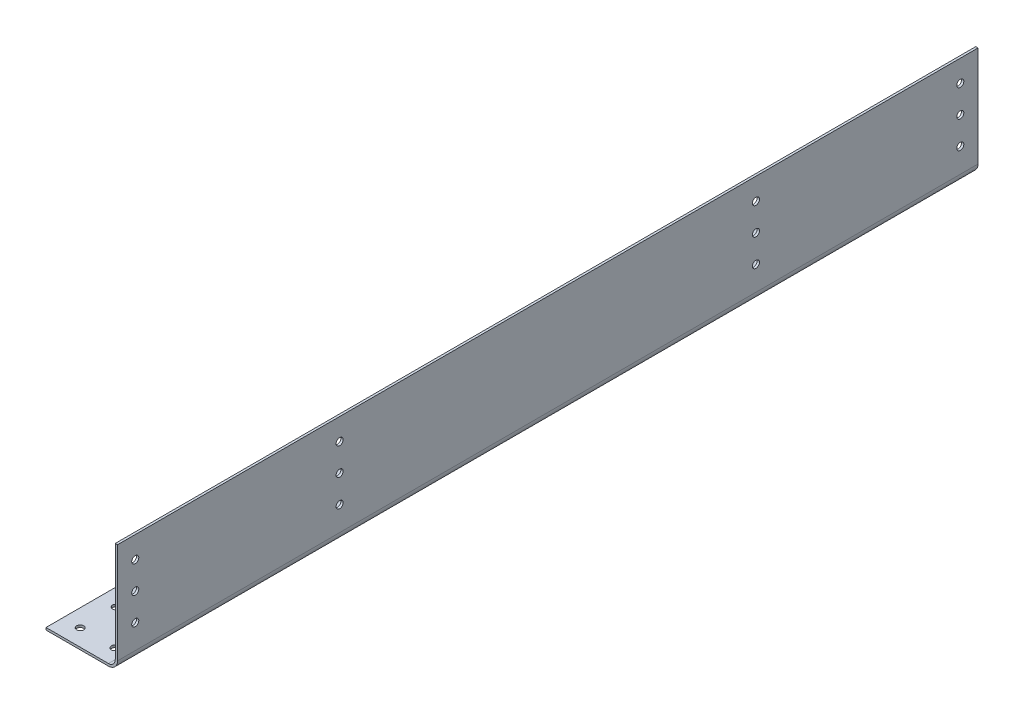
ISO-10303-21;
HEADER;
FILE_DESCRIPTION(('STEP AP214'),'2;1');
FILE_NAME('part.step','',(''),(''),'','','');
FILE_SCHEMA(('AUTOMOTIVE_DESIGN { 1 0 10303 214 1 1 1 1 }'));
ENDSEC;
DATA;
#1=APPLICATION_CONTEXT('core data for automotive mechanical design processes');
#2=APPLICATION_PROTOCOL_DEFINITION('international standard','automotive_design',2000,#1);
#3=PRODUCT_CONTEXT('',#1,'mechanical');
#4=PRODUCT('Part','Part','',(#3));
#5=PRODUCT_RELATED_PRODUCT_CATEGORY('part','',(#4));
#6=PRODUCT_DEFINITION_FORMATION('','',#4);
#7=PRODUCT_DEFINITION_CONTEXT('part definition',#1,'design');
#8=PRODUCT_DEFINITION('design','',#6,#7);
#9=PRODUCT_DEFINITION_SHAPE('','',#8);
#10=(LENGTH_UNIT() NAMED_UNIT(*) SI_UNIT(.MILLI.,.METRE.));
#11=(NAMED_UNIT(*) PLANE_ANGLE_UNIT() SI_UNIT($,.RADIAN.));
#12=(NAMED_UNIT(*) SI_UNIT($,.STERADIAN.) SOLID_ANGLE_UNIT());
#13=UNCERTAINTY_MEASURE_WITH_UNIT(LENGTH_MEASURE(1.E-05),#10,'distance_accuracy_value','');
#14=(GEOMETRIC_REPRESENTATION_CONTEXT(3) GLOBAL_UNCERTAINTY_ASSIGNED_CONTEXT((#13)) GLOBAL_UNIT_ASSIGNED_CONTEXT((#10,
#11,#12)) REPRESENTATION_CONTEXT('',''));
#15=CARTESIAN_POINT('',(0.,0.,0.));
#16=DIRECTION('',(0.,0.,1.));
#17=DIRECTION('',(1.,0.,0.));
#18=AXIS2_PLACEMENT_3D('',#15,#16,#17);
#19=CARTESIAN_POINT('',(-48.2599999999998,0.,597.69375));
#20=DIRECTION('',(1.,0.,0.));
#21=DIRECTION('',(0.,0.,-1.));
#22=AXIS2_PLACEMENT_3D('',#19,#20,#21);
#23=PLANE('',#22);
#24=DIRECTION('',(0.,-1.,0.));
#25=VECTOR('',#24,1.);
#26=CARTESIAN_POINT('',(-48.2599999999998,0.,-597.69375));
#27=LINE('',#26,#25);
#28=CARTESIAN_POINT('',(-48.2599999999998,3.175,-597.69375));
#29=VERTEX_POINT('',#28);
#30=CARTESIAN_POINT('',(-48.2599999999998,0.,-597.69375));
#31=VERTEX_POINT('',#30);
#32=EDGE_CURVE('E132',#29,#31,#27,.T.);
#33=ORIENTED_EDGE('',*,*,#32,.T.);
#34=DIRECTION('',(0.,0.,-1.));
#35=VECTOR('',#34,1.);
#36=CARTESIAN_POINT('',(-48.2599999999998,0.,597.69375));
#37=LINE('',#36,#35);
#38=CARTESIAN_POINT('',(-48.2599999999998,0.,597.69375));
#39=VERTEX_POINT('',#38);
#40=EDGE_CURVE('E11',#39,#31,#37,.T.);
#41=ORIENTED_EDGE('',*,*,#40,.F.);
#42=DIRECTION('',(0.,-1.,0.));
#43=VECTOR('',#42,1.);
#44=CARTESIAN_POINT('',(-48.2599999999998,0.,597.69375));
#45=LINE('',#44,#43);
#46=CARTESIAN_POINT('',(-48.2599999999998,3.175,597.69375));
#47=VERTEX_POINT('',#46);
#48=EDGE_CURVE('E147',#47,#39,#45,.T.);
#49=ORIENTED_EDGE('',*,*,#48,.F.);
#50=DIRECTION('',(0.,0.,-1.));
#51=VECTOR('',#50,1.);
#52=CARTESIAN_POINT('',(-48.2599999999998,3.175,597.69375));
#53=LINE('',#52,#51);
#54=EDGE_CURVE('E128',#47,#29,#53,.T.);
#55=ORIENTED_EDGE('',*,*,#54,.T.);
#56=EDGE_LOOP('',(#33,#41,#49,#55));
#57=FACE_BOUND('',#56,.T.);
#58=ADVANCED_FACE('F34',(#57),#23,.F.);
#59=CARTESIAN_POINT('',(-48.2599999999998,0.,597.69375));
#60=DIRECTION('',(0.,1.,0.));
#61=DIRECTION('',(0.,0.,1.));
#62=AXIS2_PLACEMENT_3D('',#59,#60,#61);
#63=PLANE('',#62);
#64=CARTESIAN_POINT('',(24.1299999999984,0.,74.916195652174));
#65=DIRECTION('',(0.,1.,0.));
#66=DIRECTION('',(0.,0.,1.));
#67=AXIS2_PLACEMENT_3D('',#64,#65,#66);
#68=CIRCLE('',#67,4.90219999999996);
#69=CARTESIAN_POINT('',(24.1299999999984,0.,79.818395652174));
#70=VERTEX_POINT('',#69);
#71=EDGE_CURVE('E447',#70,#70,#68,.T.);
#72=ORIENTED_EDGE('',*,*,#71,.T.);
#73=EDGE_LOOP('',(#72));
#74=FACE_BOUND('',#73,.T.);
#75=CARTESIAN_POINT('',(-24.1300000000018,0.,24.9720652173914));
#76=DIRECTION('',(0.,1.,0.));
#77=DIRECTION('',(0.,0.,1.));
#78=AXIS2_PLACEMENT_3D('',#75,#76,#77);
#79=CIRCLE('',#78,4.90219999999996);
#80=CARTESIAN_POINT('',(-24.1300000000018,0.,29.8742652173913));
#81=VERTEX_POINT('',#80);
#82=EDGE_CURVE('E444',#81,#81,#79,.T.);
#83=ORIENTED_EDGE('',*,*,#82,.T.);
#84=EDGE_LOOP('',(#83));
#85=FACE_BOUND('',#84,.T.);
#86=CARTESIAN_POINT('',(24.1299999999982,0.,24.9720652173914));
#87=DIRECTION('',(0.,1.,0.));
#88=DIRECTION('',(0.,0.,1.));
#89=AXIS2_PLACEMENT_3D('',#86,#87,#88);
#90=CIRCLE('',#89,4.90219999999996);
#91=CARTESIAN_POINT('',(24.1299999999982,0.,29.8742652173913));
#92=VERTEX_POINT('',#91);
#93=EDGE_CURVE('E441',#92,#92,#90,.T.);
#94=ORIENTED_EDGE('',*,*,#93,.T.);
#95=EDGE_LOOP('',(#94));
#96=FACE_BOUND('',#95,.T.);
#97=CARTESIAN_POINT('',(-24.1300000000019,0.,-24.9720652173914));
#98=DIRECTION('',(0.,1.,0.));
#99=DIRECTION('',(0.,0.,1.));
#100=AXIS2_PLACEMENT_3D('',#97,#98,#99);
#101=CIRCLE('',#100,4.90219999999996);
#102=CARTESIAN_POINT('',(-24.1300000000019,0.,-20.0698652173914));
#103=VERTEX_POINT('',#102);
#104=EDGE_CURVE('E438',#103,#103,#101,.T.);
#105=ORIENTED_EDGE('',*,*,#104,.T.);
#106=EDGE_LOOP('',(#105));
#107=FACE_BOUND('',#106,.T.);
#108=CARTESIAN_POINT('',(24.1299999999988,0.,174.804456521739));
#109=DIRECTION('',(0.,1.,0.));
#110=DIRECTION('',(0.,0.,1.));
#111=AXIS2_PLACEMENT_3D('',#108,#109,#110);
#112=CIRCLE('',#111,4.90219999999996);
#113=CARTESIAN_POINT('',(24.1299999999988,0.,179.706656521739));
#114=VERTEX_POINT('',#113);
#115=EDGE_CURVE('E459',#114,#114,#112,.T.);
#116=ORIENTED_EDGE('',*,*,#115,.T.);
#117=EDGE_LOOP('',(#116));
#118=FACE_BOUND('',#117,.T.);
#119=CARTESIAN_POINT('',(-24.1300000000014,0.,124.860326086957));
#120=DIRECTION('',(0.,1.,0.));
#121=DIRECTION('',(0.,0.,1.));
#122=AXIS2_PLACEMENT_3D('',#119,#120,#121);
#123=CIRCLE('',#122,4.90219999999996);
#124=CARTESIAN_POINT('',(-24.1300000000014,0.,129.762526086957));
#125=VERTEX_POINT('',#124);
#126=EDGE_CURVE('E456',#125,#125,#123,.T.);
#127=ORIENTED_EDGE('',*,*,#126,.T.);
#128=EDGE_LOOP('',(#127));
#129=FACE_BOUND('',#128,.T.);
#130=CARTESIAN_POINT('',(24.1299999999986,0.,124.860326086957));
#131=DIRECTION('',(0.,1.,0.));
#132=DIRECTION('',(0.,0.,1.));
#133=AXIS2_PLACEMENT_3D('',#130,#131,#132);
#134=CIRCLE('',#133,4.90219999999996);
#135=CARTESIAN_POINT('',(24.1299999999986,0.,129.762526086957));
#136=VERTEX_POINT('',#135);
#137=EDGE_CURVE('E453',#136,#136,#134,.T.);
#138=ORIENTED_EDGE('',*,*,#137,.T.);
#139=EDGE_LOOP('',(#138));
#140=FACE_BOUND('',#139,.T.);
#141=CARTESIAN_POINT('',(-24.1300000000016,0.,74.916195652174));
#142=DIRECTION('',(0.,1.,0.));
#143=DIRECTION('',(0.,0.,1.));
#144=AXIS2_PLACEMENT_3D('',#141,#142,#143);
#145=CIRCLE('',#144,4.90219999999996);
#146=CARTESIAN_POINT('',(-24.1300000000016,0.,79.818395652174));
#147=VERTEX_POINT('',#146);
#148=EDGE_CURVE('E450',#147,#147,#145,.T.);
#149=ORIENTED_EDGE('',*,*,#148,.T.);
#150=EDGE_LOOP('',(#149));
#151=FACE_BOUND('',#150,.T.);
#152=CARTESIAN_POINT('',(24.1299999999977,0.,-124.860326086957));
#153=DIRECTION('',(0.,1.,0.));
#154=DIRECTION('',(0.,0.,1.));
#155=AXIS2_PLACEMENT_3D('',#152,#153,#154);
#156=CIRCLE('',#155,4.90219999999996);
#157=CARTESIAN_POINT('',(24.1299999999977,0.,-119.958126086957));
#158=VERTEX_POINT('',#157);
#159=EDGE_CURVE('E423',#158,#158,#156,.T.);
#160=ORIENTED_EDGE('',*,*,#159,.T.);
#161=EDGE_LOOP('',(#160));
#162=FACE_BOUND('',#161,.T.);
#163=CARTESIAN_POINT('',(-24.1300000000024,0.,-174.804456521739));
#164=DIRECTION('',(0.,1.,0.));
#165=DIRECTION('',(0.,0.,1.));
#166=AXIS2_PLACEMENT_3D('',#163,#164,#165);
#167=CIRCLE('',#166,4.90219999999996);
#168=CARTESIAN_POINT('',(-24.1300000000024,0.,-169.902256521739));
#169=VERTEX_POINT('',#168);
#170=EDGE_CURVE('E420',#169,#169,#167,.T.);
#171=ORIENTED_EDGE('',*,*,#170,.T.);
#172=EDGE_LOOP('',(#171));
#173=FACE_BOUND('',#172,.T.);
#174=CARTESIAN_POINT('',(24.1299999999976,0.,-174.804456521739));
#175=DIRECTION('',(0.,1.,0.));
#176=DIRECTION('',(0.,0.,1.));
#177=AXIS2_PLACEMENT_3D('',#174,#175,#176);
#178=CIRCLE('',#177,4.90219999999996);
#179=CARTESIAN_POINT('',(24.1299999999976,0.,-169.902256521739));
#180=VERTEX_POINT('',#179);
#181=EDGE_CURVE('E417',#180,#180,#178,.T.);
#182=ORIENTED_EDGE('',*,*,#181,.T.);
#183=EDGE_LOOP('',(#182));
#184=FACE_BOUND('',#183,.T.);
#185=CARTESIAN_POINT('',(-24.1300000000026,0.,-224.748586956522));
#186=DIRECTION('',(0.,1.,0.));
#187=DIRECTION('',(0.,0.,1.));
#188=AXIS2_PLACEMENT_3D('',#185,#186,#187);
#189=CIRCLE('',#188,4.90219999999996);
#190=CARTESIAN_POINT('',(-24.1300000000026,0.,-219.846386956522));
#191=VERTEX_POINT('',#190);
#192=EDGE_CURVE('E414',#191,#191,#189,.T.);
#193=ORIENTED_EDGE('',*,*,#192,.T.);
#194=EDGE_LOOP('',(#193));
#195=FACE_BOUND('',#194,.T.);
#196=CARTESIAN_POINT('',(24.1299999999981,0.,-24.9720652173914));
#197=DIRECTION('',(0.,1.,0.));
#198=DIRECTION('',(0.,0.,1.));
#199=AXIS2_PLACEMENT_3D('',#196,#197,#198);
#200=CIRCLE('',#199,4.90219999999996);
#201=CARTESIAN_POINT('',(24.1299999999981,0.,-20.0698652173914));
#202=VERTEX_POINT('',#201);
#203=EDGE_CURVE('E435',#202,#202,#200,.T.);
#204=ORIENTED_EDGE('',*,*,#203,.T.);
#205=EDGE_LOOP('',(#204));
#206=FACE_BOUND('',#205,.T.);
#207=CARTESIAN_POINT('',(-24.1300000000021,0.,-74.9161956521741));
#208=DIRECTION('',(0.,1.,0.));
#209=DIRECTION('',(0.,0.,1.));
#210=AXIS2_PLACEMENT_3D('',#207,#208,#209);
#211=CIRCLE('',#210,4.90219999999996);
#212=CARTESIAN_POINT('',(-24.1300000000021,0.,-70.0139956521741));
#213=VERTEX_POINT('',#212);
#214=EDGE_CURVE('E432',#213,#213,#211,.T.);
#215=ORIENTED_EDGE('',*,*,#214,.T.);
#216=EDGE_LOOP('',(#215));
#217=FACE_BOUND('',#216,.T.);
#218=CARTESIAN_POINT('',(24.1299999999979,0.,-74.9161956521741));
#219=DIRECTION('',(0.,1.,0.));
#220=DIRECTION('',(0.,0.,1.));
#221=AXIS2_PLACEMENT_3D('',#218,#219,#220);
#222=CIRCLE('',#221,4.90219999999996);
#223=CARTESIAN_POINT('',(24.1299999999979,0.,-70.0139956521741));
#224=VERTEX_POINT('',#223);
#225=EDGE_CURVE('E429',#224,#224,#222,.T.);
#226=ORIENTED_EDGE('',*,*,#225,.T.);
#227=EDGE_LOOP('',(#226));
#228=FACE_BOUND('',#227,.T.);
#229=CARTESIAN_POINT('',(-24.1300000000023,0.,-124.860326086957));
#230=DIRECTION('',(0.,1.,0.));
#231=DIRECTION('',(0.,0.,1.));
#232=AXIS2_PLACEMENT_3D('',#229,#230,#231);
#233=CIRCLE('',#232,4.90219999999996);
#234=CARTESIAN_POINT('',(-24.1300000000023,0.,-119.958126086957));
#235=VERTEX_POINT('',#234);
#236=EDGE_CURVE('E426',#235,#235,#233,.T.);
#237=ORIENTED_EDGE('',*,*,#236,.T.);
#238=EDGE_LOOP('',(#237));
#239=FACE_BOUND('',#238,.T.);
#240=CARTESIAN_POINT('',(24.1299999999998,0.,474.469239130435));
#241=DIRECTION('',(0.,1.,0.));
#242=DIRECTION('',(0.,0.,1.));
#243=AXIS2_PLACEMENT_3D('',#240,#241,#242);
#244=CIRCLE('',#243,4.90219999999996);
#245=CARTESIAN_POINT('',(24.1299999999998,0.,479.371439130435));
#246=VERTEX_POINT('',#245);
#247=EDGE_CURVE('E495',#246,#246,#244,.T.);
#248=ORIENTED_EDGE('',*,*,#247,.T.);
#249=EDGE_LOOP('',(#248));
#250=FACE_BOUND('',#249,.T.);
#251=CARTESIAN_POINT('',(-24.1300000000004,0.,424.525108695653));
#252=DIRECTION('',(0.,1.,0.));
#253=DIRECTION('',(0.,0.,1.));
#254=AXIS2_PLACEMENT_3D('',#251,#252,#253);
#255=CIRCLE('',#254,4.90219999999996);
#256=CARTESIAN_POINT('',(-24.1300000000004,0.,429.427308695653));
#257=VERTEX_POINT('',#256);
#258=EDGE_CURVE('E492',#257,#257,#255,.T.);
#259=ORIENTED_EDGE('',*,*,#258,.T.);
#260=EDGE_LOOP('',(#259));
#261=FACE_BOUND('',#260,.T.);
#262=CARTESIAN_POINT('',(24.1299999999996,0.,424.525108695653));
#263=DIRECTION('',(0.,1.,0.));
#264=DIRECTION('',(0.,0.,1.));
#265=AXIS2_PLACEMENT_3D('',#262,#263,#264);
#266=CIRCLE('',#265,4.90219999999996);
#267=CARTESIAN_POINT('',(24.1299999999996,0.,429.427308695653));
#268=VERTEX_POINT('',#267);
#269=EDGE_CURVE('E489',#268,#268,#266,.T.);
#270=ORIENTED_EDGE('',*,*,#269,.T.);
#271=EDGE_LOOP('',(#270));
#272=FACE_BOUND('',#271,.T.);
#273=CARTESIAN_POINT('',(-24.1300000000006,0.,374.58097826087));
#274=DIRECTION('',(0.,1.,0.));
#275=DIRECTION('',(0.,0.,1.));
#276=AXIS2_PLACEMENT_3D('',#273,#274,#275);
#277=CIRCLE('',#276,4.90219999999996);
#278=CARTESIAN_POINT('',(-24.1300000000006,0.,379.48317826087));
#279=VERTEX_POINT('',#278);
#280=EDGE_CURVE('E486',#279,#279,#277,.T.);
#281=ORIENTED_EDGE('',*,*,#280,.T.);
#282=EDGE_LOOP('',(#281));
#283=FACE_BOUND('',#282,.T.);
#284=CARTESIAN_POINT('',(24.1300000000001,0.,574.357500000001));
#285=DIRECTION('',(0.,1.,0.));
#286=DIRECTION('',(0.,0.,1.));
#287=AXIS2_PLACEMENT_3D('',#284,#285,#286);
#288=CIRCLE('',#287,4.90219999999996);
#289=CARTESIAN_POINT('',(24.1300000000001,0.,579.259700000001));
#290=VERTEX_POINT('',#289);
#291=EDGE_CURVE('E507',#290,#290,#288,.T.);
#292=ORIENTED_EDGE('',*,*,#291,.T.);
#293=EDGE_LOOP('',(#292));
#294=FACE_BOUND('',#293,.T.);
#295=CARTESIAN_POINT('',(-24.13,0.,524.413369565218));
#296=DIRECTION('',(0.,1.,0.));
#297=DIRECTION('',(0.,0.,1.));
#298=AXIS2_PLACEMENT_3D('',#295,#296,#297);
#299=CIRCLE('',#298,4.90219999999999);
#300=CARTESIAN_POINT('',(-24.13,0.,529.315569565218));
#301=VERTEX_POINT('',#300);
#302=EDGE_CURVE('E504',#301,#301,#299,.T.);
#303=ORIENTED_EDGE('',*,*,#302,.T.);
#304=EDGE_LOOP('',(#303));
#305=FACE_BOUND('',#304,.T.);
#306=CARTESIAN_POINT('',(24.13,0.,524.413369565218));
#307=DIRECTION('',(0.,1.,0.));
#308=DIRECTION('',(0.,0.,1.));
#309=AXIS2_PLACEMENT_3D('',#306,#307,#308);
#310=CIRCLE('',#309,4.90219999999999);
#311=CARTESIAN_POINT('',(24.13,0.,529.315569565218));
#312=VERTEX_POINT('',#311);
#313=EDGE_CURVE('E501',#312,#312,#310,.T.);
#314=ORIENTED_EDGE('',*,*,#313,.T.);
#315=EDGE_LOOP('',(#314));
#316=FACE_BOUND('',#315,.T.);
#317=CARTESIAN_POINT('',(-24.1300000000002,0.,474.469239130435));
#318=DIRECTION('',(0.,1.,0.));
#319=DIRECTION('',(0.,0.,1.));
#320=AXIS2_PLACEMENT_3D('',#317,#318,#319);
#321=CIRCLE('',#320,4.90219999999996);
#322=CARTESIAN_POINT('',(-24.1300000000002,0.,479.371439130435));
#323=VERTEX_POINT('',#322);
#324=EDGE_CURVE('E498',#323,#323,#321,.T.);
#325=ORIENTED_EDGE('',*,*,#324,.T.);
#326=EDGE_LOOP('',(#325));
#327=FACE_BOUND('',#326,.T.);
#328=CARTESIAN_POINT('',(24.1299999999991,0.,274.692717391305));
#329=DIRECTION('',(0.,1.,0.));
#330=DIRECTION('',(0.,0.,1.));
#331=AXIS2_PLACEMENT_3D('',#328,#329,#330);
#332=CIRCLE('',#331,4.90219999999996);
#333=CARTESIAN_POINT('',(24.1299999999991,0.,279.594917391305));
#334=VERTEX_POINT('',#333);
#335=EDGE_CURVE('E471',#334,#334,#332,.T.);
#336=ORIENTED_EDGE('',*,*,#335,.T.);
#337=EDGE_LOOP('',(#336));
#338=FACE_BOUND('',#337,.T.);
#339=CARTESIAN_POINT('',(-24.1300000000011,0.,224.748586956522));
#340=DIRECTION('',(0.,1.,0.));
#341=DIRECTION('',(0.,0.,1.));
#342=AXIS2_PLACEMENT_3D('',#339,#340,#341);
#343=CIRCLE('',#342,4.90219999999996);
#344=CARTESIAN_POINT('',(-24.1300000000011,0.,229.650786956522));
#345=VERTEX_POINT('',#344);
#346=EDGE_CURVE('E468',#345,#345,#343,.T.);
#347=ORIENTED_EDGE('',*,*,#346,.T.);
#348=EDGE_LOOP('',(#347));
#349=FACE_BOUND('',#348,.T.);
#350=CARTESIAN_POINT('',(24.1299999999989,0.,224.748586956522));
#351=DIRECTION('',(0.,1.,0.));
#352=DIRECTION('',(0.,0.,1.));
#353=AXIS2_PLACEMENT_3D('',#350,#351,#352);
#354=CIRCLE('',#353,4.90219999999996);
#355=CARTESIAN_POINT('',(24.1299999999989,0.,229.650786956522));
#356=VERTEX_POINT('',#355);
#357=EDGE_CURVE('E465',#356,#356,#354,.T.);
#358=ORIENTED_EDGE('',*,*,#357,.T.);
#359=EDGE_LOOP('',(#358));
#360=FACE_BOUND('',#359,.T.);
#361=CARTESIAN_POINT('',(-24.1300000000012,0.,174.804456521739));
#362=DIRECTION('',(0.,1.,0.));
#363=DIRECTION('',(0.,0.,1.));
#364=AXIS2_PLACEMENT_3D('',#361,#362,#363);
#365=CIRCLE('',#364,4.90219999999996);
#366=CARTESIAN_POINT('',(-24.1300000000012,0.,179.706656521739));
#367=VERTEX_POINT('',#366);
#368=EDGE_CURVE('E462',#367,#367,#365,.T.);
#369=ORIENTED_EDGE('',*,*,#368,.T.);
#370=EDGE_LOOP('',(#369));
#371=FACE_BOUND('',#370,.T.);
#372=CARTESIAN_POINT('',(24.1299999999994,0.,374.58097826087));
#373=DIRECTION('',(0.,1.,0.));
#374=DIRECTION('',(0.,0.,1.));
#375=AXIS2_PLACEMENT_3D('',#372,#373,#374);
#376=CIRCLE('',#375,4.90219999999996);
#377=CARTESIAN_POINT('',(24.1299999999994,0.,379.48317826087));
#378=VERTEX_POINT('',#377);
#379=EDGE_CURVE('E483',#378,#378,#376,.T.);
#380=ORIENTED_EDGE('',*,*,#379,.T.);
#381=EDGE_LOOP('',(#380));
#382=FACE_BOUND('',#381,.T.);
#383=CARTESIAN_POINT('',(-24.1300000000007,0.,324.636847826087));
#384=DIRECTION('',(0.,1.,0.));
#385=DIRECTION('',(0.,0.,1.));
#386=AXIS2_PLACEMENT_3D('',#383,#384,#385);
#387=CIRCLE('',#386,4.90219999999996);
#388=CARTESIAN_POINT('',(-24.1300000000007,0.,329.539047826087));
#389=VERTEX_POINT('',#388);
#390=EDGE_CURVE('E480',#389,#389,#387,.T.);
#391=ORIENTED_EDGE('',*,*,#390,.T.);
#392=EDGE_LOOP('',(#391));
#393=FACE_BOUND('',#392,.T.);
#394=CARTESIAN_POINT('',(24.1299999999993,0.,324.636847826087));
#395=DIRECTION('',(0.,1.,0.));
#396=DIRECTION('',(0.,0.,1.));
#397=AXIS2_PLACEMENT_3D('',#394,#395,#396);
#398=CIRCLE('',#397,4.90219999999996);
#399=CARTESIAN_POINT('',(24.1299999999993,0.,329.539047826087));
#400=VERTEX_POINT('',#399);
#401=EDGE_CURVE('E477',#400,#400,#398,.T.);
#402=ORIENTED_EDGE('',*,*,#401,.T.);
#403=EDGE_LOOP('',(#402));
#404=FACE_BOUND('',#403,.T.);
#405=CARTESIAN_POINT('',(-24.1300000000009,0.,274.692717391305));
#406=DIRECTION('',(0.,1.,0.));
#407=DIRECTION('',(0.,0.,1.));
#408=AXIS2_PLACEMENT_3D('',#405,#406,#407);
#409=CIRCLE('',#408,4.90219999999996);
#410=CARTESIAN_POINT('',(-24.1300000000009,0.,279.594917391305));
#411=VERTEX_POINT('',#410);
#412=EDGE_CURVE('E474',#411,#411,#409,.T.);
#413=ORIENTED_EDGE('',*,*,#412,.T.);
#414=EDGE_LOOP('',(#413));
#415=FACE_BOUND('',#414,.T.);
#416=CARTESIAN_POINT('',(-24.1300000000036,0.,-524.413369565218));
#417=DIRECTION('',(0.,1.,0.));
#418=DIRECTION('',(0.,0.,1.));
#419=AXIS2_PLACEMENT_3D('',#416,#417,#418);
#420=CIRCLE('',#419,4.90219999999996);
#421=CARTESIAN_POINT('',(-24.1300000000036,0.,-519.511169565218));
#422=VERTEX_POINT('',#421);
#423=EDGE_CURVE('E378',#422,#422,#420,.T.);
#424=ORIENTED_EDGE('',*,*,#423,.T.);
#425=EDGE_LOOP('',(#424));
#426=FACE_BOUND('',#425,.T.);
#427=CARTESIAN_POINT('',(24.1299999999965,0.,-474.469239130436));
#428=DIRECTION('',(0.,1.,0.));
#429=DIRECTION('',(0.,0.,1.));
#430=AXIS2_PLACEMENT_3D('',#427,#428,#429);
#431=CIRCLE('',#430,4.90219999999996);
#432=CARTESIAN_POINT('',(24.1299999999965,0.,-469.567039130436));
#433=VERTEX_POINT('',#432);
#434=EDGE_CURVE('E381',#433,#433,#431,.T.);
#435=ORIENTED_EDGE('',*,*,#434,.T.);
#436=EDGE_LOOP('',(#435));
#437=FACE_BOUND('',#436,.T.);
#438=CARTESIAN_POINT('',(-24.1300000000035,0.,-474.469239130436));
#439=DIRECTION('',(0.,1.,0.));
#440=DIRECTION('',(0.,0.,1.));
#441=AXIS2_PLACEMENT_3D('',#438,#439,#440);
#442=CIRCLE('',#441,4.90219999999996);
#443=CARTESIAN_POINT('',(-24.1300000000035,0.,-469.567039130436));
#444=VERTEX_POINT('',#443);
#445=EDGE_CURVE('E384',#444,#444,#442,.T.);
#446=ORIENTED_EDGE('',*,*,#445,.T.);
#447=EDGE_LOOP('',(#446));
#448=FACE_BOUND('',#447,.T.);
#449=CARTESIAN_POINT('',(24.1299999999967,0.,-424.525108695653));
#450=DIRECTION('',(0.,1.,0.));
#451=DIRECTION('',(0.,0.,1.));
#452=AXIS2_PLACEMENT_3D('',#449,#450,#451);
#453=CIRCLE('',#452,4.90219999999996);
#454=CARTESIAN_POINT('',(24.1299999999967,0.,-419.622908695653));
#455=VERTEX_POINT('',#454);
#456=EDGE_CURVE('E387',#455,#455,#453,.T.);
#457=ORIENTED_EDGE('',*,*,#456,.T.);
#458=EDGE_LOOP('',(#457));
#459=FACE_BOUND('',#458,.T.);
#460=CARTESIAN_POINT('',(24.1299999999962,0.,-574.357500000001));
#461=DIRECTION('',(0.,1.,0.));
#462=DIRECTION('',(0.,0.,1.));
#463=AXIS2_PLACEMENT_3D('',#460,#461,#462);
#464=CIRCLE('',#463,4.90219999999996);
#465=CARTESIAN_POINT('',(24.1299999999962,0.,-569.455300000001));
#466=VERTEX_POINT('',#465);
#467=EDGE_CURVE('E371',#466,#466,#464,.T.);
#468=ORIENTED_EDGE('',*,*,#467,.T.);
#469=EDGE_LOOP('',(#468));
#470=FACE_BOUND('',#469,.T.);
#471=CARTESIAN_POINT('',(-24.1300000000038,0.,-574.357500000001));
#472=DIRECTION('',(0.,1.,0.));
#473=DIRECTION('',(0.,0.,1.));
#474=AXIS2_PLACEMENT_3D('',#471,#472,#473);
#475=CIRCLE('',#474,4.90219999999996);
#476=CARTESIAN_POINT('',(-24.1300000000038,0.,-569.455300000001));
#477=VERTEX_POINT('',#476);
#478=EDGE_CURVE('E374',#477,#477,#475,.T.);
#479=ORIENTED_EDGE('',*,*,#478,.T.);
#480=EDGE_LOOP('',(#479));
#481=FACE_BOUND('',#480,.T.);
#482=CARTESIAN_POINT('',(24.1299999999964,0.,-524.413369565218));
#483=DIRECTION('',(0.,1.,0.));
#484=DIRECTION('',(0.,0.,1.));
#485=AXIS2_PLACEMENT_3D('',#482,#483,#484);
#486=CIRCLE('',#485,4.90219999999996);
#487=CARTESIAN_POINT('',(24.1299999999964,0.,-519.511169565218));
#488=VERTEX_POINT('',#487);
#489=EDGE_CURVE('E375',#488,#488,#486,.T.);
#490=ORIENTED_EDGE('',*,*,#489,.T.);
#491=EDGE_LOOP('',(#490));
#492=FACE_BOUND('',#491,.T.);
#493=CARTESIAN_POINT('',(-24.130000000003,0.,-324.636847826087));
#494=DIRECTION('',(0.,1.,0.));
#495=DIRECTION('',(0.,0.,1.));
#496=AXIS2_PLACEMENT_3D('',#493,#494,#495);
#497=CIRCLE('',#496,4.90219999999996);
#498=CARTESIAN_POINT('',(-24.130000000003,0.,-319.734647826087));
#499=VERTEX_POINT('',#498);
#500=EDGE_CURVE('E402',#499,#499,#497,.T.);
#501=ORIENTED_EDGE('',*,*,#500,.T.);
#502=EDGE_LOOP('',(#501));
#503=FACE_BOUND('',#502,.T.);
#504=CARTESIAN_POINT('',(24.1299999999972,0.,-274.692717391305));
#505=DIRECTION('',(0.,1.,0.));
#506=DIRECTION('',(0.,0.,1.));
#507=AXIS2_PLACEMENT_3D('',#504,#505,#506);
#508=CIRCLE('',#507,4.90219999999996);
#509=CARTESIAN_POINT('',(24.1299999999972,0.,-269.790517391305));
#510=VERTEX_POINT('',#509);
#511=EDGE_CURVE('E405',#510,#510,#508,.T.);
#512=ORIENTED_EDGE('',*,*,#511,.T.);
#513=EDGE_LOOP('',(#512));
#514=FACE_BOUND('',#513,.T.);
#515=CARTESIAN_POINT('',(-24.1300000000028,0.,-274.692717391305));
#516=DIRECTION('',(0.,1.,0.));
#517=DIRECTION('',(0.,0.,1.));
#518=AXIS2_PLACEMENT_3D('',#515,#516,#517);
#519=CIRCLE('',#518,4.90219999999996);
#520=CARTESIAN_POINT('',(-24.1300000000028,0.,-269.790517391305));
#521=VERTEX_POINT('',#520);
#522=EDGE_CURVE('E408',#521,#521,#519,.T.);
#523=ORIENTED_EDGE('',*,*,#522,.T.);
#524=EDGE_LOOP('',(#523));
#525=FACE_BOUND('',#524,.T.);
#526=CARTESIAN_POINT('',(24.1299999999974,0.,-224.748586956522));
#527=DIRECTION('',(0.,1.,0.));
#528=DIRECTION('',(0.,0.,1.));
#529=AXIS2_PLACEMENT_3D('',#526,#527,#528);
#530=CIRCLE('',#529,4.90219999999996);
#531=CARTESIAN_POINT('',(24.1299999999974,0.,-219.846386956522));
#532=VERTEX_POINT('',#531);
#533=EDGE_CURVE('E411',#532,#532,#530,.T.);
#534=ORIENTED_EDGE('',*,*,#533,.T.);
#535=EDGE_LOOP('',(#534));
#536=FACE_BOUND('',#535,.T.);
#537=CARTESIAN_POINT('',(-24.1300000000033,0.,-424.525108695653));
#538=DIRECTION('',(0.,1.,0.));
#539=DIRECTION('',(0.,0.,1.));
#540=AXIS2_PLACEMENT_3D('',#537,#538,#539);
#541=CIRCLE('',#540,4.90219999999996);
#542=CARTESIAN_POINT('',(-24.1300000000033,0.,-419.622908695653));
#543=VERTEX_POINT('',#542);
#544=EDGE_CURVE('E390',#543,#543,#541,.T.);
#545=ORIENTED_EDGE('',*,*,#544,.T.);
#546=EDGE_LOOP('',(#545));
#547=FACE_BOUND('',#546,.T.);
#548=CARTESIAN_POINT('',(24.1299999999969,0.,-374.58097826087));
#549=DIRECTION('',(0.,1.,0.));
#550=DIRECTION('',(0.,0.,1.));
#551=AXIS2_PLACEMENT_3D('',#548,#549,#550);
#552=CIRCLE('',#551,4.90219999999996);
#553=CARTESIAN_POINT('',(24.1299999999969,0.,-369.67877826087));
#554=VERTEX_POINT('',#553);
#555=EDGE_CURVE('E393',#554,#554,#552,.T.);
#556=ORIENTED_EDGE('',*,*,#555,.T.);
#557=EDGE_LOOP('',(#556));
#558=FACE_BOUND('',#557,.T.);
#559=CARTESIAN_POINT('',(-24.1300000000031,0.,-374.58097826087));
#560=DIRECTION('',(0.,1.,0.));
#561=DIRECTION('',(0.,0.,1.));
#562=AXIS2_PLACEMENT_3D('',#559,#560,#561);
#563=CIRCLE('',#562,4.90219999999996);
#564=CARTESIAN_POINT('',(-24.1300000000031,0.,-369.67877826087));
#565=VERTEX_POINT('',#564);
#566=EDGE_CURVE('E396',#565,#565,#563,.T.);
#567=ORIENTED_EDGE('',*,*,#566,.T.);
#568=EDGE_LOOP('',(#567));
#569=FACE_BOUND('',#568,.T.);
#570=CARTESIAN_POINT('',(24.129999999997,0.,-324.636847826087));
#571=DIRECTION('',(0.,1.,0.));
#572=DIRECTION('',(0.,0.,1.));
#573=AXIS2_PLACEMENT_3D('',#570,#571,#572);
#574=CIRCLE('',#573,4.90219999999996);
#575=CARTESIAN_POINT('',(24.129999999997,0.,-319.734647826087));
#576=VERTEX_POINT('',#575);
#577=EDGE_CURVE('E399',#576,#576,#574,.T.);
#578=ORIENTED_EDGE('',*,*,#577,.T.);
#579=EDGE_LOOP('',(#578));
#580=FACE_BOUND('',#579,.T.);
#581=CARTESIAN_POINT('',(-24.1299999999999,0.,574.357500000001));
#582=DIRECTION('',(0.,1.,0.));
#583=DIRECTION('',(0.,0.,1.));
#584=AXIS2_PLACEMENT_3D('',#581,#582,#583);
#585=CIRCLE('',#584,4.90219999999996);
#586=CARTESIAN_POINT('',(-24.1299999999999,0.,579.259700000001));
#587=VERTEX_POINT('',#586);
#588=EDGE_CURVE('E163',#587,#587,#585,.T.);
#589=ORIENTED_EDGE('',*,*,#588,.T.);
#590=EDGE_LOOP('',(#589));
#591=FACE_BOUND('',#590,.T.);
#592=DIRECTION('',(1.,0.,0.));
#593=VECTOR('',#592,1.);
#594=CARTESIAN_POINT('',(-48.2599999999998,0.,-597.69375));
#595=LINE('',#594,#593);
#596=CARTESIAN_POINT('',(38.4302000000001,0.,-597.69375));
#597=VERTEX_POINT('',#596);
#598=EDGE_CURVE('E135',#31,#597,#595,.T.);
#599=ORIENTED_EDGE('',*,*,#598,.T.);
#600=DIRECTION('',(0.,0.,-1.));
#601=VECTOR('',#600,1.);
#602=CARTESIAN_POINT('',(38.4302000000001,0.,597.69375));
#603=LINE('',#602,#601);
#604=CARTESIAN_POINT('',(38.4302000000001,0.,597.69375));
#605=VERTEX_POINT('',#604);
#606=EDGE_CURVE('E43',#605,#597,#603,.T.);
#607=ORIENTED_EDGE('',*,*,#606,.F.);
#608=DIRECTION('',(1.,0.,0.));
#609=VECTOR('',#608,1.);
#610=CARTESIAN_POINT('',(-48.2599999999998,0.,597.69375));
#611=LINE('',#610,#609);
#612=EDGE_CURVE('E95',#39,#605,#611,.T.);
#613=ORIENTED_EDGE('',*,*,#612,.F.);
#614=ORIENTED_EDGE('',*,*,#40,.T.);
#615=EDGE_LOOP('',(#599,#607,#613,#614));
#616=FACE_BOUND('',#615,.T.);
#617=ADVANCED_FACE('F550',(#74,#85,#96,#107,#118,#129,#140,#151,#162,#173,#184,#195,#206,#217,
#228,#239,#250,#261,#272,#283,#294,#305,#316,#327,#338,#349,#360,#371,#382,#393,#404,#415,#426,
#437,#448,#459,#470,#481,#492,#503,#514,#525,#536,#547,#558,#569,#580,#591,#616),#63,.F.);
#618=CARTESIAN_POINT('',(38.4302000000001,12.7,597.69375));
#619=DIRECTION('',(0.,0.,-1.));
#620=DIRECTION('',(-1.,0.,0.));
#621=AXIS2_PLACEMENT_3D('',#618,#619,#620);
#622=CYLINDRICAL_SURFACE('',#621,12.7);
#623=CARTESIAN_POINT('',(38.4302000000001,12.7,-597.69375));
#624=DIRECTION('',(0.,0.,1.));
#625=DIRECTION('',(1.,0.,0.));
#626=AXIS2_PLACEMENT_3D('',#623,#624,#625);
#627=CIRCLE('',#626,12.7);
#628=CARTESIAN_POINT('',(51.1302000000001,12.7,-597.69375));
#629=VERTEX_POINT('',#628);
#630=EDGE_CURVE('E138',#597,#629,#627,.T.);
#631=ORIENTED_EDGE('',*,*,#630,.T.);
#632=DIRECTION('',(0.,0.,-1.));
#633=VECTOR('',#632,1.);
#634=CARTESIAN_POINT('',(51.1302000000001,12.7,597.69375));
#635=LINE('',#634,#633);
#636=CARTESIAN_POINT('',(51.1302000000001,12.7,597.69375));
#637=VERTEX_POINT('',#636);
#638=EDGE_CURVE('E154',#637,#629,#635,.T.);
#639=ORIENTED_EDGE('',*,*,#638,.F.);
#640=CARTESIAN_POINT('',(38.4302000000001,12.7,597.69375));
#641=DIRECTION('',(0.,0.,1.));
#642=DIRECTION('',(1.,0.,0.));
#643=AXIS2_PLACEMENT_3D('',#640,#641,#642);
#644=CIRCLE('',#643,12.7);
#645=EDGE_CURVE('E516',#605,#637,#644,.T.);
#646=ORIENTED_EDGE('',*,*,#645,.F.);
#647=ORIENTED_EDGE('',*,*,#606,.T.);
#648=EDGE_LOOP('',(#631,#639,#646,#647));
#649=FACE_BOUND('',#648,.T.);
#650=ADVANCED_FACE('F554',(#649),#622,.T.);
#651=CARTESIAN_POINT('',(51.1302000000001,12.7,597.69375));
#652=DIRECTION('',(-1.,0.,0.));
#653=DIRECTION('',(0.,0.,1.));
#654=AXIS2_PLACEMENT_3D('',#651,#652,#653);
#655=PLANE('',#654);
#656=CARTESIAN_POINT('',(51.1302000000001,84.2544736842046,289.199113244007));
#657=DIRECTION('',(-1.,0.,0.));
#658=DIRECTION('',(0.,0.,1.));
#659=AXIS2_PLACEMENT_3D('',#656,#657,#658);
#660=CIRCLE('',#659,4.9022);
#661=CARTESIAN_POINT('',(51.1302000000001,84.2544736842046,294.101313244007));
#662=VERTEX_POINT('',#661);
#663=EDGE_CURVE('E307',#662,#662,#660,.F.);
#664=ORIENTED_EDGE('',*,*,#663,.F.);
#665=EDGE_LOOP('',(#664));
#666=FACE_BOUND('',#665,.T.);
#667=CARTESIAN_POINT('',(51.1302000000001,122.153947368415,289.199113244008));
#668=DIRECTION('',(-1.,0.,0.));
#669=DIRECTION('',(0.,0.,1.));
#670=AXIS2_PLACEMENT_3D('',#667,#668,#669);
#671=CIRCLE('',#670,4.9022);
#672=CARTESIAN_POINT('',(51.1302000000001,122.153947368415,294.101313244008));
#673=VERTEX_POINT('',#672);
#674=EDGE_CURVE('E345',#673,#673,#671,.F.);
#675=ORIENTED_EDGE('',*,*,#674,.F.);
#676=EDGE_LOOP('',(#675));
#677=FACE_BOUND('',#676,.T.);
#678=CARTESIAN_POINT('',(51.1302000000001,46.355,-289.199113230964));
#679=DIRECTION('',(-1.,0.,0.));
#680=DIRECTION('',(0.,0.,1.));
#681=AXIS2_PLACEMENT_3D('',#678,#679,#680);
#682=CIRCLE('',#681,4.9022);
#683=CARTESIAN_POINT('',(51.1302000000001,46.355,-284.296913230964));
#684=VERTEX_POINT('',#683);
#685=EDGE_CURVE('E342',#684,#684,#682,.F.);
#686=ORIENTED_EDGE('',*,*,#685,.F.);
#687=EDGE_LOOP('',(#686));
#688=FACE_BOUND('',#687,.T.);
#689=CARTESIAN_POINT('',(51.1302000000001,84.2544736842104,-289.199113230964));
#690=DIRECTION('',(-1.,0.,0.));
#691=DIRECTION('',(0.,0.,1.));
#692=AXIS2_PLACEMENT_3D('',#689,#690,#691);
#693=CIRCLE('',#692,4.9022);
#694=CARTESIAN_POINT('',(51.1302000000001,84.2544736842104,-284.296913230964));
#695=VERTEX_POINT('',#694);
#696=EDGE_CURVE('E339',#695,#695,#693,.F.);
#697=ORIENTED_EDGE('',*,*,#696,.F.);
#698=EDGE_LOOP('',(#697));
#699=FACE_BOUND('',#698,.T.);
#700=CARTESIAN_POINT('',(51.1302000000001,122.153947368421,-289.199113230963));
#701=DIRECTION('',(-1.,0.,0.));
#702=DIRECTION('',(0.,0.,1.));
#703=AXIS2_PLACEMENT_3D('',#700,#701,#702);
#704=CIRCLE('',#703,4.9022);
#705=CARTESIAN_POINT('',(51.1302000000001,122.153947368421,-284.296913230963));
#706=VERTEX_POINT('',#705);
#707=EDGE_CURVE('E335',#706,#706,#704,.F.);
#708=ORIENTED_EDGE('',*,*,#707,.F.);
#709=EDGE_LOOP('',(#708));
#710=FACE_BOUND('',#709,.T.);
#711=CARTESIAN_POINT('',(51.1302000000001,46.3549999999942,289.199113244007));
#712=DIRECTION('',(-1.,0.,0.));
#713=DIRECTION('',(0.,0.,1.));
#714=AXIS2_PLACEMENT_3D('',#711,#712,#713);
#715=CIRCLE('',#714,4.9022);
#716=CARTESIAN_POINT('',(51.1302000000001,46.3549999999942,294.101313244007));
#717=VERTEX_POINT('',#716);
#718=EDGE_CURVE('E331',#717,#717,#715,.F.);
#719=ORIENTED_EDGE('',*,*,#718,.F.);
#720=EDGE_LOOP('',(#719));
#721=FACE_BOUND('',#720,.T.);
#722=CARTESIAN_POINT('',(51.1302000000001,122.153947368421,573.087500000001));
#723=DIRECTION('',(-1.,0.,0.));
#724=DIRECTION('',(0.,0.,1.));
#725=AXIS2_PLACEMENT_3D('',#722,#723,#724);
#726=CIRCLE('',#725,4.90220000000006);
#727=CARTESIAN_POINT('',(51.1302000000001,122.153947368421,577.989700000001));
#728=VERTEX_POINT('',#727);
#729=EDGE_CURVE('E327',#728,#728,#726,.F.);
#730=ORIENTED_EDGE('',*,*,#729,.F.);
#731=EDGE_LOOP('',(#730));
#732=FACE_BOUND('',#731,.T.);
#733=CARTESIAN_POINT('',(51.1302000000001,84.2544736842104,-573.0875));
#734=DIRECTION('',(-1.,0.,0.));
#735=DIRECTION('',(0.,0.,1.));
#736=AXIS2_PLACEMENT_3D('',#733,#734,#735);
#737=CIRCLE('',#736,4.90220000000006);
#738=CARTESIAN_POINT('',(51.1302000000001,84.2544736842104,-568.185299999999));
#739=VERTEX_POINT('',#738);
#740=EDGE_CURVE('E323',#739,#739,#737,.F.);
#741=ORIENTED_EDGE('',*,*,#740,.F.);
#742=EDGE_LOOP('',(#741));
#743=FACE_BOUND('',#742,.T.);
#744=CARTESIAN_POINT('',(51.1302000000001,84.2544736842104,573.0875));
#745=DIRECTION('',(-1.,0.,0.));
#746=DIRECTION('',(0.,0.,1.));
#747=AXIS2_PLACEMENT_3D('',#744,#745,#746);
#748=CIRCLE('',#747,4.90220000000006);
#749=CARTESIAN_POINT('',(51.1302000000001,84.2544736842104,577.989700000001));
#750=VERTEX_POINT('',#749);
#751=EDGE_CURVE('E319',#750,#750,#748,.F.);
#752=ORIENTED_EDGE('',*,*,#751,.F.);
#753=EDGE_LOOP('',(#752));
#754=FACE_BOUND('',#753,.T.);
#755=CARTESIAN_POINT('',(51.1302000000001,46.355,-573.0875));
#756=DIRECTION('',(-1.,0.,0.));
#757=DIRECTION('',(0.,0.,1.));
#758=AXIS2_PLACEMENT_3D('',#755,#756,#757);
#759=CIRCLE('',#758,4.90220000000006);
#760=CARTESIAN_POINT('',(51.1302000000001,46.355,-568.1853));
#761=VERTEX_POINT('',#760);
#762=EDGE_CURVE('E315',#761,#761,#759,.F.);
#763=ORIENTED_EDGE('',*,*,#762,.F.);
#764=EDGE_LOOP('',(#763));
#765=FACE_BOUND('',#764,.T.);
#766=CARTESIAN_POINT('',(51.1302000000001,122.153947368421,-573.087499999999));
#767=DIRECTION('',(-1.,0.,0.));
#768=DIRECTION('',(0.,0.,1.));
#769=AXIS2_PLACEMENT_3D('',#766,#767,#768);
#770=CIRCLE('',#769,4.90220000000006);
#771=CARTESIAN_POINT('',(51.1302000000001,122.153947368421,-568.185299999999));
#772=VERTEX_POINT('',#771);
#773=EDGE_CURVE('E311',#772,#772,#770,.F.);
#774=ORIENTED_EDGE('',*,*,#773,.F.);
#775=EDGE_LOOP('',(#774));
#776=FACE_BOUND('',#775,.T.);
#777=CARTESIAN_POINT('',(51.1302000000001,46.355,573.0875));
#778=DIRECTION('',(-1.,0.,0.));
#779=DIRECTION('',(0.,0.,1.));
#780=AXIS2_PLACEMENT_3D('',#777,#778,#779);
#781=CIRCLE('',#780,4.90220000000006);
#782=CARTESIAN_POINT('',(51.1302000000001,46.355,577.9897));
#783=VERTEX_POINT('',#782);
#784=EDGE_CURVE('E306',#783,#783,#781,.F.);
#785=ORIENTED_EDGE('',*,*,#784,.F.);
#786=EDGE_LOOP('',(#785));
#787=FACE_BOUND('',#786,.T.);
#788=DIRECTION('',(0.,1.,0.));
#789=VECTOR('',#788,1.);
#790=CARTESIAN_POINT('',(51.1302000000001,12.7,-597.69375));
#791=LINE('',#790,#789);
#792=CARTESIAN_POINT('',(51.1302000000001,152.4,-597.69375));
#793=VERTEX_POINT('',#792);
#794=EDGE_CURVE('E140',#629,#793,#791,.T.);
#795=ORIENTED_EDGE('',*,*,#794,.T.);
#796=DIRECTION('',(0.,0.,-1.));
#797=VECTOR('',#796,1.);
#798=CARTESIAN_POINT('',(51.1302000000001,152.4,597.69375));
#799=LINE('',#798,#797);
#800=CARTESIAN_POINT('',(51.1302000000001,152.4,597.69375));
#801=VERTEX_POINT('',#800);
#802=EDGE_CURVE('E151',#801,#793,#799,.T.);
#803=ORIENTED_EDGE('',*,*,#802,.F.);
#804=DIRECTION('',(0.,1.,0.));
#805=VECTOR('',#804,1.);
#806=CARTESIAN_POINT('',(51.1302000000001,12.7,597.69375));
#807=LINE('',#806,#805);
#808=EDGE_CURVE('E518',#637,#801,#807,.T.);
#809=ORIENTED_EDGE('',*,*,#808,.F.);
#810=ORIENTED_EDGE('',*,*,#638,.T.);
#811=EDGE_LOOP('',(#795,#803,#809,#810));
#812=FACE_BOUND('',#811,.T.);
#813=ADVANCED_FACE('F524',(#666,#677,#688,#699,#710,#721,#732,#743,#754,#765,#776,#787,#812),
#655,.F.);
#814=CARTESIAN_POINT('',(47.9552000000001,152.4,597.69375));
#815=DIRECTION('',(0.,-1.,0.));
#816=DIRECTION('',(0.,0.,-1.));
#817=AXIS2_PLACEMENT_3D('',#814,#815,#816);
#818=PLANE('',#817);
#819=DIRECTION('',(-1.,0.,0.));
#820=VECTOR('',#819,1.);
#821=CARTESIAN_POINT('',(47.9552000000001,152.4,-597.69375));
#822=LINE('',#821,#820);
#823=CARTESIAN_POINT('',(47.9552000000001,152.4,-597.69375));
#824=VERTEX_POINT('',#823);
#825=EDGE_CURVE('E142',#793,#824,#822,.T.);
#826=ORIENTED_EDGE('',*,*,#825,.T.);
#827=DIRECTION('',(0.,0.,-1.));
#828=VECTOR('',#827,1.);
#829=CARTESIAN_POINT('',(47.9552000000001,152.4,597.69375));
#830=LINE('',#829,#828);
#831=CARTESIAN_POINT('',(47.9552000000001,152.4,597.69375));
#832=VERTEX_POINT('',#831);
#833=EDGE_CURVE('E123',#832,#824,#830,.T.);
#834=ORIENTED_EDGE('',*,*,#833,.F.);
#835=DIRECTION('',(-1.,0.,0.));
#836=VECTOR('',#835,1.);
#837=CARTESIAN_POINT('',(47.9552000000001,152.4,597.69375));
#838=LINE('',#837,#836);
#839=EDGE_CURVE('E114',#801,#832,#838,.T.);
#840=ORIENTED_EDGE('',*,*,#839,.F.);
#841=ORIENTED_EDGE('',*,*,#802,.T.);
#842=EDGE_LOOP('',(#826,#834,#840,#841));
#843=FACE_BOUND('',#842,.T.);
#844=ADVANCED_FACE('F528',(#843),#818,.F.);
#845=CARTESIAN_POINT('',(47.9552000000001,12.7,597.69375));
#846=DIRECTION('',(1.,0.,0.));
#847=DIRECTION('',(0.,0.,-1.));
#848=AXIS2_PLACEMENT_3D('',#845,#846,#847);
#849=PLANE('',#848);
#850=CARTESIAN_POINT('',(47.9552000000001,84.2544736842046,289.199113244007));
#851=DIRECTION('',(1.,0.,0.));
#852=DIRECTION('',(0.,0.,-1.));
#853=AXIS2_PLACEMENT_3D('',#850,#851,#852);
#854=CIRCLE('',#853,4.9022);
#855=CARTESIAN_POINT('',(47.9552000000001,84.2544736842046,294.101313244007));
#856=VERTEX_POINT('',#855);
#857=EDGE_CURVE('E37',#856,#856,#854,.F.);
#858=ORIENTED_EDGE('',*,*,#857,.F.);
#859=EDGE_LOOP('',(#858));
#860=FACE_BOUND('',#859,.T.);
#861=CARTESIAN_POINT('',(47.9552000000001,122.153947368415,289.199113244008));
#862=DIRECTION('',(1.,0.,0.));
#863=DIRECTION('',(0.,0.,-1.));
#864=AXIS2_PLACEMENT_3D('',#861,#862,#863);
#865=CIRCLE('',#864,4.9022);
#866=CARTESIAN_POINT('',(47.9552000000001,122.153947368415,294.101313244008));
#867=VERTEX_POINT('',#866);
#868=EDGE_CURVE('E343',#867,#867,#865,.F.);
#869=ORIENTED_EDGE('',*,*,#868,.F.);
#870=EDGE_LOOP('',(#869));
#871=FACE_BOUND('',#870,.T.);
#872=CARTESIAN_POINT('',(47.9552000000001,46.355,-289.199113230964));
#873=DIRECTION('',(1.,0.,0.));
#874=DIRECTION('',(0.,0.,-1.));
#875=AXIS2_PLACEMENT_3D('',#872,#873,#874);
#876=CIRCLE('',#875,4.9022);
#877=CARTESIAN_POINT('',(47.9552000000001,46.355,-284.296913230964));
#878=VERTEX_POINT('',#877);
#879=EDGE_CURVE('E340',#878,#878,#876,.F.);
#880=ORIENTED_EDGE('',*,*,#879,.F.);
#881=EDGE_LOOP('',(#880));
#882=FACE_BOUND('',#881,.T.);
#883=CARTESIAN_POINT('',(47.9552000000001,84.2544736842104,-289.199113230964));
#884=DIRECTION('',(1.,0.,0.));
#885=DIRECTION('',(0.,0.,-1.));
#886=AXIS2_PLACEMENT_3D('',#883,#884,#885);
#887=CIRCLE('',#886,4.9022);
#888=CARTESIAN_POINT('',(47.9552000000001,84.2544736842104,-284.296913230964));
#889=VERTEX_POINT('',#888);
#890=EDGE_CURVE('E336',#889,#889,#887,.F.);
#891=ORIENTED_EDGE('',*,*,#890,.F.);
#892=EDGE_LOOP('',(#891));
#893=FACE_BOUND('',#892,.T.);
#894=CARTESIAN_POINT('',(47.9552000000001,122.153947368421,-289.199113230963));
#895=DIRECTION('',(1.,0.,0.));
#896=DIRECTION('',(0.,0.,-1.));
#897=AXIS2_PLACEMENT_3D('',#894,#895,#896);
#898=CIRCLE('',#897,4.9022);
#899=CARTESIAN_POINT('',(47.9552000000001,122.153947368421,-284.296913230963));
#900=VERTEX_POINT('',#899);
#901=EDGE_CURVE('E332',#900,#900,#898,.F.);
#902=ORIENTED_EDGE('',*,*,#901,.F.);
#903=EDGE_LOOP('',(#902));
#904=FACE_BOUND('',#903,.T.);
#905=CARTESIAN_POINT('',(47.9552000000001,46.3549999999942,289.199113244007));
#906=DIRECTION('',(1.,0.,0.));
#907=DIRECTION('',(0.,0.,-1.));
#908=AXIS2_PLACEMENT_3D('',#905,#906,#907);
#909=CIRCLE('',#908,4.9022);
#910=CARTESIAN_POINT('',(47.9552000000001,46.3549999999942,294.101313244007));
#911=VERTEX_POINT('',#910);
#912=EDGE_CURVE('E328',#911,#911,#909,.F.);
#913=ORIENTED_EDGE('',*,*,#912,.F.);
#914=EDGE_LOOP('',(#913));
#915=FACE_BOUND('',#914,.T.);
#916=CARTESIAN_POINT('',(47.9552000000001,122.153947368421,573.087500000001));
#917=DIRECTION('',(1.,0.,0.));
#918=DIRECTION('',(0.,0.,-1.));
#919=AXIS2_PLACEMENT_3D('',#916,#917,#918);
#920=CIRCLE('',#919,4.90220000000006);
#921=CARTESIAN_POINT('',(47.9552000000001,122.153947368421,577.989700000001));
#922=VERTEX_POINT('',#921);
#923=EDGE_CURVE('E324',#922,#922,#920,.F.);
#924=ORIENTED_EDGE('',*,*,#923,.F.);
#925=EDGE_LOOP('',(#924));
#926=FACE_BOUND('',#925,.T.);
#927=CARTESIAN_POINT('',(47.9552000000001,84.2544736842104,-573.0875));
#928=DIRECTION('',(1.,0.,0.));
#929=DIRECTION('',(0.,0.,-1.));
#930=AXIS2_PLACEMENT_3D('',#927,#928,#929);
#931=CIRCLE('',#930,4.90220000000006);
#932=CARTESIAN_POINT('',(47.9552000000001,84.2544736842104,-568.185299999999));
#933=VERTEX_POINT('',#932);
#934=EDGE_CURVE('E320',#933,#933,#931,.F.);
#935=ORIENTED_EDGE('',*,*,#934,.F.);
#936=EDGE_LOOP('',(#935));
#937=FACE_BOUND('',#936,.T.);
#938=CARTESIAN_POINT('',(47.9552000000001,84.2544736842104,573.0875));
#939=DIRECTION('',(1.,0.,0.));
#940=DIRECTION('',(0.,0.,-1.));
#941=AXIS2_PLACEMENT_3D('',#938,#939,#940);
#942=CIRCLE('',#941,4.90220000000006);
#943=CARTESIAN_POINT('',(47.9552000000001,84.2544736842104,577.989700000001));
#944=VERTEX_POINT('',#943);
#945=EDGE_CURVE('E316',#944,#944,#942,.F.);
#946=ORIENTED_EDGE('',*,*,#945,.F.);
#947=EDGE_LOOP('',(#946));
#948=FACE_BOUND('',#947,.T.);
#949=CARTESIAN_POINT('',(47.9552000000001,46.355,-573.0875));
#950=DIRECTION('',(1.,0.,0.));
#951=DIRECTION('',(0.,0.,-1.));
#952=AXIS2_PLACEMENT_3D('',#949,#950,#951);
#953=CIRCLE('',#952,4.90220000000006);
#954=CARTESIAN_POINT('',(47.9552000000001,46.355,-568.1853));
#955=VERTEX_POINT('',#954);
#956=EDGE_CURVE('E312',#955,#955,#953,.F.);
#957=ORIENTED_EDGE('',*,*,#956,.F.);
#958=EDGE_LOOP('',(#957));
#959=FACE_BOUND('',#958,.T.);
#960=CARTESIAN_POINT('',(47.9552000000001,122.153947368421,-573.087499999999));
#961=DIRECTION('',(1.,0.,0.));
#962=DIRECTION('',(0.,0.,-1.));
#963=AXIS2_PLACEMENT_3D('',#960,#961,#962);
#964=CIRCLE('',#963,4.90220000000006);
#965=CARTESIAN_POINT('',(47.9552000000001,122.153947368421,-568.185299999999));
#966=VERTEX_POINT('',#965);
#967=EDGE_CURVE('E308',#966,#966,#964,.F.);
#968=ORIENTED_EDGE('',*,*,#967,.F.);
#969=EDGE_LOOP('',(#968));
#970=FACE_BOUND('',#969,.T.);
#971=CARTESIAN_POINT('',(47.9552000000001,46.355,573.0875));
#972=DIRECTION('',(1.,0.,0.));
#973=DIRECTION('',(0.,0.,-1.));
#974=AXIS2_PLACEMENT_3D('',#971,#972,#973);
#975=CIRCLE('',#974,4.90220000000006);
#976=CARTESIAN_POINT('',(47.9552000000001,46.355,577.9897));
#977=VERTEX_POINT('',#976);
#978=EDGE_CURVE('E303',#977,#977,#975,.F.);
#979=ORIENTED_EDGE('',*,*,#978,.F.);
#980=EDGE_LOOP('',(#979));
#981=FACE_BOUND('',#980,.T.);
#982=DIRECTION('',(0.,-1.,0.));
#983=VECTOR('',#982,1.);
#984=CARTESIAN_POINT('',(47.9552000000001,12.7,-597.69375));
#985=LINE('',#984,#983);
#986=CARTESIAN_POINT('',(47.9552000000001,12.7,-597.69375));
#987=VERTEX_POINT('',#986);
#988=EDGE_CURVE('E122',#824,#987,#985,.T.);
#989=ORIENTED_EDGE('',*,*,#988,.T.);
#990=DIRECTION('',(0.,0.,-1.));
#991=VECTOR('',#990,1.);
#992=CARTESIAN_POINT('',(47.9552000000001,12.7,597.69375));
#993=LINE('',#992,#991);
#994=CARTESIAN_POINT('',(47.9552000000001,12.7,597.69375));
#995=VERTEX_POINT('',#994);
#996=EDGE_CURVE('E119',#995,#987,#993,.T.);
#997=ORIENTED_EDGE('',*,*,#996,.F.);
#998=DIRECTION('',(0.,-1.,0.));
#999=VECTOR('',#998,1.);
#1000=CARTESIAN_POINT('',(47.9552000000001,12.7,597.69375));
#1001=LINE('',#1000,#999);
#1002=EDGE_CURVE('E108',#832,#995,#1001,.T.);
#1003=ORIENTED_EDGE('',*,*,#1002,.F.);
#1004=ORIENTED_EDGE('',*,*,#833,.T.);
#1005=EDGE_LOOP('',(#989,#997,#1003,#1004));
#1006=FACE_BOUND('',#1005,.T.);
#1007=ADVANCED_FACE('F120',(#860,#871,#882,#893,#904,#915,#926,#937,#948,#959,#970,#981,#1006),
#849,.F.);
#1008=CARTESIAN_POINT('',(38.4302000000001,12.7,597.69375));
#1009=DIRECTION('',(0.,0.,-1.));
#1010=DIRECTION('',(-1.,0.,0.));
#1011=AXIS2_PLACEMENT_3D('',#1008,#1009,#1010);
#1012=CYLINDRICAL_SURFACE('',#1011,9.525);
#1013=CARTESIAN_POINT('',(38.4302000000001,12.7,-597.69375));
#1014=DIRECTION('',(0.,0.,-1.));
#1015=DIRECTION('',(1.,0.,0.));
#1016=AXIS2_PLACEMENT_3D('',#1013,#1014,#1015);
#1017=CIRCLE('',#1016,9.525);
#1018=CARTESIAN_POINT('',(38.4302000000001,3.175,-597.69375));
#1019=VERTEX_POINT('',#1018);
#1020=EDGE_CURVE('E81',#987,#1019,#1017,.T.);
#1021=ORIENTED_EDGE('',*,*,#1020,.T.);
#1022=DIRECTION('',(0.,0.,-1.));
#1023=VECTOR('',#1022,1.);
#1024=CARTESIAN_POINT('',(38.4302000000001,3.175,597.69375));
#1025=LINE('',#1024,#1023);
#1026=CARTESIAN_POINT('',(38.4302000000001,3.175,597.69375));
#1027=VERTEX_POINT('',#1026);
#1028=EDGE_CURVE('E124',#1027,#1019,#1025,.T.);
#1029=ORIENTED_EDGE('',*,*,#1028,.F.);
#1030=CARTESIAN_POINT('',(38.4302000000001,12.7,597.69375));
#1031=DIRECTION('',(0.,0.,-1.));
#1032=DIRECTION('',(1.,0.,0.));
#1033=AXIS2_PLACEMENT_3D('',#1030,#1031,#1032);
#1034=CIRCLE('',#1033,9.525);
#1035=EDGE_CURVE('E112',#995,#1027,#1034,.T.);
#1036=ORIENTED_EDGE('',*,*,#1035,.F.);
#1037=ORIENTED_EDGE('',*,*,#996,.T.);
#1038=EDGE_LOOP('',(#1021,#1029,#1036,#1037));
#1039=FACE_BOUND('',#1038,.T.);
#1040=ADVANCED_FACE('F126',(#1039),#1012,.F.);
#1041=CARTESIAN_POINT('',(-48.2599999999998,3.175,597.69375));
#1042=DIRECTION('',(0.,-1.,0.));
#1043=DIRECTION('',(0.,0.,-1.));
#1044=AXIS2_PLACEMENT_3D('',#1041,#1042,#1043);
#1045=PLANE('',#1044);
#1046=CARTESIAN_POINT('',(24.1299999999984,3.175,74.916195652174));
#1047=DIRECTION('',(0.,-1.,0.));
#1048=DIRECTION('',(0.,0.,-1.));
#1049=AXIS2_PLACEMENT_3D('',#1046,#1047,#1048);
#1050=CIRCLE('',#1049,4.90219999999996);
#1051=CARTESIAN_POINT('',(24.1299999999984,3.175,70.013995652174));
#1052=VERTEX_POINT('',#1051);
#1053=EDGE_CURVE('E136',#1052,#1052,#1050,.F.);
#1054=ORIENTED_EDGE('',*,*,#1053,.F.);
#1055=EDGE_LOOP('',(#1054));
#1056=FACE_BOUND('',#1055,.T.);
#1057=CARTESIAN_POINT('',(-24.1300000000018,3.175,24.9720652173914));
#1058=DIRECTION('',(0.,-1.,0.));
#1059=DIRECTION('',(0.,0.,-1.));
#1060=AXIS2_PLACEMENT_3D('',#1057,#1058,#1059);
#1061=CIRCLE('',#1060,4.90219999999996);
#1062=CARTESIAN_POINT('',(-24.1300000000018,3.175,20.0698652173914));
#1063=VERTEX_POINT('',#1062);
#1064=EDGE_CURVE('E298',#1063,#1063,#1061,.F.);
#1065=ORIENTED_EDGE('',*,*,#1064,.F.);
#1066=EDGE_LOOP('',(#1065));
#1067=FACE_BOUND('',#1066,.T.);
#1068=CARTESIAN_POINT('',(24.1299999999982,3.175,24.9720652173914));
#1069=DIRECTION('',(0.,-1.,0.));
#1070=DIRECTION('',(0.,0.,-1.));
#1071=AXIS2_PLACEMENT_3D('',#1068,#1069,#1070);
#1072=CIRCLE('',#1071,4.90219999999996);
#1073=CARTESIAN_POINT('',(24.1299999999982,3.175,20.0698652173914));
#1074=VERTEX_POINT('',#1073);
#1075=EDGE_CURVE('E295',#1074,#1074,#1072,.F.);
#1076=ORIENTED_EDGE('',*,*,#1075,.F.);
#1077=EDGE_LOOP('',(#1076));
#1078=FACE_BOUND('',#1077,.T.);
#1079=CARTESIAN_POINT('',(-24.1300000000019,3.175,-24.9720652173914));
#1080=DIRECTION('',(0.,-1.,0.));
#1081=DIRECTION('',(0.,0.,-1.));
#1082=AXIS2_PLACEMENT_3D('',#1079,#1080,#1081);
#1083=CIRCLE('',#1082,4.90219999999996);
#1084=CARTESIAN_POINT('',(-24.1300000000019,3.175,-29.8742652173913));
#1085=VERTEX_POINT('',#1084);
#1086=EDGE_CURVE('E292',#1085,#1085,#1083,.F.);
#1087=ORIENTED_EDGE('',*,*,#1086,.F.);
#1088=EDGE_LOOP('',(#1087));
#1089=FACE_BOUND('',#1088,.T.);
#1090=CARTESIAN_POINT('',(24.1299999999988,3.175,174.804456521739));
#1091=DIRECTION('',(0.,-1.,0.));
#1092=DIRECTION('',(0.,0.,-1.));
#1093=AXIS2_PLACEMENT_3D('',#1090,#1091,#1092);
#1094=CIRCLE('',#1093,4.90219999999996);
#1095=CARTESIAN_POINT('',(24.1299999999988,3.175,169.902256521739));
#1096=VERTEX_POINT('',#1095);
#1097=EDGE_CURVE('E289',#1096,#1096,#1094,.F.);
#1098=ORIENTED_EDGE('',*,*,#1097,.F.);
#1099=EDGE_LOOP('',(#1098));
#1100=FACE_BOUND('',#1099,.T.);
#1101=CARTESIAN_POINT('',(-24.1300000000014,3.175,124.860326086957));
#1102=DIRECTION('',(0.,-1.,0.));
#1103=DIRECTION('',(0.,0.,-1.));
#1104=AXIS2_PLACEMENT_3D('',#1101,#1102,#1103);
#1105=CIRCLE('',#1104,4.90219999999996);
#1106=CARTESIAN_POINT('',(-24.1300000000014,3.175,119.958126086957));
#1107=VERTEX_POINT('',#1106);
#1108=EDGE_CURVE('E286',#1107,#1107,#1105,.F.);
#1109=ORIENTED_EDGE('',*,*,#1108,.F.);
#1110=EDGE_LOOP('',(#1109));
#1111=FACE_BOUND('',#1110,.T.);
#1112=CARTESIAN_POINT('',(24.1299999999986,3.175,124.860326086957));
#1113=DIRECTION('',(0.,-1.,0.));
#1114=DIRECTION('',(0.,0.,-1.));
#1115=AXIS2_PLACEMENT_3D('',#1112,#1113,#1114);
#1116=CIRCLE('',#1115,4.90219999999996);
#1117=CARTESIAN_POINT('',(24.1299999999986,3.175,119.958126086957));
#1118=VERTEX_POINT('',#1117);
#1119=EDGE_CURVE('E283',#1118,#1118,#1116,.F.);
#1120=ORIENTED_EDGE('',*,*,#1119,.F.);
#1121=EDGE_LOOP('',(#1120));
#1122=FACE_BOUND('',#1121,.T.);
#1123=CARTESIAN_POINT('',(-24.1300000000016,3.175,74.916195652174));
#1124=DIRECTION('',(0.,-1.,0.));
#1125=DIRECTION('',(0.,0.,-1.));
#1126=AXIS2_PLACEMENT_3D('',#1123,#1124,#1125);
#1127=CIRCLE('',#1126,4.90219999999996);
#1128=CARTESIAN_POINT('',(-24.1300000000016,3.175,70.013995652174));
#1129=VERTEX_POINT('',#1128);
#1130=EDGE_CURVE('E280',#1129,#1129,#1127,.F.);
#1131=ORIENTED_EDGE('',*,*,#1130,.F.);
#1132=EDGE_LOOP('',(#1131));
#1133=FACE_BOUND('',#1132,.T.);
#1134=CARTESIAN_POINT('',(24.1299999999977,3.175,-124.860326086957));
#1135=DIRECTION('',(0.,-1.,0.));
#1136=DIRECTION('',(0.,0.,-1.));
#1137=AXIS2_PLACEMENT_3D('',#1134,#1135,#1136);
#1138=CIRCLE('',#1137,4.90219999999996);
#1139=CARTESIAN_POINT('',(24.1299999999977,3.175,-129.762526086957));
#1140=VERTEX_POINT('',#1139);
#1141=EDGE_CURVE('E277',#1140,#1140,#1138,.F.);
#1142=ORIENTED_EDGE('',*,*,#1141,.F.);
#1143=EDGE_LOOP('',(#1142));
#1144=FACE_BOUND('',#1143,.T.);
#1145=CARTESIAN_POINT('',(-24.1300000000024,3.175,-174.804456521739));
#1146=DIRECTION('',(0.,-1.,0.));
#1147=DIRECTION('',(0.,0.,-1.));
#1148=AXIS2_PLACEMENT_3D('',#1145,#1146,#1147);
#1149=CIRCLE('',#1148,4.90219999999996);
#1150=CARTESIAN_POINT('',(-24.1300000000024,3.175,-179.706656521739));
#1151=VERTEX_POINT('',#1150);
#1152=EDGE_CURVE('E274',#1151,#1151,#1149,.F.);
#1153=ORIENTED_EDGE('',*,*,#1152,.F.);
#1154=EDGE_LOOP('',(#1153));
#1155=FACE_BOUND('',#1154,.T.);
#1156=CARTESIAN_POINT('',(24.1299999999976,3.175,-174.804456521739));
#1157=DIRECTION('',(0.,-1.,0.));
#1158=DIRECTION('',(0.,0.,-1.));
#1159=AXIS2_PLACEMENT_3D('',#1156,#1157,#1158);
#1160=CIRCLE('',#1159,4.90219999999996);
#1161=CARTESIAN_POINT('',(24.1299999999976,3.175,-179.706656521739));
#1162=VERTEX_POINT('',#1161);
#1163=EDGE_CURVE('E271',#1162,#1162,#1160,.F.);
#1164=ORIENTED_EDGE('',*,*,#1163,.F.);
#1165=EDGE_LOOP('',(#1164));
#1166=FACE_BOUND('',#1165,.T.);
#1167=CARTESIAN_POINT('',(-24.1300000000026,3.175,-224.748586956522));
#1168=DIRECTION('',(0.,-1.,0.));
#1169=DIRECTION('',(0.,0.,-1.));
#1170=AXIS2_PLACEMENT_3D('',#1167,#1168,#1169);
#1171=CIRCLE('',#1170,4.90219999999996);
#1172=CARTESIAN_POINT('',(-24.1300000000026,3.175,-229.650786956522));
#1173=VERTEX_POINT('',#1172);
#1174=EDGE_CURVE('E268',#1173,#1173,#1171,.F.);
#1175=ORIENTED_EDGE('',*,*,#1174,.F.);
#1176=EDGE_LOOP('',(#1175));
#1177=FACE_BOUND('',#1176,.T.);
#1178=CARTESIAN_POINT('',(24.1299999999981,3.175,-24.9720652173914));
#1179=DIRECTION('',(0.,-1.,0.));
#1180=DIRECTION('',(0.,0.,-1.));
#1181=AXIS2_PLACEMENT_3D('',#1178,#1179,#1180);
#1182=CIRCLE('',#1181,4.90219999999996);
#1183=CARTESIAN_POINT('',(24.1299999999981,3.175,-29.8742652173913));
#1184=VERTEX_POINT('',#1183);
#1185=EDGE_CURVE('E265',#1184,#1184,#1182,.F.);
#1186=ORIENTED_EDGE('',*,*,#1185,.F.);
#1187=EDGE_LOOP('',(#1186));
#1188=FACE_BOUND('',#1187,.T.);
#1189=CARTESIAN_POINT('',(-24.1300000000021,3.175,-74.9161956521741));
#1190=DIRECTION('',(0.,-1.,0.));
#1191=DIRECTION('',(0.,0.,-1.));
#1192=AXIS2_PLACEMENT_3D('',#1189,#1190,#1191);
#1193=CIRCLE('',#1192,4.90219999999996);
#1194=CARTESIAN_POINT('',(-24.1300000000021,3.175,-79.8183956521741));
#1195=VERTEX_POINT('',#1194);
#1196=EDGE_CURVE('E262',#1195,#1195,#1193,.F.);
#1197=ORIENTED_EDGE('',*,*,#1196,.F.);
#1198=EDGE_LOOP('',(#1197));
#1199=FACE_BOUND('',#1198,.T.);
#1200=CARTESIAN_POINT('',(24.1299999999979,3.175,-74.9161956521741));
#1201=DIRECTION('',(0.,-1.,0.));
#1202=DIRECTION('',(0.,0.,-1.));
#1203=AXIS2_PLACEMENT_3D('',#1200,#1201,#1202);
#1204=CIRCLE('',#1203,4.90219999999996);
#1205=CARTESIAN_POINT('',(24.1299999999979,3.175,-79.8183956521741));
#1206=VERTEX_POINT('',#1205);
#1207=EDGE_CURVE('E259',#1206,#1206,#1204,.F.);
#1208=ORIENTED_EDGE('',*,*,#1207,.F.);
#1209=EDGE_LOOP('',(#1208));
#1210=FACE_BOUND('',#1209,.T.);
#1211=CARTESIAN_POINT('',(-24.1300000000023,3.175,-124.860326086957));
#1212=DIRECTION('',(0.,-1.,0.));
#1213=DIRECTION('',(0.,0.,-1.));
#1214=AXIS2_PLACEMENT_3D('',#1211,#1212,#1213);
#1215=CIRCLE('',#1214,4.90219999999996);
#1216=CARTESIAN_POINT('',(-24.1300000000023,3.175,-129.762526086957));
#1217=VERTEX_POINT('',#1216);
#1218=EDGE_CURVE('E256',#1217,#1217,#1215,.F.);
#1219=ORIENTED_EDGE('',*,*,#1218,.F.);
#1220=EDGE_LOOP('',(#1219));
#1221=FACE_BOUND('',#1220,.T.);
#1222=CARTESIAN_POINT('',(24.1299999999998,3.175,474.469239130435));
#1223=DIRECTION('',(0.,-1.,0.));
#1224=DIRECTION('',(0.,0.,-1.));
#1225=AXIS2_PLACEMENT_3D('',#1222,#1223,#1224);
#1226=CIRCLE('',#1225,4.90219999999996);
#1227=CARTESIAN_POINT('',(24.1299999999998,3.175,469.567039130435));
#1228=VERTEX_POINT('',#1227);
#1229=EDGE_CURVE('E253',#1228,#1228,#1226,.F.);
#1230=ORIENTED_EDGE('',*,*,#1229,.F.);
#1231=EDGE_LOOP('',(#1230));
#1232=FACE_BOUND('',#1231,.T.);
#1233=CARTESIAN_POINT('',(-24.1300000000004,3.175,424.525108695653));
#1234=DIRECTION('',(0.,-1.,0.));
#1235=DIRECTION('',(0.,0.,-1.));
#1236=AXIS2_PLACEMENT_3D('',#1233,#1234,#1235);
#1237=CIRCLE('',#1236,4.90219999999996);
#1238=CARTESIAN_POINT('',(-24.1300000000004,3.175,419.622908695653));
#1239=VERTEX_POINT('',#1238);
#1240=EDGE_CURVE('E250',#1239,#1239,#1237,.F.);
#1241=ORIENTED_EDGE('',*,*,#1240,.F.);
#1242=EDGE_LOOP('',(#1241));
#1243=FACE_BOUND('',#1242,.T.);
#1244=CARTESIAN_POINT('',(24.1299999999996,3.175,424.525108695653));
#1245=DIRECTION('',(0.,-1.,0.));
#1246=DIRECTION('',(0.,0.,-1.));
#1247=AXIS2_PLACEMENT_3D('',#1244,#1245,#1246);
#1248=CIRCLE('',#1247,4.90219999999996);
#1249=CARTESIAN_POINT('',(24.1299999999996,3.175,419.622908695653));
#1250=VERTEX_POINT('',#1249);
#1251=EDGE_CURVE('E247',#1250,#1250,#1248,.F.);
#1252=ORIENTED_EDGE('',*,*,#1251,.F.);
#1253=EDGE_LOOP('',(#1252));
#1254=FACE_BOUND('',#1253,.T.);
#1255=CARTESIAN_POINT('',(-24.1300000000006,3.175,374.58097826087));
#1256=DIRECTION('',(0.,-1.,0.));
#1257=DIRECTION('',(0.,0.,-1.));
#1258=AXIS2_PLACEMENT_3D('',#1255,#1256,#1257);
#1259=CIRCLE('',#1258,4.90219999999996);
#1260=CARTESIAN_POINT('',(-24.1300000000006,3.175,369.67877826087));
#1261=VERTEX_POINT('',#1260);
#1262=EDGE_CURVE('E244',#1261,#1261,#1259,.F.);
#1263=ORIENTED_EDGE('',*,*,#1262,.F.);
#1264=EDGE_LOOP('',(#1263));
#1265=FACE_BOUND('',#1264,.T.);
#1266=CARTESIAN_POINT('',(24.1300000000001,3.175,574.357500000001));
#1267=DIRECTION('',(0.,-1.,0.));
#1268=DIRECTION('',(0.,0.,-1.));
#1269=AXIS2_PLACEMENT_3D('',#1266,#1267,#1268);
#1270=CIRCLE('',#1269,4.90219999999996);
#1271=CARTESIAN_POINT('',(24.1300000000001,3.175,569.455300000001));
#1272=VERTEX_POINT('',#1271);
#1273=EDGE_CURVE('E241',#1272,#1272,#1270,.F.);
#1274=ORIENTED_EDGE('',*,*,#1273,.F.);
#1275=EDGE_LOOP('',(#1274));
#1276=FACE_BOUND('',#1275,.T.);
#1277=CARTESIAN_POINT('',(-24.13,3.175,524.413369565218));
#1278=DIRECTION('',(0.,-1.,0.));
#1279=DIRECTION('',(0.,0.,-1.));
#1280=AXIS2_PLACEMENT_3D('',#1277,#1278,#1279);
#1281=CIRCLE('',#1280,4.90219999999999);
#1282=CARTESIAN_POINT('',(-24.13,3.175,519.511169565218));
#1283=VERTEX_POINT('',#1282);
#1284=EDGE_CURVE('E238',#1283,#1283,#1281,.F.);
#1285=ORIENTED_EDGE('',*,*,#1284,.F.);
#1286=EDGE_LOOP('',(#1285));
#1287=FACE_BOUND('',#1286,.T.);
#1288=CARTESIAN_POINT('',(24.13,3.175,524.413369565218));
#1289=DIRECTION('',(0.,-1.,0.));
#1290=DIRECTION('',(0.,0.,-1.));
#1291=AXIS2_PLACEMENT_3D('',#1288,#1289,#1290);
#1292=CIRCLE('',#1291,4.90219999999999);
#1293=CARTESIAN_POINT('',(24.13,3.175,519.511169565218));
#1294=VERTEX_POINT('',#1293);
#1295=EDGE_CURVE('E235',#1294,#1294,#1292,.F.);
#1296=ORIENTED_EDGE('',*,*,#1295,.F.);
#1297=EDGE_LOOP('',(#1296));
#1298=FACE_BOUND('',#1297,.T.);
#1299=CARTESIAN_POINT('',(-24.1300000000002,3.175,474.469239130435));
#1300=DIRECTION('',(0.,-1.,0.));
#1301=DIRECTION('',(0.,0.,-1.));
#1302=AXIS2_PLACEMENT_3D('',#1299,#1300,#1301);
#1303=CIRCLE('',#1302,4.90219999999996);
#1304=CARTESIAN_POINT('',(-24.1300000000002,3.175,469.567039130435));
#1305=VERTEX_POINT('',#1304);
#1306=EDGE_CURVE('E232',#1305,#1305,#1303,.F.);
#1307=ORIENTED_EDGE('',*,*,#1306,.F.);
#1308=EDGE_LOOP('',(#1307));
#1309=FACE_BOUND('',#1308,.T.);
#1310=CARTESIAN_POINT('',(24.1299999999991,3.175,274.692717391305));
#1311=DIRECTION('',(0.,-1.,0.));
#1312=DIRECTION('',(0.,0.,-1.));
#1313=AXIS2_PLACEMENT_3D('',#1310,#1311,#1312);
#1314=CIRCLE('',#1313,4.90219999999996);
#1315=CARTESIAN_POINT('',(24.1299999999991,3.175,269.790517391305));
#1316=VERTEX_POINT('',#1315);
#1317=EDGE_CURVE('E229',#1316,#1316,#1314,.F.);
#1318=ORIENTED_EDGE('',*,*,#1317,.F.);
#1319=EDGE_LOOP('',(#1318));
#1320=FACE_BOUND('',#1319,.T.);
#1321=CARTESIAN_POINT('',(-24.1300000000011,3.175,224.748586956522));
#1322=DIRECTION('',(0.,-1.,0.));
#1323=DIRECTION('',(0.,0.,-1.));
#1324=AXIS2_PLACEMENT_3D('',#1321,#1322,#1323);
#1325=CIRCLE('',#1324,4.90219999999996);
#1326=CARTESIAN_POINT('',(-24.1300000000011,3.175,219.846386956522));
#1327=VERTEX_POINT('',#1326);
#1328=EDGE_CURVE('E226',#1327,#1327,#1325,.F.);
#1329=ORIENTED_EDGE('',*,*,#1328,.F.);
#1330=EDGE_LOOP('',(#1329));
#1331=FACE_BOUND('',#1330,.T.);
#1332=CARTESIAN_POINT('',(24.1299999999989,3.175,224.748586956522));
#1333=DIRECTION('',(0.,-1.,0.));
#1334=DIRECTION('',(0.,0.,-1.));
#1335=AXIS2_PLACEMENT_3D('',#1332,#1333,#1334);
#1336=CIRCLE('',#1335,4.90219999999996);
#1337=CARTESIAN_POINT('',(24.1299999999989,3.175,219.846386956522));
#1338=VERTEX_POINT('',#1337);
#1339=EDGE_CURVE('E223',#1338,#1338,#1336,.F.);
#1340=ORIENTED_EDGE('',*,*,#1339,.F.);
#1341=EDGE_LOOP('',(#1340));
#1342=FACE_BOUND('',#1341,.T.);
#1343=CARTESIAN_POINT('',(-24.1300000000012,3.175,174.804456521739));
#1344=DIRECTION('',(0.,-1.,0.));
#1345=DIRECTION('',(0.,0.,-1.));
#1346=AXIS2_PLACEMENT_3D('',#1343,#1344,#1345);
#1347=CIRCLE('',#1346,4.90219999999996);
#1348=CARTESIAN_POINT('',(-24.1300000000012,3.175,169.902256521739));
#1349=VERTEX_POINT('',#1348);
#1350=EDGE_CURVE('E220',#1349,#1349,#1347,.F.);
#1351=ORIENTED_EDGE('',*,*,#1350,.F.);
#1352=EDGE_LOOP('',(#1351));
#1353=FACE_BOUND('',#1352,.T.);
#1354=CARTESIAN_POINT('',(24.1299999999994,3.175,374.58097826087));
#1355=DIRECTION('',(0.,-1.,0.));
#1356=DIRECTION('',(0.,0.,-1.));
#1357=AXIS2_PLACEMENT_3D('',#1354,#1355,#1356);
#1358=CIRCLE('',#1357,4.90219999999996);
#1359=CARTESIAN_POINT('',(24.1299999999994,3.175,369.67877826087));
#1360=VERTEX_POINT('',#1359);
#1361=EDGE_CURVE('E217',#1360,#1360,#1358,.F.);
#1362=ORIENTED_EDGE('',*,*,#1361,.F.);
#1363=EDGE_LOOP('',(#1362));
#1364=FACE_BOUND('',#1363,.T.);
#1365=CARTESIAN_POINT('',(-24.1300000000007,3.175,324.636847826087));
#1366=DIRECTION('',(0.,-1.,0.));
#1367=DIRECTION('',(0.,0.,-1.));
#1368=AXIS2_PLACEMENT_3D('',#1365,#1366,#1367);
#1369=CIRCLE('',#1368,4.90219999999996);
#1370=CARTESIAN_POINT('',(-24.1300000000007,3.175,319.734647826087));
#1371=VERTEX_POINT('',#1370);
#1372=EDGE_CURVE('E214',#1371,#1371,#1369,.F.);
#1373=ORIENTED_EDGE('',*,*,#1372,.F.);
#1374=EDGE_LOOP('',(#1373));
#1375=FACE_BOUND('',#1374,.T.);
#1376=CARTESIAN_POINT('',(24.1299999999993,3.175,324.636847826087));
#1377=DIRECTION('',(0.,-1.,0.));
#1378=DIRECTION('',(0.,0.,-1.));
#1379=AXIS2_PLACEMENT_3D('',#1376,#1377,#1378);
#1380=CIRCLE('',#1379,4.90219999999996);
#1381=CARTESIAN_POINT('',(24.1299999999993,3.175,319.734647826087));
#1382=VERTEX_POINT('',#1381);
#1383=EDGE_CURVE('E211',#1382,#1382,#1380,.F.);
#1384=ORIENTED_EDGE('',*,*,#1383,.F.);
#1385=EDGE_LOOP('',(#1384));
#1386=FACE_BOUND('',#1385,.T.);
#1387=CARTESIAN_POINT('',(-24.1300000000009,3.175,274.692717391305));
#1388=DIRECTION('',(0.,-1.,0.));
#1389=DIRECTION('',(0.,0.,-1.));
#1390=AXIS2_PLACEMENT_3D('',#1387,#1388,#1389);
#1391=CIRCLE('',#1390,4.90219999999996);
#1392=CARTESIAN_POINT('',(-24.1300000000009,3.175,269.790517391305));
#1393=VERTEX_POINT('',#1392);
#1394=EDGE_CURVE('E208',#1393,#1393,#1391,.F.);
#1395=ORIENTED_EDGE('',*,*,#1394,.F.);
#1396=EDGE_LOOP('',(#1395));
#1397=FACE_BOUND('',#1396,.T.);
#1398=CARTESIAN_POINT('',(-24.1300000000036,3.175,-524.413369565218));
#1399=DIRECTION('',(0.,-1.,0.));
#1400=DIRECTION('',(0.,0.,-1.));
#1401=AXIS2_PLACEMENT_3D('',#1398,#1399,#1400);
#1402=CIRCLE('',#1401,4.90219999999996);
#1403=CARTESIAN_POINT('',(-24.1300000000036,3.175,-529.315569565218));
#1404=VERTEX_POINT('',#1403);
#1405=EDGE_CURVE('E205',#1404,#1404,#1402,.F.);
#1406=ORIENTED_EDGE('',*,*,#1405,.F.);
#1407=EDGE_LOOP('',(#1406));
#1408=FACE_BOUND('',#1407,.T.);
#1409=CARTESIAN_POINT('',(24.1299999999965,3.175,-474.469239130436));
#1410=DIRECTION('',(0.,-1.,0.));
#1411=DIRECTION('',(0.,0.,-1.));
#1412=AXIS2_PLACEMENT_3D('',#1409,#1410,#1411);
#1413=CIRCLE('',#1412,4.90219999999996);
#1414=CARTESIAN_POINT('',(24.1299999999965,3.175,-479.371439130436));
#1415=VERTEX_POINT('',#1414);
#1416=EDGE_CURVE('E202',#1415,#1415,#1413,.F.);
#1417=ORIENTED_EDGE('',*,*,#1416,.F.);
#1418=EDGE_LOOP('',(#1417));
#1419=FACE_BOUND('',#1418,.T.);
#1420=CARTESIAN_POINT('',(-24.1300000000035,3.175,-474.469239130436));
#1421=DIRECTION('',(0.,-1.,0.));
#1422=DIRECTION('',(0.,0.,-1.));
#1423=AXIS2_PLACEMENT_3D('',#1420,#1421,#1422);
#1424=CIRCLE('',#1423,4.90219999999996);
#1425=CARTESIAN_POINT('',(-24.1300000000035,3.175,-479.371439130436));
#1426=VERTEX_POINT('',#1425);
#1427=EDGE_CURVE('E199',#1426,#1426,#1424,.F.);
#1428=ORIENTED_EDGE('',*,*,#1427,.F.);
#1429=EDGE_LOOP('',(#1428));
#1430=FACE_BOUND('',#1429,.T.);
#1431=CARTESIAN_POINT('',(24.1299999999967,3.175,-424.525108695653));
#1432=DIRECTION('',(0.,-1.,0.));
#1433=DIRECTION('',(0.,0.,-1.));
#1434=AXIS2_PLACEMENT_3D('',#1431,#1432,#1433);
#1435=CIRCLE('',#1434,4.90219999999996);
#1436=CARTESIAN_POINT('',(24.1299999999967,3.175,-429.427308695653));
#1437=VERTEX_POINT('',#1436);
#1438=EDGE_CURVE('E196',#1437,#1437,#1435,.F.);
#1439=ORIENTED_EDGE('',*,*,#1438,.F.);
#1440=EDGE_LOOP('',(#1439));
#1441=FACE_BOUND('',#1440,.T.);
#1442=CARTESIAN_POINT('',(24.1299999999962,3.175,-574.357500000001));
#1443=DIRECTION('',(0.,-1.,0.));
#1444=DIRECTION('',(0.,0.,-1.));
#1445=AXIS2_PLACEMENT_3D('',#1442,#1443,#1444);
#1446=CIRCLE('',#1445,4.90219999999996);
#1447=CARTESIAN_POINT('',(24.1299999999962,3.175,-579.259700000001));
#1448=VERTEX_POINT('',#1447);
#1449=EDGE_CURVE('E193',#1448,#1448,#1446,.F.);
#1450=ORIENTED_EDGE('',*,*,#1449,.F.);
#1451=EDGE_LOOP('',(#1450));
#1452=FACE_BOUND('',#1451,.T.);
#1453=CARTESIAN_POINT('',(-24.1300000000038,3.175,-574.357500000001));
#1454=DIRECTION('',(0.,-1.,0.));
#1455=DIRECTION('',(0.,0.,-1.));
#1456=AXIS2_PLACEMENT_3D('',#1453,#1454,#1455);
#1457=CIRCLE('',#1456,4.90219999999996);
#1458=CARTESIAN_POINT('',(-24.1300000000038,3.175,-579.259700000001));
#1459=VERTEX_POINT('',#1458);
#1460=EDGE_CURVE('E190',#1459,#1459,#1457,.F.);
#1461=ORIENTED_EDGE('',*,*,#1460,.F.);
#1462=EDGE_LOOP('',(#1461));
#1463=FACE_BOUND('',#1462,.T.);
#1464=CARTESIAN_POINT('',(24.1299999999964,3.175,-524.413369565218));
#1465=DIRECTION('',(0.,-1.,0.));
#1466=DIRECTION('',(0.,0.,-1.));
#1467=AXIS2_PLACEMENT_3D('',#1464,#1465,#1466);
#1468=CIRCLE('',#1467,4.90219999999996);
#1469=CARTESIAN_POINT('',(24.1299999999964,3.175,-529.315569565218));
#1470=VERTEX_POINT('',#1469);
#1471=EDGE_CURVE('E187',#1470,#1470,#1468,.F.);
#1472=ORIENTED_EDGE('',*,*,#1471,.F.);
#1473=EDGE_LOOP('',(#1472));
#1474=FACE_BOUND('',#1473,.T.);
#1475=CARTESIAN_POINT('',(-24.130000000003,3.175,-324.636847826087));
#1476=DIRECTION('',(0.,-1.,0.));
#1477=DIRECTION('',(0.,0.,-1.));
#1478=AXIS2_PLACEMENT_3D('',#1475,#1476,#1477);
#1479=CIRCLE('',#1478,4.90219999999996);
#1480=CARTESIAN_POINT('',(-24.130000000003,3.175,-329.539047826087));
#1481=VERTEX_POINT('',#1480);
#1482=EDGE_CURVE('E184',#1481,#1481,#1479,.F.);
#1483=ORIENTED_EDGE('',*,*,#1482,.F.);
#1484=EDGE_LOOP('',(#1483));
#1485=FACE_BOUND('',#1484,.T.);
#1486=CARTESIAN_POINT('',(24.1299999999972,3.175,-274.692717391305));
#1487=DIRECTION('',(0.,-1.,0.));
#1488=DIRECTION('',(0.,0.,-1.));
#1489=AXIS2_PLACEMENT_3D('',#1486,#1487,#1488);
#1490=CIRCLE('',#1489,4.90219999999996);
#1491=CARTESIAN_POINT('',(24.1299999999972,3.175,-279.594917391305));
#1492=VERTEX_POINT('',#1491);
#1493=EDGE_CURVE('E181',#1492,#1492,#1490,.F.);
#1494=ORIENTED_EDGE('',*,*,#1493,.F.);
#1495=EDGE_LOOP('',(#1494));
#1496=FACE_BOUND('',#1495,.T.);
#1497=CARTESIAN_POINT('',(-24.1300000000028,3.175,-274.692717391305));
#1498=DIRECTION('',(0.,-1.,0.));
#1499=DIRECTION('',(0.,0.,-1.));
#1500=AXIS2_PLACEMENT_3D('',#1497,#1498,#1499);
#1501=CIRCLE('',#1500,4.90219999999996);
#1502=CARTESIAN_POINT('',(-24.1300000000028,3.175,-279.594917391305));
#1503=VERTEX_POINT('',#1502);
#1504=EDGE_CURVE('E178',#1503,#1503,#1501,.F.);
#1505=ORIENTED_EDGE('',*,*,#1504,.F.);
#1506=EDGE_LOOP('',(#1505));
#1507=FACE_BOUND('',#1506,.T.);
#1508=CARTESIAN_POINT('',(24.1299999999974,3.175,-224.748586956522));
#1509=DIRECTION('',(0.,-1.,0.));
#1510=DIRECTION('',(0.,0.,-1.));
#1511=AXIS2_PLACEMENT_3D('',#1508,#1509,#1510);
#1512=CIRCLE('',#1511,4.90219999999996);
#1513=CARTESIAN_POINT('',(24.1299999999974,3.175,-229.650786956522));
#1514=VERTEX_POINT('',#1513);
#1515=EDGE_CURVE('E175',#1514,#1514,#1512,.F.);
#1516=ORIENTED_EDGE('',*,*,#1515,.F.);
#1517=EDGE_LOOP('',(#1516));
#1518=FACE_BOUND('',#1517,.T.);
#1519=CARTESIAN_POINT('',(-24.1300000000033,3.175,-424.525108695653));
#1520=DIRECTION('',(0.,-1.,0.));
#1521=DIRECTION('',(0.,0.,-1.));
#1522=AXIS2_PLACEMENT_3D('',#1519,#1520,#1521);
#1523=CIRCLE('',#1522,4.90219999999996);
#1524=CARTESIAN_POINT('',(-24.1300000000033,3.175,-429.427308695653));
#1525=VERTEX_POINT('',#1524);
#1526=EDGE_CURVE('E172',#1525,#1525,#1523,.F.);
#1527=ORIENTED_EDGE('',*,*,#1526,.F.);
#1528=EDGE_LOOP('',(#1527));
#1529=FACE_BOUND('',#1528,.T.);
#1530=CARTESIAN_POINT('',(24.1299999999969,3.175,-374.58097826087));
#1531=DIRECTION('',(0.,-1.,0.));
#1532=DIRECTION('',(0.,0.,-1.));
#1533=AXIS2_PLACEMENT_3D('',#1530,#1531,#1532);
#1534=CIRCLE('',#1533,4.90219999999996);
#1535=CARTESIAN_POINT('',(24.1299999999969,3.175,-379.48317826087));
#1536=VERTEX_POINT('',#1535);
#1537=EDGE_CURVE('E169',#1536,#1536,#1534,.F.);
#1538=ORIENTED_EDGE('',*,*,#1537,.F.);
#1539=EDGE_LOOP('',(#1538));
#1540=FACE_BOUND('',#1539,.T.);
#1541=CARTESIAN_POINT('',(-24.1300000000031,3.175,-374.58097826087));
#1542=DIRECTION('',(0.,-1.,0.));
#1543=DIRECTION('',(0.,0.,-1.));
#1544=AXIS2_PLACEMENT_3D('',#1541,#1542,#1543);
#1545=CIRCLE('',#1544,4.90219999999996);
#1546=CARTESIAN_POINT('',(-24.1300000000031,3.175,-379.48317826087));
#1547=VERTEX_POINT('',#1546);
#1548=EDGE_CURVE('E166',#1547,#1547,#1545,.F.);
#1549=ORIENTED_EDGE('',*,*,#1548,.F.);
#1550=EDGE_LOOP('',(#1549));
#1551=FACE_BOUND('',#1550,.T.);
#1552=CARTESIAN_POINT('',(24.129999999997,3.175,-324.636847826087));
#1553=DIRECTION('',(0.,-1.,0.));
#1554=DIRECTION('',(0.,0.,-1.));
#1555=AXIS2_PLACEMENT_3D('',#1552,#1553,#1554);
#1556=CIRCLE('',#1555,4.90219999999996);
#1557=CARTESIAN_POINT('',(24.129999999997,3.175,-329.539047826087));
#1558=VERTEX_POINT('',#1557);
#1559=EDGE_CURVE('E162',#1558,#1558,#1556,.F.);
#1560=ORIENTED_EDGE('',*,*,#1559,.F.);
#1561=EDGE_LOOP('',(#1560));
#1562=FACE_BOUND('',#1561,.T.);
#1563=CARTESIAN_POINT('',(-24.1299999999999,3.175,574.357500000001));
#1564=DIRECTION('',(0.,-1.,0.));
#1565=DIRECTION('',(0.,0.,-1.));
#1566=AXIS2_PLACEMENT_3D('',#1563,#1564,#1565);
#1567=CIRCLE('',#1566,4.90219999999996);
#1568=CARTESIAN_POINT('',(-24.1299999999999,3.175,569.455300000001));
#1569=VERTEX_POINT('',#1568);
#1570=EDGE_CURVE('E159',#1569,#1569,#1567,.F.);
#1571=ORIENTED_EDGE('',*,*,#1570,.F.);
#1572=EDGE_LOOP('',(#1571));
#1573=FACE_BOUND('',#1572,.T.);
#1574=DIRECTION('',(-1.,0.,0.));
#1575=VECTOR('',#1574,1.);
#1576=CARTESIAN_POINT('',(-48.2599999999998,3.175,-597.69375));
#1577=LINE('',#1576,#1575);
#1578=EDGE_CURVE('E87',#1019,#29,#1577,.T.);
#1579=ORIENTED_EDGE('',*,*,#1578,.T.);
#1580=ORIENTED_EDGE('',*,*,#54,.F.);
#1581=DIRECTION('',(-1.,0.,0.));
#1582=VECTOR('',#1581,1.);
#1583=CARTESIAN_POINT('',(-48.2599999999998,3.175,597.69375));
#1584=LINE('',#1583,#1582);
#1585=EDGE_CURVE('E52',#1027,#47,#1584,.T.);
#1586=ORIENTED_EDGE('',*,*,#1585,.F.);
#1587=ORIENTED_EDGE('',*,*,#1028,.T.);
#1588=EDGE_LOOP('',(#1579,#1580,#1586,#1587));
#1589=FACE_BOUND('',#1588,.T.);
#1590=ADVANCED_FACE('F536',(#1056,#1067,#1078,#1089,#1100,#1111,#1122,#1133,#1144,#1155,#1166,
#1177,#1188,#1199,#1210,#1221,#1232,#1243,#1254,#1265,#1276,#1287,#1298,#1309,#1320,#1331,#1342,
#1353,#1364,#1375,#1386,#1397,#1408,#1419,#1430,#1441,#1452,#1463,#1474,#1485,#1496,#1507,#1518,
#1529,#1540,#1551,#1562,#1573,#1589),#1045,.F.);
#1591=CARTESIAN_POINT('',(38.4302000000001,12.7,597.69375));
#1592=DIRECTION('',(0.,0.,1.));
#1593=DIRECTION('',(1.,0.,0.));
#1594=AXIS2_PLACEMENT_3D('',#1591,#1592,#1593);
#1595=PLANE('',#1594);
#1596=ORIENTED_EDGE('',*,*,#48,.T.);
#1597=ORIENTED_EDGE('',*,*,#612,.T.);
#1598=ORIENTED_EDGE('',*,*,#645,.T.);
#1599=ORIENTED_EDGE('',*,*,#808,.T.);
#1600=ORIENTED_EDGE('',*,*,#839,.T.);
#1601=ORIENTED_EDGE('',*,*,#1002,.T.);
#1602=ORIENTED_EDGE('',*,*,#1035,.T.);
#1603=ORIENTED_EDGE('',*,*,#1585,.T.);
#1604=EDGE_LOOP('',(#1596,#1597,#1598,#1599,#1600,#1601,#1602,#1603));
#1605=FACE_BOUND('',#1604,.T.);
#1606=ADVANCED_FACE('F110',(#1605),#1595,.T.);
#1607=CARTESIAN_POINT('',(38.4302000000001,12.7,-597.69375));
#1608=DIRECTION('',(0.,0.,1.));
#1609=DIRECTION('',(1.,0.,0.));
#1610=AXIS2_PLACEMENT_3D('',#1607,#1608,#1609);
#1611=PLANE('',#1610);
#1612=ORIENTED_EDGE('',*,*,#32,.F.);
#1613=ORIENTED_EDGE('',*,*,#1578,.F.);
#1614=ORIENTED_EDGE('',*,*,#1020,.F.);
#1615=ORIENTED_EDGE('',*,*,#988,.F.);
#1616=ORIENTED_EDGE('',*,*,#825,.F.);
#1617=ORIENTED_EDGE('',*,*,#794,.F.);
#1618=ORIENTED_EDGE('',*,*,#630,.F.);
#1619=ORIENTED_EDGE('',*,*,#598,.F.);
#1620=EDGE_LOOP('',(#1612,#1613,#1614,#1615,#1616,#1617,#1618,#1619));
#1621=FACE_BOUND('',#1620,.T.);
#1622=ADVANCED_FACE('F531',(#1621),#1611,.F.);
#1623=CARTESIAN_POINT('',(-24.1299999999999,25.4,574.357500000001));
#1624=DIRECTION('',(0.,-1.,0.));
#1625=DIRECTION('',(0.,0.,-1.));
#1626=AXIS2_PLACEMENT_3D('',#1623,#1624,#1625);
#1627=CYLINDRICAL_SURFACE('',#1626,4.90219999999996);
#1628=ORIENTED_EDGE('',*,*,#588,.F.);
#1629=EDGE_LOOP('',(#1628));
#1630=FACE_BOUND('',#1629,.T.);
#1631=ORIENTED_EDGE('',*,*,#1570,.T.);
#1632=EDGE_LOOP('',(#1631));
#1633=FACE_BOUND('',#1632,.T.);
#1634=ADVANCED_FACE('F661',(#1630,#1633),#1627,.F.);
#1635=CARTESIAN_POINT('',(24.129999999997,25.4,-324.636847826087));
#1636=DIRECTION('',(0.,-1.,0.));
#1637=DIRECTION('',(0.,0.,-1.));
#1638=AXIS2_PLACEMENT_3D('',#1635,#1636,#1637);
#1639=CYLINDRICAL_SURFACE('',#1638,4.90219999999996);
#1640=ORIENTED_EDGE('',*,*,#577,.F.);
#1641=EDGE_LOOP('',(#1640));
#1642=FACE_BOUND('',#1641,.T.);
#1643=ORIENTED_EDGE('',*,*,#1559,.T.);
#1644=EDGE_LOOP('',(#1643));
#1645=FACE_BOUND('',#1644,.T.);
#1646=ADVANCED_FACE('F658',(#1642,#1645),#1639,.F.);
#1647=CARTESIAN_POINT('',(-24.1300000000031,25.4,-374.58097826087));
#1648=DIRECTION('',(0.,-1.,0.));
#1649=DIRECTION('',(0.,0.,-1.));
#1650=AXIS2_PLACEMENT_3D('',#1647,#1648,#1649);
#1651=CYLINDRICAL_SURFACE('',#1650,4.90219999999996);
#1652=ORIENTED_EDGE('',*,*,#566,.F.);
#1653=EDGE_LOOP('',(#1652));
#1654=FACE_BOUND('',#1653,.T.);
#1655=ORIENTED_EDGE('',*,*,#1548,.T.);
#1656=EDGE_LOOP('',(#1655));
#1657=FACE_BOUND('',#1656,.T.);
#1658=ADVANCED_FACE('F652',(#1654,#1657),#1651,.F.);
#1659=CARTESIAN_POINT('',(24.1299999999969,25.4,-374.58097826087));
#1660=DIRECTION('',(0.,-1.,0.));
#1661=DIRECTION('',(0.,0.,-1.));
#1662=AXIS2_PLACEMENT_3D('',#1659,#1660,#1661);
#1663=CYLINDRICAL_SURFACE('',#1662,4.90219999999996);
#1664=ORIENTED_EDGE('',*,*,#555,.F.);
#1665=EDGE_LOOP('',(#1664));
#1666=FACE_BOUND('',#1665,.T.);
#1667=ORIENTED_EDGE('',*,*,#1537,.T.);
#1668=EDGE_LOOP('',(#1667));
#1669=FACE_BOUND('',#1668,.T.);
#1670=ADVANCED_FACE('F648',(#1666,#1669),#1663,.F.);
#1671=CARTESIAN_POINT('',(-24.1300000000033,25.4,-424.525108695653));
#1672=DIRECTION('',(0.,-1.,0.));
#1673=DIRECTION('',(0.,0.,-1.));
#1674=AXIS2_PLACEMENT_3D('',#1671,#1672,#1673);
#1675=CYLINDRICAL_SURFACE('',#1674,4.90219999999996);
#1676=ORIENTED_EDGE('',*,*,#544,.F.);
#1677=EDGE_LOOP('',(#1676));
#1678=FACE_BOUND('',#1677,.T.);
#1679=ORIENTED_EDGE('',*,*,#1526,.T.);
#1680=EDGE_LOOP('',(#1679));
#1681=FACE_BOUND('',#1680,.T.);
#1682=ADVANCED_FACE('F651',(#1678,#1681),#1675,.F.);
#1683=CARTESIAN_POINT('',(24.1299999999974,25.4,-224.748586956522));
#1684=DIRECTION('',(0.,-1.,0.));
#1685=DIRECTION('',(0.,0.,-1.));
#1686=AXIS2_PLACEMENT_3D('',#1683,#1684,#1685);
#1687=CYLINDRICAL_SURFACE('',#1686,4.90219999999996);
#1688=ORIENTED_EDGE('',*,*,#533,.F.);
#1689=EDGE_LOOP('',(#1688));
#1690=FACE_BOUND('',#1689,.T.);
#1691=ORIENTED_EDGE('',*,*,#1515,.T.);
#1692=EDGE_LOOP('',(#1691));
#1693=FACE_BOUND('',#1692,.T.);
#1694=ADVANCED_FACE('F656',(#1690,#1693),#1687,.F.);
#1695=CARTESIAN_POINT('',(-24.1300000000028,25.4,-274.692717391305));
#1696=DIRECTION('',(0.,-1.,0.));
#1697=DIRECTION('',(0.,0.,-1.));
#1698=AXIS2_PLACEMENT_3D('',#1695,#1696,#1697);
#1699=CYLINDRICAL_SURFACE('',#1698,4.90219999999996);
#1700=ORIENTED_EDGE('',*,*,#522,.F.);
#1701=EDGE_LOOP('',(#1700));
#1702=FACE_BOUND('',#1701,.T.);
#1703=ORIENTED_EDGE('',*,*,#1504,.T.);
#1704=EDGE_LOOP('',(#1703));
#1705=FACE_BOUND('',#1704,.T.);
#1706=ADVANCED_FACE('F669',(#1702,#1705),#1699,.F.);
#1707=CARTESIAN_POINT('',(24.1299999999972,25.4,-274.692717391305));
#1708=DIRECTION('',(0.,-1.,0.));
#1709=DIRECTION('',(0.,0.,-1.));
#1710=AXIS2_PLACEMENT_3D('',#1707,#1708,#1709);
#1711=CYLINDRICAL_SURFACE('',#1710,4.90219999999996);
#1712=ORIENTED_EDGE('',*,*,#511,.F.);
#1713=EDGE_LOOP('',(#1712));
#1714=FACE_BOUND('',#1713,.T.);
#1715=ORIENTED_EDGE('',*,*,#1493,.T.);
#1716=EDGE_LOOP('',(#1715));
#1717=FACE_BOUND('',#1716,.T.);
#1718=ADVANCED_FACE('F666',(#1714,#1717),#1711,.F.);
#1719=CARTESIAN_POINT('',(-24.130000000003,25.4,-324.636847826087));
#1720=DIRECTION('',(0.,-1.,0.));
#1721=DIRECTION('',(0.,0.,-1.));
#1722=AXIS2_PLACEMENT_3D('',#1719,#1720,#1721);
#1723=CYLINDRICAL_SURFACE('',#1722,4.90219999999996);
#1724=ORIENTED_EDGE('',*,*,#500,.F.);
#1725=EDGE_LOOP('',(#1724));
#1726=FACE_BOUND('',#1725,.T.);
#1727=ORIENTED_EDGE('',*,*,#1482,.T.);
#1728=EDGE_LOOP('',(#1727));
#1729=FACE_BOUND('',#1728,.T.);
#1730=ADVANCED_FACE('F627',(#1726,#1729),#1723,.F.);
#1731=CARTESIAN_POINT('',(24.1299999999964,25.4,-524.413369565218));
#1732=DIRECTION('',(0.,-1.,0.));
#1733=DIRECTION('',(0.,0.,-1.));
#1734=AXIS2_PLACEMENT_3D('',#1731,#1732,#1733);
#1735=CYLINDRICAL_SURFACE('',#1734,4.90219999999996);
#1736=ORIENTED_EDGE('',*,*,#489,.F.);
#1737=EDGE_LOOP('',(#1736));
#1738=FACE_BOUND('',#1737,.T.);
#1739=ORIENTED_EDGE('',*,*,#1471,.T.);
#1740=EDGE_LOOP('',(#1739));
#1741=FACE_BOUND('',#1740,.T.);
#1742=ADVANCED_FACE('F624',(#1738,#1741),#1735,.F.);
#1743=CARTESIAN_POINT('',(-24.1300000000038,25.4,-574.357500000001));
#1744=DIRECTION('',(0.,-1.,0.));
#1745=DIRECTION('',(0.,0.,-1.));
#1746=AXIS2_PLACEMENT_3D('',#1743,#1744,#1745);
#1747=CYLINDRICAL_SURFACE('',#1746,4.90219999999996);
#1748=ORIENTED_EDGE('',*,*,#478,.F.);
#1749=EDGE_LOOP('',(#1748));
#1750=FACE_BOUND('',#1749,.T.);
#1751=ORIENTED_EDGE('',*,*,#1460,.T.);
#1752=EDGE_LOOP('',(#1751));
#1753=FACE_BOUND('',#1752,.T.);
#1754=ADVANCED_FACE('F622',(#1750,#1753),#1747,.F.);
#1755=CARTESIAN_POINT('',(24.1299999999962,25.4,-574.357500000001));
#1756=DIRECTION('',(0.,-1.,0.));
#1757=DIRECTION('',(0.,0.,-1.));
#1758=AXIS2_PLACEMENT_3D('',#1755,#1756,#1757);
#1759=CYLINDRICAL_SURFACE('',#1758,4.90219999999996);
#1760=ORIENTED_EDGE('',*,*,#467,.F.);
#1761=EDGE_LOOP('',(#1760));
#1762=FACE_BOUND('',#1761,.T.);
#1763=ORIENTED_EDGE('',*,*,#1449,.T.);
#1764=EDGE_LOOP('',(#1763));
#1765=FACE_BOUND('',#1764,.T.);
#1766=ADVANCED_FACE('F618',(#1762,#1765),#1759,.F.);
#1767=CARTESIAN_POINT('',(24.1299999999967,25.4,-424.525108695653));
#1768=DIRECTION('',(0.,-1.,0.));
#1769=DIRECTION('',(0.,0.,-1.));
#1770=AXIS2_PLACEMENT_3D('',#1767,#1768,#1769);
#1771=CYLINDRICAL_SURFACE('',#1770,4.90219999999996);
#1772=ORIENTED_EDGE('',*,*,#456,.F.);
#1773=EDGE_LOOP('',(#1772));
#1774=FACE_BOUND('',#1773,.T.);
#1775=ORIENTED_EDGE('',*,*,#1438,.T.);
#1776=EDGE_LOOP('',(#1775));
#1777=FACE_BOUND('',#1776,.T.);
#1778=ADVANCED_FACE('F621',(#1774,#1777),#1771,.F.);
#1779=CARTESIAN_POINT('',(-24.1300000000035,25.4,-474.469239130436));
#1780=DIRECTION('',(0.,-1.,0.));
#1781=DIRECTION('',(0.,0.,-1.));
#1782=AXIS2_PLACEMENT_3D('',#1779,#1780,#1781);
#1783=CYLINDRICAL_SURFACE('',#1782,4.90219999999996);
#1784=ORIENTED_EDGE('',*,*,#445,.F.);
#1785=EDGE_LOOP('',(#1784));
#1786=FACE_BOUND('',#1785,.T.);
#1787=ORIENTED_EDGE('',*,*,#1427,.T.);
#1788=EDGE_LOOP('',(#1787));
#1789=FACE_BOUND('',#1788,.T.);
#1790=ADVANCED_FACE('F636',(#1786,#1789),#1783,.F.);
#1791=CARTESIAN_POINT('',(24.1299999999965,25.4,-474.469239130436));
#1792=DIRECTION('',(0.,-1.,0.));
#1793=DIRECTION('',(0.,0.,-1.));
#1794=AXIS2_PLACEMENT_3D('',#1791,#1792,#1793);
#1795=CYLINDRICAL_SURFACE('',#1794,4.90219999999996);
#1796=ORIENTED_EDGE('',*,*,#434,.F.);
#1797=EDGE_LOOP('',(#1796));
#1798=FACE_BOUND('',#1797,.T.);
#1799=ORIENTED_EDGE('',*,*,#1416,.T.);
#1800=EDGE_LOOP('',(#1799));
#1801=FACE_BOUND('',#1800,.T.);
#1802=ADVANCED_FACE('F632',(#1798,#1801),#1795,.F.);
#1803=CARTESIAN_POINT('',(-24.1300000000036,25.4,-524.413369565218));
#1804=DIRECTION('',(0.,-1.,0.));
#1805=DIRECTION('',(0.,0.,-1.));
#1806=AXIS2_PLACEMENT_3D('',#1803,#1804,#1805);
#1807=CYLINDRICAL_SURFACE('',#1806,4.90219999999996);
#1808=ORIENTED_EDGE('',*,*,#423,.F.);
#1809=EDGE_LOOP('',(#1808));
#1810=FACE_BOUND('',#1809,.T.);
#1811=ORIENTED_EDGE('',*,*,#1405,.T.);
#1812=EDGE_LOOP('',(#1811));
#1813=FACE_BOUND('',#1812,.T.);
#1814=ADVANCED_FACE('F635',(#1810,#1813),#1807,.F.);
#1815=CARTESIAN_POINT('',(-24.1300000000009,25.4,274.692717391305));
#1816=DIRECTION('',(0.,-1.,0.));
#1817=DIRECTION('',(0.,0.,-1.));
#1818=AXIS2_PLACEMENT_3D('',#1815,#1816,#1817);
#1819=CYLINDRICAL_SURFACE('',#1818,4.90219999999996);
#1820=ORIENTED_EDGE('',*,*,#412,.F.);
#1821=EDGE_LOOP('',(#1820));
#1822=FACE_BOUND('',#1821,.T.);
#1823=ORIENTED_EDGE('',*,*,#1394,.T.);
#1824=EDGE_LOOP('',(#1823));
#1825=FACE_BOUND('',#1824,.T.);
#1826=ADVANCED_FACE('F640',(#1822,#1825),#1819,.F.);
#1827=CARTESIAN_POINT('',(24.1299999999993,25.4,324.636847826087));
#1828=DIRECTION('',(0.,-1.,0.));
#1829=DIRECTION('',(0.,0.,-1.));
#1830=AXIS2_PLACEMENT_3D('',#1827,#1828,#1829);
#1831=CYLINDRICAL_SURFACE('',#1830,4.90219999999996);
#1832=ORIENTED_EDGE('',*,*,#401,.F.);
#1833=EDGE_LOOP('',(#1832));
#1834=FACE_BOUND('',#1833,.T.);
#1835=ORIENTED_EDGE('',*,*,#1383,.T.);
#1836=EDGE_LOOP('',(#1835));
#1837=FACE_BOUND('',#1836,.T.);
#1838=ADVANCED_FACE('F758',(#1834,#1837),#1831,.F.);
#1839=CARTESIAN_POINT('',(-24.1300000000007,25.4,324.636847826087));
#1840=DIRECTION('',(0.,-1.,0.));
#1841=DIRECTION('',(0.,0.,-1.));
#1842=AXIS2_PLACEMENT_3D('',#1839,#1840,#1841);
#1843=CYLINDRICAL_SURFACE('',#1842,4.90219999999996);
#1844=ORIENTED_EDGE('',*,*,#390,.F.);
#1845=EDGE_LOOP('',(#1844));
#1846=FACE_BOUND('',#1845,.T.);
#1847=ORIENTED_EDGE('',*,*,#1372,.T.);
#1848=EDGE_LOOP('',(#1847));
#1849=FACE_BOUND('',#1848,.T.);
#1850=ADVANCED_FACE('F761',(#1846,#1849),#1843,.F.);
#1851=CARTESIAN_POINT('',(24.1299999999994,25.4,374.58097826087));
#1852=DIRECTION('',(0.,-1.,0.));
#1853=DIRECTION('',(0.,0.,-1.));
#1854=AXIS2_PLACEMENT_3D('',#1851,#1852,#1853);
#1855=CYLINDRICAL_SURFACE('',#1854,4.90219999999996);
#1856=ORIENTED_EDGE('',*,*,#379,.F.);
#1857=EDGE_LOOP('',(#1856));
#1858=FACE_BOUND('',#1857,.T.);
#1859=ORIENTED_EDGE('',*,*,#1361,.T.);
#1860=EDGE_LOOP('',(#1859));
#1861=FACE_BOUND('',#1860,.T.);
#1862=ADVANCED_FACE('F748',(#1858,#1861),#1855,.F.);
#1863=CARTESIAN_POINT('',(-24.1300000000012,25.4,174.804456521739));
#1864=DIRECTION('',(0.,-1.,0.));
#1865=DIRECTION('',(0.,0.,-1.));
#1866=AXIS2_PLACEMENT_3D('',#1863,#1864,#1865);
#1867=CYLINDRICAL_SURFACE('',#1866,4.90219999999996);
#1868=ORIENTED_EDGE('',*,*,#368,.F.);
#1869=EDGE_LOOP('',(#1868));
#1870=FACE_BOUND('',#1869,.T.);
#1871=ORIENTED_EDGE('',*,*,#1350,.T.);
#1872=EDGE_LOOP('',(#1871));
#1873=FACE_BOUND('',#1872,.T.);
#1874=ADVANCED_FACE('F744',(#1870,#1873),#1867,.F.);
#1875=CARTESIAN_POINT('',(24.1299999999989,25.4,224.748586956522));
#1876=DIRECTION('',(0.,-1.,0.));
#1877=DIRECTION('',(0.,0.,-1.));
#1878=AXIS2_PLACEMENT_3D('',#1875,#1876,#1877);
#1879=CYLINDRICAL_SURFACE('',#1878,4.90219999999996);
#1880=ORIENTED_EDGE('',*,*,#357,.F.);
#1881=EDGE_LOOP('',(#1880));
#1882=FACE_BOUND('',#1881,.T.);
#1883=ORIENTED_EDGE('',*,*,#1339,.T.);
#1884=EDGE_LOOP('',(#1883));
#1885=FACE_BOUND('',#1884,.T.);
#1886=ADVANCED_FACE('F740',(#1882,#1885),#1879,.F.);
#1887=CARTESIAN_POINT('',(-24.1300000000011,25.4,224.748586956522));
#1888=DIRECTION('',(0.,-1.,0.));
#1889=DIRECTION('',(0.,0.,-1.));
#1890=AXIS2_PLACEMENT_3D('',#1887,#1888,#1889);
#1891=CYLINDRICAL_SURFACE('',#1890,4.90219999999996);
#1892=ORIENTED_EDGE('',*,*,#346,.F.);
#1893=EDGE_LOOP('',(#1892));
#1894=FACE_BOUND('',#1893,.T.);
#1895=ORIENTED_EDGE('',*,*,#1328,.T.);
#1896=EDGE_LOOP('',(#1895));
#1897=FACE_BOUND('',#1896,.T.);
#1898=ADVANCED_FACE('F743',(#1894,#1897),#1891,.F.);
#1899=CARTESIAN_POINT('',(24.1299999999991,25.4,274.692717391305));
#1900=DIRECTION('',(0.,-1.,0.));
#1901=DIRECTION('',(0.,0.,-1.));
#1902=AXIS2_PLACEMENT_3D('',#1899,#1900,#1901);
#1903=CYLINDRICAL_SURFACE('',#1902,4.90219999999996);
#1904=ORIENTED_EDGE('',*,*,#335,.F.);
#1905=EDGE_LOOP('',(#1904));
#1906=FACE_BOUND('',#1905,.T.);
#1907=ORIENTED_EDGE('',*,*,#1317,.T.);
#1908=EDGE_LOOP('',(#1907));
#1909=FACE_BOUND('',#1908,.T.);
#1910=ADVANCED_FACE('F750',(#1906,#1909),#1903,.F.);
#1911=CARTESIAN_POINT('',(-24.1300000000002,25.4,474.469239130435));
#1912=DIRECTION('',(0.,-1.,0.));
#1913=DIRECTION('',(0.,0.,-1.));
#1914=AXIS2_PLACEMENT_3D('',#1911,#1912,#1913);
#1915=CYLINDRICAL_SURFACE('',#1914,4.90219999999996);
#1916=ORIENTED_EDGE('',*,*,#324,.F.);
#1917=EDGE_LOOP('',(#1916));
#1918=FACE_BOUND('',#1917,.T.);
#1919=ORIENTED_EDGE('',*,*,#1306,.T.);
#1920=EDGE_LOOP('',(#1919));
#1921=FACE_BOUND('',#1920,.T.);
#1922=ADVANCED_FACE('F753',(#1918,#1921),#1915,.F.);
#1923=CARTESIAN_POINT('',(24.13,25.4,524.413369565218));
#1924=DIRECTION('',(0.,-1.,0.));
#1925=DIRECTION('',(0.,0.,-1.));
#1926=AXIS2_PLACEMENT_3D('',#1923,#1924,#1925);
#1927=CYLINDRICAL_SURFACE('',#1926,4.90219999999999);
#1928=ORIENTED_EDGE('',*,*,#313,.F.);
#1929=EDGE_LOOP('',(#1928));
#1930=FACE_BOUND('',#1929,.T.);
#1931=ORIENTED_EDGE('',*,*,#1295,.T.);
#1932=EDGE_LOOP('',(#1931));
#1933=FACE_BOUND('',#1932,.T.);
#1934=ADVANCED_FACE('F788',(#1930,#1933),#1927,.F.);
#1935=CARTESIAN_POINT('',(-24.13,25.4,524.413369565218));
#1936=DIRECTION('',(0.,-1.,0.));
#1937=DIRECTION('',(0.,0.,-1.));
#1938=AXIS2_PLACEMENT_3D('',#1935,#1936,#1937);
#1939=CYLINDRICAL_SURFACE('',#1938,4.90219999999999);
#1940=ORIENTED_EDGE('',*,*,#302,.F.);
#1941=EDGE_LOOP('',(#1940));
#1942=FACE_BOUND('',#1941,.T.);
#1943=ORIENTED_EDGE('',*,*,#1284,.T.);
#1944=EDGE_LOOP('',(#1943));
#1945=FACE_BOUND('',#1944,.T.);
#1946=ADVANCED_FACE('F791',(#1942,#1945),#1939,.F.);
#1947=CARTESIAN_POINT('',(24.1300000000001,25.4,574.357500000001));
#1948=DIRECTION('',(0.,-1.,0.));
#1949=DIRECTION('',(0.,0.,-1.));
#1950=AXIS2_PLACEMENT_3D('',#1947,#1948,#1949);
#1951=CYLINDRICAL_SURFACE('',#1950,4.90219999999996);
#1952=ORIENTED_EDGE('',*,*,#291,.F.);
#1953=EDGE_LOOP('',(#1952));
#1954=FACE_BOUND('',#1953,.T.);
#1955=ORIENTED_EDGE('',*,*,#1273,.T.);
#1956=EDGE_LOOP('',(#1955));
#1957=FACE_BOUND('',#1956,.T.);
#1958=ADVANCED_FACE('F780',(#1954,#1957),#1951,.F.);
#1959=CARTESIAN_POINT('',(-24.1300000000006,25.4,374.58097826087));
#1960=DIRECTION('',(0.,-1.,0.));
#1961=DIRECTION('',(0.,0.,-1.));
#1962=AXIS2_PLACEMENT_3D('',#1959,#1960,#1961);
#1963=CYLINDRICAL_SURFACE('',#1962,4.90219999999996);
#1964=ORIENTED_EDGE('',*,*,#280,.F.);
#1965=EDGE_LOOP('',(#1964));
#1966=FACE_BOUND('',#1965,.T.);
#1967=ORIENTED_EDGE('',*,*,#1262,.T.);
#1968=EDGE_LOOP('',(#1967));
#1969=FACE_BOUND('',#1968,.T.);
#1970=ADVANCED_FACE('F776',(#1966,#1969),#1963,.F.);
#1971=CARTESIAN_POINT('',(24.1299999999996,25.4,424.525108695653));
#1972=DIRECTION('',(0.,-1.,0.));
#1973=DIRECTION('',(0.,0.,-1.));
#1974=AXIS2_PLACEMENT_3D('',#1971,#1972,#1973);
#1975=CYLINDRICAL_SURFACE('',#1974,4.90219999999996);
#1976=ORIENTED_EDGE('',*,*,#269,.F.);
#1977=EDGE_LOOP('',(#1976));
#1978=FACE_BOUND('',#1977,.T.);
#1979=ORIENTED_EDGE('',*,*,#1251,.T.);
#1980=EDGE_LOOP('',(#1979));
#1981=FACE_BOUND('',#1980,.T.);
#1982=ADVANCED_FACE('F772',(#1978,#1981),#1975,.F.);
#1983=CARTESIAN_POINT('',(-24.1300000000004,25.4,424.525108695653));
#1984=DIRECTION('',(0.,-1.,0.));
#1985=DIRECTION('',(0.,0.,-1.));
#1986=AXIS2_PLACEMENT_3D('',#1983,#1984,#1985);
#1987=CYLINDRICAL_SURFACE('',#1986,4.90219999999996);
#1988=ORIENTED_EDGE('',*,*,#258,.F.);
#1989=EDGE_LOOP('',(#1988));
#1990=FACE_BOUND('',#1989,.T.);
#1991=ORIENTED_EDGE('',*,*,#1240,.T.);
#1992=EDGE_LOOP('',(#1991));
#1993=FACE_BOUND('',#1992,.T.);
#1994=ADVANCED_FACE('F775',(#1990,#1993),#1987,.F.);
#1995=CARTESIAN_POINT('',(24.1299999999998,25.4,474.469239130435));
#1996=DIRECTION('',(0.,-1.,0.));
#1997=DIRECTION('',(0.,0.,-1.));
#1998=AXIS2_PLACEMENT_3D('',#1995,#1996,#1997);
#1999=CYLINDRICAL_SURFACE('',#1998,4.90219999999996);
#2000=ORIENTED_EDGE('',*,*,#247,.F.);
#2001=EDGE_LOOP('',(#2000));
#2002=FACE_BOUND('',#2001,.T.);
#2003=ORIENTED_EDGE('',*,*,#1229,.T.);
#2004=EDGE_LOOP('',(#2003));
#2005=FACE_BOUND('',#2004,.T.);
#2006=ADVANCED_FACE('F706',(#2002,#2005),#1999,.F.);
#2007=CARTESIAN_POINT('',(-24.1300000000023,25.4,-124.860326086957));
#2008=DIRECTION('',(0.,-1.,0.));
#2009=DIRECTION('',(0.,0.,-1.));
#2010=AXIS2_PLACEMENT_3D('',#2007,#2008,#2009);
#2011=CYLINDRICAL_SURFACE('',#2010,4.90219999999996);
#2012=ORIENTED_EDGE('',*,*,#236,.F.);
#2013=EDGE_LOOP('',(#2012));
#2014=FACE_BOUND('',#2013,.T.);
#2015=ORIENTED_EDGE('',*,*,#1218,.T.);
#2016=EDGE_LOOP('',(#2015));
#2017=FACE_BOUND('',#2016,.T.);
#2018=ADVANCED_FACE('F702',(#2014,#2017),#2011,.F.);
#2019=CARTESIAN_POINT('',(24.1299999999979,25.4,-74.9161956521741));
#2020=DIRECTION('',(0.,-1.,0.));
#2021=DIRECTION('',(0.,0.,-1.));
#2022=AXIS2_PLACEMENT_3D('',#2019,#2020,#2021);
#2023=CYLINDRICAL_SURFACE('',#2022,4.90219999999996);
#2024=ORIENTED_EDGE('',*,*,#225,.F.);
#2025=EDGE_LOOP('',(#2024));
#2026=FACE_BOUND('',#2025,.T.);
#2027=ORIENTED_EDGE('',*,*,#1207,.T.);
#2028=EDGE_LOOP('',(#2027));
#2029=FACE_BOUND('',#2028,.T.);
#2030=ADVANCED_FACE('F698',(#2026,#2029),#2023,.F.);
#2031=CARTESIAN_POINT('',(-24.1300000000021,25.4,-74.9161956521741));
#2032=DIRECTION('',(0.,-1.,0.));
#2033=DIRECTION('',(0.,0.,-1.));
#2034=AXIS2_PLACEMENT_3D('',#2031,#2032,#2033);
#2035=CYLINDRICAL_SURFACE('',#2034,4.90219999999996);
#2036=ORIENTED_EDGE('',*,*,#214,.F.);
#2037=EDGE_LOOP('',(#2036));
#2038=FACE_BOUND('',#2037,.T.);
#2039=ORIENTED_EDGE('',*,*,#1196,.T.);
#2040=EDGE_LOOP('',(#2039));
#2041=FACE_BOUND('',#2040,.T.);
#2042=ADVANCED_FACE('F701',(#2038,#2041),#2035,.F.);
#2043=CARTESIAN_POINT('',(24.1299999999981,25.4,-24.9720652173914));
#2044=DIRECTION('',(0.,-1.,0.));
#2045=DIRECTION('',(0.,0.,-1.));
#2046=AXIS2_PLACEMENT_3D('',#2043,#2044,#2045);
#2047=CYLINDRICAL_SURFACE('',#2046,4.90219999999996);
#2048=ORIENTED_EDGE('',*,*,#203,.F.);
#2049=EDGE_LOOP('',(#2048));
#2050=FACE_BOUND('',#2049,.T.);
#2051=ORIENTED_EDGE('',*,*,#1185,.T.);
#2052=EDGE_LOOP('',(#2051));
#2053=FACE_BOUND('',#2052,.T.);
#2054=ADVANCED_FACE('F688',(#2050,#2053),#2047,.F.);
#2055=CARTESIAN_POINT('',(-24.1300000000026,25.4,-224.748586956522));
#2056=DIRECTION('',(0.,-1.,0.));
#2057=DIRECTION('',(0.,0.,-1.));
#2058=AXIS2_PLACEMENT_3D('',#2055,#2056,#2057);
#2059=CYLINDRICAL_SURFACE('',#2058,4.90219999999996);
#2060=ORIENTED_EDGE('',*,*,#192,.F.);
#2061=EDGE_LOOP('',(#2060));
#2062=FACE_BOUND('',#2061,.T.);
#2063=ORIENTED_EDGE('',*,*,#1174,.T.);
#2064=EDGE_LOOP('',(#2063));
#2065=FACE_BOUND('',#2064,.T.);
#2066=ADVANCED_FACE('F684',(#2062,#2065),#2059,.F.);
#2067=CARTESIAN_POINT('',(24.1299999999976,25.4,-174.804456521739));
#2068=DIRECTION('',(0.,-1.,0.));
#2069=DIRECTION('',(0.,0.,-1.));
#2070=AXIS2_PLACEMENT_3D('',#2067,#2068,#2069);
#2071=CYLINDRICAL_SURFACE('',#2070,4.90219999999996);
#2072=ORIENTED_EDGE('',*,*,#181,.F.);
#2073=EDGE_LOOP('',(#2072));
#2074=FACE_BOUND('',#2073,.T.);
#2075=ORIENTED_EDGE('',*,*,#1163,.T.);
#2076=EDGE_LOOP('',(#2075));
#2077=FACE_BOUND('',#2076,.T.);
#2078=ADVANCED_FACE('F680',(#2074,#2077),#2071,.F.);
#2079=CARTESIAN_POINT('',(-24.1300000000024,25.4,-174.804456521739));
#2080=DIRECTION('',(0.,-1.,0.));
#2081=DIRECTION('',(0.,0.,-1.));
#2082=AXIS2_PLACEMENT_3D('',#2079,#2080,#2081);
#2083=CYLINDRICAL_SURFACE('',#2082,4.90219999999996);
#2084=ORIENTED_EDGE('',*,*,#170,.F.);
#2085=EDGE_LOOP('',(#2084));
#2086=FACE_BOUND('',#2085,.T.);
#2087=ORIENTED_EDGE('',*,*,#1152,.T.);
#2088=EDGE_LOOP('',(#2087));
#2089=FACE_BOUND('',#2088,.T.);
#2090=ADVANCED_FACE('F683',(#2086,#2089),#2083,.F.);
#2091=CARTESIAN_POINT('',(24.1299999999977,25.4,-124.860326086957));
#2092=DIRECTION('',(0.,-1.,0.));
#2093=DIRECTION('',(0.,0.,-1.));
#2094=AXIS2_PLACEMENT_3D('',#2091,#2092,#2093);
#2095=CYLINDRICAL_SURFACE('',#2094,4.90219999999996);
#2096=ORIENTED_EDGE('',*,*,#159,.F.);
#2097=EDGE_LOOP('',(#2096));
#2098=FACE_BOUND('',#2097,.T.);
#2099=ORIENTED_EDGE('',*,*,#1141,.T.);
#2100=EDGE_LOOP('',(#2099));
#2101=FACE_BOUND('',#2100,.T.);
#2102=ADVANCED_FACE('F690',(#2098,#2101),#2095,.F.);
#2103=CARTESIAN_POINT('',(-24.1300000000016,25.4,74.916195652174));
#2104=DIRECTION('',(0.,-1.,0.));
#2105=DIRECTION('',(0.,0.,-1.));
#2106=AXIS2_PLACEMENT_3D('',#2103,#2104,#2105);
#2107=CYLINDRICAL_SURFACE('',#2106,4.90219999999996);
#2108=ORIENTED_EDGE('',*,*,#148,.F.);
#2109=EDGE_LOOP('',(#2108));
#2110=FACE_BOUND('',#2109,.T.);
#2111=ORIENTED_EDGE('',*,*,#1130,.T.);
#2112=EDGE_LOOP('',(#2111));
#2113=FACE_BOUND('',#2112,.T.);
#2114=ADVANCED_FACE('F693',(#2110,#2113),#2107,.F.);
#2115=CARTESIAN_POINT('',(24.1299999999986,25.4,124.860326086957));
#2116=DIRECTION('',(0.,-1.,0.));
#2117=DIRECTION('',(0.,0.,-1.));
#2118=AXIS2_PLACEMENT_3D('',#2115,#2116,#2117);
#2119=CYLINDRICAL_SURFACE('',#2118,4.90219999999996);
#2120=ORIENTED_EDGE('',*,*,#137,.F.);
#2121=EDGE_LOOP('',(#2120));
#2122=FACE_BOUND('',#2121,.T.);
#2123=ORIENTED_EDGE('',*,*,#1119,.T.);
#2124=EDGE_LOOP('',(#2123));
#2125=FACE_BOUND('',#2124,.T.);
#2126=ADVANCED_FACE('F726',(#2122,#2125),#2119,.F.);
#2127=CARTESIAN_POINT('',(-24.1300000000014,25.4,124.860326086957));
#2128=DIRECTION('',(0.,-1.,0.));
#2129=DIRECTION('',(0.,0.,-1.));
#2130=AXIS2_PLACEMENT_3D('',#2127,#2128,#2129);
#2131=CYLINDRICAL_SURFACE('',#2130,4.90219999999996);
#2132=ORIENTED_EDGE('',*,*,#126,.F.);
#2133=EDGE_LOOP('',(#2132));
#2134=FACE_BOUND('',#2133,.T.);
#2135=ORIENTED_EDGE('',*,*,#1108,.T.);
#2136=EDGE_LOOP('',(#2135));
#2137=FACE_BOUND('',#2136,.T.);
#2138=ADVANCED_FACE('F729',(#2134,#2137),#2131,.F.);
#2139=CARTESIAN_POINT('',(24.1299999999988,25.4,174.804456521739));
#2140=DIRECTION('',(0.,-1.,0.));
#2141=DIRECTION('',(0.,0.,-1.));
#2142=AXIS2_PLACEMENT_3D('',#2139,#2140,#2141);
#2143=CYLINDRICAL_SURFACE('',#2142,4.90219999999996);
#2144=ORIENTED_EDGE('',*,*,#115,.F.);
#2145=EDGE_LOOP('',(#2144));
#2146=FACE_BOUND('',#2145,.T.);
#2147=ORIENTED_EDGE('',*,*,#1097,.T.);
#2148=EDGE_LOOP('',(#2147));
#2149=FACE_BOUND('',#2148,.T.);
#2150=ADVANCED_FACE('F720',(#2146,#2149),#2143,.F.);
#2151=CARTESIAN_POINT('',(-24.1300000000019,25.4,-24.9720652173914));
#2152=DIRECTION('',(0.,-1.,0.));
#2153=DIRECTION('',(0.,0.,-1.));
#2154=AXIS2_PLACEMENT_3D('',#2151,#2152,#2153);
#2155=CYLINDRICAL_SURFACE('',#2154,4.90219999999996);
#2156=ORIENTED_EDGE('',*,*,#104,.F.);
#2157=EDGE_LOOP('',(#2156));
#2158=FACE_BOUND('',#2157,.T.);
#2159=ORIENTED_EDGE('',*,*,#1086,.T.);
#2160=EDGE_LOOP('',(#2159));
#2161=FACE_BOUND('',#2160,.T.);
#2162=ADVANCED_FACE('F717',(#2158,#2161),#2155,.F.);
#2163=CARTESIAN_POINT('',(24.1299999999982,25.4,24.9720652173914));
#2164=DIRECTION('',(0.,-1.,0.));
#2165=DIRECTION('',(0.,0.,-1.));
#2166=AXIS2_PLACEMENT_3D('',#2163,#2164,#2165);
#2167=CYLINDRICAL_SURFACE('',#2166,4.90219999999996);
#2168=ORIENTED_EDGE('',*,*,#93,.F.);
#2169=EDGE_LOOP('',(#2168));
#2170=FACE_BOUND('',#2169,.T.);
#2171=ORIENTED_EDGE('',*,*,#1075,.T.);
#2172=EDGE_LOOP('',(#2171));
#2173=FACE_BOUND('',#2172,.T.);
#2174=ADVANCED_FACE('F714',(#2170,#2173),#2167,.F.);
#2175=CARTESIAN_POINT('',(-24.1300000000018,25.4,24.9720652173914));
#2176=DIRECTION('',(0.,-1.,0.));
#2177=DIRECTION('',(0.,0.,-1.));
#2178=AXIS2_PLACEMENT_3D('',#2175,#2176,#2177);
#2179=CYLINDRICAL_SURFACE('',#2178,4.90219999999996);
#2180=ORIENTED_EDGE('',*,*,#82,.F.);
#2181=EDGE_LOOP('',(#2180));
#2182=FACE_BOUND('',#2181,.T.);
#2183=ORIENTED_EDGE('',*,*,#1064,.T.);
#2184=EDGE_LOOP('',(#2183));
#2185=FACE_BOUND('',#2184,.T.);
#2186=ADVANCED_FACE('F611',(#2182,#2185),#2179,.F.);
#2187=CARTESIAN_POINT('',(24.1299999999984,25.4,74.916195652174));
#2188=DIRECTION('',(0.,-1.,0.));
#2189=DIRECTION('',(0.,0.,-1.));
#2190=AXIS2_PLACEMENT_3D('',#2187,#2188,#2189);
#2191=CYLINDRICAL_SURFACE('',#2190,4.90219999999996);
#2192=ORIENTED_EDGE('',*,*,#71,.F.);
#2193=EDGE_LOOP('',(#2192));
#2194=FACE_BOUND('',#2193,.T.);
#2195=ORIENTED_EDGE('',*,*,#1053,.T.);
#2196=EDGE_LOOP('',(#2195));
#2197=FACE_BOUND('',#2196,.T.);
#2198=ADVANCED_FACE('F600',(#2194,#2197),#2191,.F.);
#2199=CARTESIAN_POINT('',(76.2,46.355,573.0875));
#2200=DIRECTION('',(-1.,0.,0.));
#2201=DIRECTION('',(0.,0.,1.));
#2202=AXIS2_PLACEMENT_3D('',#2199,#2200,#2201);
#2203=CYLINDRICAL_SURFACE('',#2202,4.90220000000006);
#2204=CARTESIAN_POINT('',(47.9552000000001,46.355,577.9897));
#2205=CARTESIAN_POINT('',(47.9882729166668,46.355,577.9897));
#2206=CARTESIAN_POINT('',(48.0213458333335,46.355,577.9897));
#2207=CARTESIAN_POINT('',(48.0874916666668,46.355,577.9897));
#2208=CARTESIAN_POINT('',(48.1205645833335,46.355,577.9897));
#2209=CARTESIAN_POINT('',(48.1867104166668,46.355,577.9897));
#2210=CARTESIAN_POINT('',(48.2197833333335,46.355,577.9897));
#2211=CARTESIAN_POINT('',(48.2859291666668,46.355,577.9897));
#2212=CARTESIAN_POINT('',(48.3190020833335,46.355,577.9897));
#2213=CARTESIAN_POINT('',(48.3851479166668,46.355,577.9897));
#2214=CARTESIAN_POINT('',(48.4182208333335,46.355,577.9897));
#2215=CARTESIAN_POINT('',(48.4843666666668,46.355,577.9897));
#2216=CARTESIAN_POINT('',(48.5174395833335,46.355,577.9897));
#2217=CARTESIAN_POINT('',(48.5835854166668,46.355,577.9897));
#2218=CARTESIAN_POINT('',(48.6166583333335,46.355,577.9897));
#2219=CARTESIAN_POINT('',(48.6828041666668,46.355,577.9897));
#2220=CARTESIAN_POINT('',(48.7158770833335,46.355,577.9897));
#2221=CARTESIAN_POINT('',(48.7820229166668,46.355,577.9897));
#2222=CARTESIAN_POINT('',(48.8150958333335,46.355,577.9897));
#2223=CARTESIAN_POINT('',(48.8812416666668,46.355,577.9897));
#2224=CARTESIAN_POINT('',(48.9143145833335,46.355,577.9897));
#2225=CARTESIAN_POINT('',(48.9804604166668,46.355,577.9897));
#2226=CARTESIAN_POINT('',(49.0135333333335,46.355,577.9897));
#2227=CARTESIAN_POINT('',(49.0796791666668,46.355,577.9897));
#2228=CARTESIAN_POINT('',(49.1127520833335,46.355,577.9897));
#2229=CARTESIAN_POINT('',(49.1788979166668,46.355,577.9897));
#2230=CARTESIAN_POINT('',(49.2119708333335,46.355,577.9897));
#2231=CARTESIAN_POINT('',(49.2781166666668,46.355,577.9897));
#2232=CARTESIAN_POINT('',(49.3111895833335,46.355,577.9897));
#2233=CARTESIAN_POINT('',(49.3773354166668,46.355,577.9897));
#2234=CARTESIAN_POINT('',(49.4104083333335,46.355,577.9897));
#2235=CARTESIAN_POINT('',(49.4765541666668,46.355,577.9897));
#2236=CARTESIAN_POINT('',(49.5096270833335,46.355,577.9897));
#2237=CARTESIAN_POINT('',(49.5757729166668,46.355,577.9897));
#2238=CARTESIAN_POINT('',(49.6088458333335,46.355,577.9897));
#2239=CARTESIAN_POINT('',(49.6749916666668,46.355,577.9897));
#2240=CARTESIAN_POINT('',(49.7080645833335,46.355,577.9897));
#2241=CARTESIAN_POINT('',(49.7742104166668,46.355,577.9897));
#2242=CARTESIAN_POINT('',(49.8072833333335,46.355,577.9897));
#2243=CARTESIAN_POINT('',(49.8734291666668,46.355,577.9897));
#2244=CARTESIAN_POINT('',(49.9065020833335,46.355,577.9897));
#2245=CARTESIAN_POINT('',(49.9726479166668,46.355,577.9897));
#2246=CARTESIAN_POINT('',(50.0057208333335,46.355,577.9897));
#2247=CARTESIAN_POINT('',(50.0718666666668,46.355,577.9897));
#2248=CARTESIAN_POINT('',(50.1049395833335,46.355,577.9897));
#2249=CARTESIAN_POINT('',(50.1710854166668,46.355,577.9897));
#2250=CARTESIAN_POINT('',(50.2041583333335,46.355,577.9897));
#2251=CARTESIAN_POINT('',(50.2703041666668,46.355,577.9897));
#2252=CARTESIAN_POINT('',(50.3033770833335,46.355,577.9897));
#2253=CARTESIAN_POINT('',(50.3695229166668,46.355,577.9897));
#2254=CARTESIAN_POINT('',(50.4025958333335,46.355,577.9897));
#2255=CARTESIAN_POINT('',(50.4687416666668,46.355,577.9897));
#2256=CARTESIAN_POINT('',(50.5018145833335,46.355,577.9897));
#2257=CARTESIAN_POINT('',(50.5679604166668,46.355,577.9897));
#2258=CARTESIAN_POINT('',(50.6010333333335,46.355,577.9897));
#2259=CARTESIAN_POINT('',(50.6671791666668,46.355,577.9897));
#2260=CARTESIAN_POINT('',(50.7002520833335,46.355,577.9897));
#2261=CARTESIAN_POINT('',(50.7663979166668,46.355,577.9897));
#2262=CARTESIAN_POINT('',(50.7994708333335,46.355,577.9897));
#2263=CARTESIAN_POINT('',(50.8656166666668,46.355,577.9897));
#2264=CARTESIAN_POINT('',(50.8986895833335,46.355,577.9897));
#2265=CARTESIAN_POINT('',(50.9648354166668,46.355,577.9897));
#2266=CARTESIAN_POINT('',(50.9979083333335,46.355,577.9897));
#2267=CARTESIAN_POINT('',(51.0640541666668,46.355,577.9897));
#2268=CARTESIAN_POINT('',(51.0971270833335,46.355,577.9897));
#2269=CARTESIAN_POINT('',(51.1302000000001,46.355,577.9897));
#2270=B_SPLINE_CURVE_WITH_KNOTS('',3,(#2204,#2205,#2206,#2207,#2208,#2209,#2210,#2211,#2212,
#2213,#2214,#2215,#2216,#2217,#2218,#2219,#2220,#2221,#2222,#2223,#2224,#2225,#2226,#2227,#2228,
#2229,#2230,#2231,#2232,#2233,#2234,#2235,#2236,#2237,#2238,#2239,#2240,#2241,#2242,#2243,#2244,
#2245,#2246,#2247,#2248,#2249,#2250,#2251,#2252,#2253,#2254,#2255,#2256,#2257,#2258,#2259,#2260,
#2261,#2262,#2263,#2264,#2265,#2266,#2267,#2268,#2269),.UNSPECIFIED.,.F.,.F.,(4,2,2,2,2,2,2,2,2,
2,2,2,2,2,2,2,2,2,2,2,2,2,2,2,2,2,2,2,2,2,2,2,4),(0.,0.0992187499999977,0.198437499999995,
0.29765625,0.396874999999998,0.496093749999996,0.5953125,0.694531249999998,0.793749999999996,
0.892968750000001,0.992187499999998,1.09140625,1.190625,1.28984375,1.3890625,1.48828125,1.5875,
1.68671875,1.7859375,1.88515625,1.984375,2.08359375,2.1828125,2.28203125,2.38125,2.48046875,
2.5796875,2.67890625,2.778125,2.87734375,2.9765625,3.07578125,3.175),.UNSPECIFIED.);
#2271=EDGE_CURVE('BSEAM596',#977,#783,#2270,.T.);
#2272=ORIENTED_EDGE('',*,*,#978,.T.);
#2273=ORIENTED_EDGE('',*,*,#784,.T.);
#2274=ORIENTED_EDGE('',*,*,#2271,.T.);
#2275=ORIENTED_EDGE('',*,*,#2271,.F.);
#2276=EDGE_LOOP('',(#2272,#2274,#2273,#2275));
#2277=FACE_BOUND('',#2276,.T.);
#2278=ADVANCED_FACE('F596',(#2277),#2203,.F.);
#2279=CARTESIAN_POINT('',(76.2,122.153947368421,-573.087499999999));
#2280=DIRECTION('',(-1.,0.,0.));
#2281=DIRECTION('',(0.,0.,1.));
#2282=AXIS2_PLACEMENT_3D('',#2279,#2280,#2281);
#2283=CYLINDRICAL_SURFACE('',#2282,4.90220000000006);
#2284=CARTESIAN_POINT('',(47.9552000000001,122.153947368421,-568.185299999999));
#2285=CARTESIAN_POINT('',(47.9882729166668,122.153947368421,-568.185299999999));
#2286=CARTESIAN_POINT('',(48.0213458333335,122.153947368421,-568.185299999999));
#2287=CARTESIAN_POINT('',(48.0874916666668,122.153947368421,-568.185299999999));
#2288=CARTESIAN_POINT('',(48.1205645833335,122.153947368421,-568.185299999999));
#2289=CARTESIAN_POINT('',(48.1867104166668,122.153947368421,-568.185299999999));
#2290=CARTESIAN_POINT('',(48.2197833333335,122.153947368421,-568.185299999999));
#2291=CARTESIAN_POINT('',(48.2859291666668,122.153947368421,-568.185299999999));
#2292=CARTESIAN_POINT('',(48.3190020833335,122.153947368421,-568.185299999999));
#2293=CARTESIAN_POINT('',(48.3851479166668,122.153947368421,-568.185299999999));
#2294=CARTESIAN_POINT('',(48.4182208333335,122.153947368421,-568.185299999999));
#2295=CARTESIAN_POINT('',(48.4843666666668,122.153947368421,-568.185299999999));
#2296=CARTESIAN_POINT('',(48.5174395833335,122.153947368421,-568.185299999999));
#2297=CARTESIAN_POINT('',(48.5835854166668,122.153947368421,-568.185299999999));
#2298=CARTESIAN_POINT('',(48.6166583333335,122.153947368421,-568.185299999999));
#2299=CARTESIAN_POINT('',(48.6828041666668,122.153947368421,-568.185299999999));
#2300=CARTESIAN_POINT('',(48.7158770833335,122.153947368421,-568.185299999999));
#2301=CARTESIAN_POINT('',(48.7820229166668,122.153947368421,-568.185299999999));
#2302=CARTESIAN_POINT('',(48.8150958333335,122.153947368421,-568.185299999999));
#2303=CARTESIAN_POINT('',(48.8812416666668,122.153947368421,-568.185299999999));
#2304=CARTESIAN_POINT('',(48.9143145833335,122.153947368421,-568.185299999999));
#2305=CARTESIAN_POINT('',(48.9804604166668,122.153947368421,-568.185299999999));
#2306=CARTESIAN_POINT('',(49.0135333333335,122.153947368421,-568.185299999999));
#2307=CARTESIAN_POINT('',(49.0796791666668,122.153947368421,-568.185299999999));
#2308=CARTESIAN_POINT('',(49.1127520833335,122.153947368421,-568.185299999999));
#2309=CARTESIAN_POINT('',(49.1788979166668,122.153947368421,-568.185299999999));
#2310=CARTESIAN_POINT('',(49.2119708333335,122.153947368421,-568.185299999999));
#2311=CARTESIAN_POINT('',(49.2781166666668,122.153947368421,-568.185299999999));
#2312=CARTESIAN_POINT('',(49.3111895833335,122.153947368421,-568.185299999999));
#2313=CARTESIAN_POINT('',(49.3773354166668,122.153947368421,-568.185299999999));
#2314=CARTESIAN_POINT('',(49.4104083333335,122.153947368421,-568.185299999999));
#2315=CARTESIAN_POINT('',(49.4765541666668,122.153947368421,-568.185299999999));
#2316=CARTESIAN_POINT('',(49.5096270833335,122.153947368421,-568.185299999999));
#2317=CARTESIAN_POINT('',(49.5757729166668,122.153947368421,-568.185299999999));
#2318=CARTESIAN_POINT('',(49.6088458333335,122.153947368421,-568.185299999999));
#2319=CARTESIAN_POINT('',(49.6749916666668,122.153947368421,-568.185299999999));
#2320=CARTESIAN_POINT('',(49.7080645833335,122.153947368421,-568.185299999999));
#2321=CARTESIAN_POINT('',(49.7742104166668,122.153947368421,-568.185299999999));
#2322=CARTESIAN_POINT('',(49.8072833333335,122.153947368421,-568.185299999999));
#2323=CARTESIAN_POINT('',(49.8734291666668,122.153947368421,-568.185299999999));
#2324=CARTESIAN_POINT('',(49.9065020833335,122.153947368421,-568.185299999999));
#2325=CARTESIAN_POINT('',(49.9726479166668,122.153947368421,-568.185299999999));
#2326=CARTESIAN_POINT('',(50.0057208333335,122.153947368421,-568.185299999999));
#2327=CARTESIAN_POINT('',(50.0718666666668,122.153947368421,-568.185299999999));
#2328=CARTESIAN_POINT('',(50.1049395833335,122.153947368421,-568.185299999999));
#2329=CARTESIAN_POINT('',(50.1710854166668,122.153947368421,-568.185299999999));
#2330=CARTESIAN_POINT('',(50.2041583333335,122.153947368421,-568.185299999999));
#2331=CARTESIAN_POINT('',(50.2703041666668,122.153947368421,-568.185299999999));
#2332=CARTESIAN_POINT('',(50.3033770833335,122.153947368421,-568.185299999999));
#2333=CARTESIAN_POINT('',(50.3695229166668,122.153947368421,-568.185299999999));
#2334=CARTESIAN_POINT('',(50.4025958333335,122.153947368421,-568.185299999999));
#2335=CARTESIAN_POINT('',(50.4687416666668,122.153947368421,-568.185299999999));
#2336=CARTESIAN_POINT('',(50.5018145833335,122.153947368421,-568.185299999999));
#2337=CARTESIAN_POINT('',(50.5679604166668,122.153947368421,-568.185299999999));
#2338=CARTESIAN_POINT('',(50.6010333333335,122.153947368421,-568.185299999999));
#2339=CARTESIAN_POINT('',(50.6671791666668,122.153947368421,-568.185299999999));
#2340=CARTESIAN_POINT('',(50.7002520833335,122.153947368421,-568.185299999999));
#2341=CARTESIAN_POINT('',(50.7663979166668,122.153947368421,-568.185299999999));
#2342=CARTESIAN_POINT('',(50.7994708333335,122.153947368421,-568.185299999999));
#2343=CARTESIAN_POINT('',(50.8656166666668,122.153947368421,-568.185299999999));
#2344=CARTESIAN_POINT('',(50.8986895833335,122.153947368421,-568.185299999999));
#2345=CARTESIAN_POINT('',(50.9648354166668,122.153947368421,-568.185299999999));
#2346=CARTESIAN_POINT('',(50.9979083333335,122.153947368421,-568.185299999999));
#2347=CARTESIAN_POINT('',(51.0640541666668,122.153947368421,-568.185299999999));
#2348=CARTESIAN_POINT('',(51.0971270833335,122.153947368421,-568.185299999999));
#2349=CARTESIAN_POINT('',(51.1302000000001,122.153947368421,-568.185299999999));
#2350=B_SPLINE_CURVE_WITH_KNOTS('',3,(#2284,#2285,#2286,#2287,#2288,#2289,#2290,#2291,#2292,
#2293,#2294,#2295,#2296,#2297,#2298,#2299,#2300,#2301,#2302,#2303,#2304,#2305,#2306,#2307,#2308,
#2309,#2310,#2311,#2312,#2313,#2314,#2315,#2316,#2317,#2318,#2319,#2320,#2321,#2322,#2323,#2324,
#2325,#2326,#2327,#2328,#2329,#2330,#2331,#2332,#2333,#2334,#2335,#2336,#2337,#2338,#2339,#2340,
#2341,#2342,#2343,#2344,#2345,#2346,#2347,#2348,#2349),.UNSPECIFIED.,.F.,.F.,(4,2,2,2,2,2,2,2,2,
2,2,2,2,2,2,2,2,2,2,2,2,2,2,2,2,2,2,2,2,2,2,2,4),(0.,0.0992187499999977,0.198437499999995,
0.29765625,0.396874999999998,0.496093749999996,0.5953125,0.694531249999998,0.793749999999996,
0.892968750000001,0.992187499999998,1.09140625,1.190625,1.28984375,1.3890625,1.48828125,1.5875,
1.68671875,1.7859375,1.88515625,1.984375,2.08359375,2.1828125,2.28203125,2.38125,2.48046875,
2.5796875,2.67890625,2.778125,2.87734375,2.9765625,3.07578125,3.175),.UNSPECIFIED.);
#2351=EDGE_CURVE('BSEAM599',#966,#772,#2350,.T.);
#2352=ORIENTED_EDGE('',*,*,#967,.T.);
#2353=ORIENTED_EDGE('',*,*,#773,.T.);
#2354=ORIENTED_EDGE('',*,*,#2351,.T.);
#2355=ORIENTED_EDGE('',*,*,#2351,.F.);
#2356=EDGE_LOOP('',(#2352,#2354,#2353,#2355));
#2357=FACE_BOUND('',#2356,.T.);
#2358=ADVANCED_FACE('F599',(#2357),#2283,.F.);
#2359=CARTESIAN_POINT('',(76.2,46.355,-573.0875));
#2360=DIRECTION('',(-1.,0.,0.));
#2361=DIRECTION('',(0.,0.,1.));
#2362=AXIS2_PLACEMENT_3D('',#2359,#2360,#2361);
#2363=CYLINDRICAL_SURFACE('',#2362,4.90220000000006);
#2364=CARTESIAN_POINT('',(47.9552000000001,46.355,-568.1853));
#2365=CARTESIAN_POINT('',(47.9882729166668,46.355,-568.1853));
#2366=CARTESIAN_POINT('',(48.0213458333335,46.355,-568.1853));
#2367=CARTESIAN_POINT('',(48.0874916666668,46.355,-568.1853));
#2368=CARTESIAN_POINT('',(48.1205645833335,46.355,-568.1853));
#2369=CARTESIAN_POINT('',(48.1867104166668,46.355,-568.1853));
#2370=CARTESIAN_POINT('',(48.2197833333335,46.355,-568.1853));
#2371=CARTESIAN_POINT('',(48.2859291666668,46.355,-568.1853));
#2372=CARTESIAN_POINT('',(48.3190020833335,46.355,-568.1853));
#2373=CARTESIAN_POINT('',(48.3851479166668,46.355,-568.1853));
#2374=CARTESIAN_POINT('',(48.4182208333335,46.355,-568.1853));
#2375=CARTESIAN_POINT('',(48.4843666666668,46.355,-568.1853));
#2376=CARTESIAN_POINT('',(48.5174395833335,46.355,-568.1853));
#2377=CARTESIAN_POINT('',(48.5835854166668,46.355,-568.1853));
#2378=CARTESIAN_POINT('',(48.6166583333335,46.355,-568.1853));
#2379=CARTESIAN_POINT('',(48.6828041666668,46.355,-568.1853));
#2380=CARTESIAN_POINT('',(48.7158770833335,46.355,-568.1853));
#2381=CARTESIAN_POINT('',(48.7820229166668,46.355,-568.1853));
#2382=CARTESIAN_POINT('',(48.8150958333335,46.355,-568.1853));
#2383=CARTESIAN_POINT('',(48.8812416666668,46.355,-568.1853));
#2384=CARTESIAN_POINT('',(48.9143145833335,46.355,-568.1853));
#2385=CARTESIAN_POINT('',(48.9804604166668,46.355,-568.1853));
#2386=CARTESIAN_POINT('',(49.0135333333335,46.355,-568.1853));
#2387=CARTESIAN_POINT('',(49.0796791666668,46.355,-568.1853));
#2388=CARTESIAN_POINT('',(49.1127520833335,46.355,-568.1853));
#2389=CARTESIAN_POINT('',(49.1788979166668,46.355,-568.1853));
#2390=CARTESIAN_POINT('',(49.2119708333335,46.355,-568.1853));
#2391=CARTESIAN_POINT('',(49.2781166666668,46.355,-568.1853));
#2392=CARTESIAN_POINT('',(49.3111895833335,46.355,-568.1853));
#2393=CARTESIAN_POINT('',(49.3773354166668,46.355,-568.1853));
#2394=CARTESIAN_POINT('',(49.4104083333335,46.355,-568.1853));
#2395=CARTESIAN_POINT('',(49.4765541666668,46.355,-568.1853));
#2396=CARTESIAN_POINT('',(49.5096270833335,46.355,-568.1853));
#2397=CARTESIAN_POINT('',(49.5757729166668,46.355,-568.1853));
#2398=CARTESIAN_POINT('',(49.6088458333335,46.355,-568.1853));
#2399=CARTESIAN_POINT('',(49.6749916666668,46.355,-568.1853));
#2400=CARTESIAN_POINT('',(49.7080645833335,46.355,-568.1853));
#2401=CARTESIAN_POINT('',(49.7742104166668,46.355,-568.1853));
#2402=CARTESIAN_POINT('',(49.8072833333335,46.355,-568.1853));
#2403=CARTESIAN_POINT('',(49.8734291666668,46.355,-568.1853));
#2404=CARTESIAN_POINT('',(49.9065020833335,46.355,-568.1853));
#2405=CARTESIAN_POINT('',(49.9726479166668,46.355,-568.1853));
#2406=CARTESIAN_POINT('',(50.0057208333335,46.355,-568.1853));
#2407=CARTESIAN_POINT('',(50.0718666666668,46.355,-568.1853));
#2408=CARTESIAN_POINT('',(50.1049395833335,46.355,-568.1853));
#2409=CARTESIAN_POINT('',(50.1710854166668,46.355,-568.1853));
#2410=CARTESIAN_POINT('',(50.2041583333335,46.355,-568.1853));
#2411=CARTESIAN_POINT('',(50.2703041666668,46.355,-568.1853));
#2412=CARTESIAN_POINT('',(50.3033770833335,46.355,-568.1853));
#2413=CARTESIAN_POINT('',(50.3695229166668,46.355,-568.1853));
#2414=CARTESIAN_POINT('',(50.4025958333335,46.355,-568.1853));
#2415=CARTESIAN_POINT('',(50.4687416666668,46.355,-568.1853));
#2416=CARTESIAN_POINT('',(50.5018145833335,46.355,-568.1853));
#2417=CARTESIAN_POINT('',(50.5679604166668,46.355,-568.1853));
#2418=CARTESIAN_POINT('',(50.6010333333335,46.355,-568.1853));
#2419=CARTESIAN_POINT('',(50.6671791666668,46.355,-568.1853));
#2420=CARTESIAN_POINT('',(50.7002520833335,46.355,-568.1853));
#2421=CARTESIAN_POINT('',(50.7663979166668,46.355,-568.1853));
#2422=CARTESIAN_POINT('',(50.7994708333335,46.355,-568.1853));
#2423=CARTESIAN_POINT('',(50.8656166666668,46.355,-568.1853));
#2424=CARTESIAN_POINT('',(50.8986895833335,46.355,-568.1853));
#2425=CARTESIAN_POINT('',(50.9648354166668,46.355,-568.1853));
#2426=CARTESIAN_POINT('',(50.9979083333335,46.355,-568.1853));
#2427=CARTESIAN_POINT('',(51.0640541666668,46.355,-568.1853));
#2428=CARTESIAN_POINT('',(51.0971270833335,46.355,-568.1853));
#2429=CARTESIAN_POINT('',(51.1302000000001,46.355,-568.1853));
#2430=B_SPLINE_CURVE_WITH_KNOTS('',3,(#2364,#2365,#2366,#2367,#2368,#2369,#2370,#2371,#2372,
#2373,#2374,#2375,#2376,#2377,#2378,#2379,#2380,#2381,#2382,#2383,#2384,#2385,#2386,#2387,#2388,
#2389,#2390,#2391,#2392,#2393,#2394,#2395,#2396,#2397,#2398,#2399,#2400,#2401,#2402,#2403,#2404,
#2405,#2406,#2407,#2408,#2409,#2410,#2411,#2412,#2413,#2414,#2415,#2416,#2417,#2418,#2419,#2420,
#2421,#2422,#2423,#2424,#2425,#2426,#2427,#2428,#2429),.UNSPECIFIED.,.F.,.F.,(4,2,2,2,2,2,2,2,2,
2,2,2,2,2,2,2,2,2,2,2,2,2,2,2,2,2,2,2,2,2,2,2,4),(0.,0.0992187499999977,0.198437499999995,
0.29765625,0.396874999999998,0.496093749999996,0.5953125,0.694531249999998,0.793749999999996,
0.892968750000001,0.992187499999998,1.09140625,1.190625,1.28984375,1.3890625,1.48828125,1.5875,
1.68671875,1.7859375,1.88515625,1.984375,2.08359375,2.1828125,2.28203125,2.38125,2.48046875,
2.5796875,2.67890625,2.778125,2.87734375,2.9765625,3.07578125,3.175),.UNSPECIFIED.);
#2431=EDGE_CURVE('BSEAM608',#955,#761,#2430,.T.);
#2432=ORIENTED_EDGE('',*,*,#956,.T.);
#2433=ORIENTED_EDGE('',*,*,#762,.T.);
#2434=ORIENTED_EDGE('',*,*,#2431,.T.);
#2435=ORIENTED_EDGE('',*,*,#2431,.F.);
#2436=EDGE_LOOP('',(#2432,#2434,#2433,#2435));
#2437=FACE_BOUND('',#2436,.T.);
#2438=ADVANCED_FACE('F608',(#2437),#2363,.F.);
#2439=CARTESIAN_POINT('',(76.2,84.2544736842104,573.0875));
#2440=DIRECTION('',(-1.,0.,0.));
#2441=DIRECTION('',(0.,0.,1.));
#2442=AXIS2_PLACEMENT_3D('',#2439,#2440,#2441);
#2443=CYLINDRICAL_SURFACE('',#2442,4.90220000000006);
#2444=CARTESIAN_POINT('',(47.9552000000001,84.2544736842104,577.989700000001));
#2445=CARTESIAN_POINT('',(47.9882729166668,84.2544736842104,577.989700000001));
#2446=CARTESIAN_POINT('',(48.0213458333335,84.2544736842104,577.989700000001));
#2447=CARTESIAN_POINT('',(48.0874916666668,84.2544736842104,577.989700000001));
#2448=CARTESIAN_POINT('',(48.1205645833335,84.2544736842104,577.989700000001));
#2449=CARTESIAN_POINT('',(48.1867104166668,84.2544736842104,577.989700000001));
#2450=CARTESIAN_POINT('',(48.2197833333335,84.2544736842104,577.989700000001));
#2451=CARTESIAN_POINT('',(48.2859291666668,84.2544736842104,577.989700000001));
#2452=CARTESIAN_POINT('',(48.3190020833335,84.2544736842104,577.989700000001));
#2453=CARTESIAN_POINT('',(48.3851479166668,84.2544736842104,577.989700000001));
#2454=CARTESIAN_POINT('',(48.4182208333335,84.2544736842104,577.989700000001));
#2455=CARTESIAN_POINT('',(48.4843666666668,84.2544736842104,577.989700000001));
#2456=CARTESIAN_POINT('',(48.5174395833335,84.2544736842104,577.989700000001));
#2457=CARTESIAN_POINT('',(48.5835854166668,84.2544736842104,577.989700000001));
#2458=CARTESIAN_POINT('',(48.6166583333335,84.2544736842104,577.989700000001));
#2459=CARTESIAN_POINT('',(48.6828041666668,84.2544736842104,577.989700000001));
#2460=CARTESIAN_POINT('',(48.7158770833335,84.2544736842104,577.989700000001));
#2461=CARTESIAN_POINT('',(48.7820229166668,84.2544736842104,577.989700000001));
#2462=CARTESIAN_POINT('',(48.8150958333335,84.2544736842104,577.989700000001));
#2463=CARTESIAN_POINT('',(48.8812416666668,84.2544736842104,577.989700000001));
#2464=CARTESIAN_POINT('',(48.9143145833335,84.2544736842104,577.989700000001));
#2465=CARTESIAN_POINT('',(48.9804604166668,84.2544736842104,577.989700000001));
#2466=CARTESIAN_POINT('',(49.0135333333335,84.2544736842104,577.989700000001));
#2467=CARTESIAN_POINT('',(49.0796791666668,84.2544736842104,577.989700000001));
#2468=CARTESIAN_POINT('',(49.1127520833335,84.2544736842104,577.989700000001));
#2469=CARTESIAN_POINT('',(49.1788979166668,84.2544736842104,577.989700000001));
#2470=CARTESIAN_POINT('',(49.2119708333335,84.2544736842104,577.989700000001));
#2471=CARTESIAN_POINT('',(49.2781166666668,84.2544736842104,577.989700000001));
#2472=CARTESIAN_POINT('',(49.3111895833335,84.2544736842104,577.989700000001));
#2473=CARTESIAN_POINT('',(49.3773354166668,84.2544736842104,577.989700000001));
#2474=CARTESIAN_POINT('',(49.4104083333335,84.2544736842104,577.989700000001));
#2475=CARTESIAN_POINT('',(49.4765541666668,84.2544736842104,577.989700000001));
#2476=CARTESIAN_POINT('',(49.5096270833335,84.2544736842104,577.989700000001));
#2477=CARTESIAN_POINT('',(49.5757729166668,84.2544736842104,577.989700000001));
#2478=CARTESIAN_POINT('',(49.6088458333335,84.2544736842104,577.989700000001));
#2479=CARTESIAN_POINT('',(49.6749916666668,84.2544736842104,577.989700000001));
#2480=CARTESIAN_POINT('',(49.7080645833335,84.2544736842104,577.989700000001));
#2481=CARTESIAN_POINT('',(49.7742104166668,84.2544736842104,577.989700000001));
#2482=CARTESIAN_POINT('',(49.8072833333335,84.2544736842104,577.989700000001));
#2483=CARTESIAN_POINT('',(49.8734291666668,84.2544736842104,577.989700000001));
#2484=CARTESIAN_POINT('',(49.9065020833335,84.2544736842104,577.989700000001));
#2485=CARTESIAN_POINT('',(49.9726479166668,84.2544736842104,577.989700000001));
#2486=CARTESIAN_POINT('',(50.0057208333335,84.2544736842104,577.989700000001));
#2487=CARTESIAN_POINT('',(50.0718666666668,84.2544736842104,577.989700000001));
#2488=CARTESIAN_POINT('',(50.1049395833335,84.2544736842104,577.989700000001));
#2489=CARTESIAN_POINT('',(50.1710854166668,84.2544736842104,577.989700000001));
#2490=CARTESIAN_POINT('',(50.2041583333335,84.2544736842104,577.989700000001));
#2491=CARTESIAN_POINT('',(50.2703041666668,84.2544736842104,577.989700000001));
#2492=CARTESIAN_POINT('',(50.3033770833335,84.2544736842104,577.989700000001));
#2493=CARTESIAN_POINT('',(50.3695229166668,84.2544736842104,577.989700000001));
#2494=CARTESIAN_POINT('',(50.4025958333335,84.2544736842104,577.989700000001));
#2495=CARTESIAN_POINT('',(50.4687416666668,84.2544736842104,577.989700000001));
#2496=CARTESIAN_POINT('',(50.5018145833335,84.2544736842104,577.989700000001));
#2497=CARTESIAN_POINT('',(50.5679604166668,84.2544736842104,577.989700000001));
#2498=CARTESIAN_POINT('',(50.6010333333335,84.2544736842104,577.989700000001));
#2499=CARTESIAN_POINT('',(50.6671791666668,84.2544736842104,577.989700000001));
#2500=CARTESIAN_POINT('',(50.7002520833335,84.2544736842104,577.989700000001));
#2501=CARTESIAN_POINT('',(50.7663979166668,84.2544736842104,577.989700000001));
#2502=CARTESIAN_POINT('',(50.7994708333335,84.2544736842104,577.989700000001));
#2503=CARTESIAN_POINT('',(50.8656166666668,84.2544736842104,577.989700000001));
#2504=CARTESIAN_POINT('',(50.8986895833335,84.2544736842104,577.989700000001));
#2505=CARTESIAN_POINT('',(50.9648354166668,84.2544736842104,577.989700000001));
#2506=CARTESIAN_POINT('',(50.9979083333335,84.2544736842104,577.989700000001));
#2507=CARTESIAN_POINT('',(51.0640541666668,84.2544736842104,577.989700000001));
#2508=CARTESIAN_POINT('',(51.0971270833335,84.2544736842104,577.989700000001));
#2509=CARTESIAN_POINT('',(51.1302000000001,84.2544736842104,577.989700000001));
#2510=B_SPLINE_CURVE_WITH_KNOTS('',3,(#2444,#2445,#2446,#2447,#2448,#2449,#2450,#2451,#2452,
#2453,#2454,#2455,#2456,#2457,#2458,#2459,#2460,#2461,#2462,#2463,#2464,#2465,#2466,#2467,#2468,
#2469,#2470,#2471,#2472,#2473,#2474,#2475,#2476,#2477,#2478,#2479,#2480,#2481,#2482,#2483,#2484,
#2485,#2486,#2487,#2488,#2489,#2490,#2491,#2492,#2493,#2494,#2495,#2496,#2497,#2498,#2499,#2500,
#2501,#2502,#2503,#2504,#2505,#2506,#2507,#2508,#2509),.UNSPECIFIED.,.F.,.F.,(4,2,2,2,2,2,2,2,2,
2,2,2,2,2,2,2,2,2,2,2,2,2,2,2,2,2,2,2,2,2,2,2,4),(0.,0.0992187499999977,0.198437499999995,
0.29765625,0.396874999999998,0.496093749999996,0.5953125,0.694531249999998,0.793749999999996,
0.892968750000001,0.992187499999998,1.09140625,1.190625,1.28984375,1.3890625,1.48828125,1.5875,
1.68671875,1.7859375,1.88515625,1.984375,2.08359375,2.1828125,2.28203125,2.38125,2.48046875,
2.5796875,2.67890625,2.778125,2.87734375,2.9765625,3.07578125,3.175),.UNSPECIFIED.);
#2511=EDGE_CURVE('BSEAM616',#944,#750,#2510,.T.);
#2512=ORIENTED_EDGE('',*,*,#945,.T.);
#2513=ORIENTED_EDGE('',*,*,#751,.T.);
#2514=ORIENTED_EDGE('',*,*,#2511,.T.);
#2515=ORIENTED_EDGE('',*,*,#2511,.F.);
#2516=EDGE_LOOP('',(#2512,#2514,#2513,#2515));
#2517=FACE_BOUND('',#2516,.T.);
#2518=ADVANCED_FACE('F616',(#2517),#2443,.F.);
#2519=CARTESIAN_POINT('',(76.2,84.2544736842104,-573.0875));
#2520=DIRECTION('',(-1.,0.,0.));
#2521=DIRECTION('',(0.,0.,1.));
#2522=AXIS2_PLACEMENT_3D('',#2519,#2520,#2521);
#2523=CYLINDRICAL_SURFACE('',#2522,4.90220000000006);
#2524=CARTESIAN_POINT('',(47.9552000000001,84.2544736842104,-568.185299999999));
#2525=CARTESIAN_POINT('',(47.9882729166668,84.2544736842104,-568.185299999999));
#2526=CARTESIAN_POINT('',(48.0213458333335,84.2544736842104,-568.185299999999));
#2527=CARTESIAN_POINT('',(48.0874916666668,84.2544736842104,-568.185299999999));
#2528=CARTESIAN_POINT('',(48.1205645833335,84.2544736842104,-568.185299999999));
#2529=CARTESIAN_POINT('',(48.1867104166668,84.2544736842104,-568.185299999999));
#2530=CARTESIAN_POINT('',(48.2197833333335,84.2544736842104,-568.185299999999));
#2531=CARTESIAN_POINT('',(48.2859291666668,84.2544736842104,-568.185299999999));
#2532=CARTESIAN_POINT('',(48.3190020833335,84.2544736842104,-568.185299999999));
#2533=CARTESIAN_POINT('',(48.3851479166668,84.2544736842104,-568.185299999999));
#2534=CARTESIAN_POINT('',(48.4182208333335,84.2544736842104,-568.185299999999));
#2535=CARTESIAN_POINT('',(48.4843666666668,84.2544736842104,-568.185299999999));
#2536=CARTESIAN_POINT('',(48.5174395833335,84.2544736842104,-568.185299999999));
#2537=CARTESIAN_POINT('',(48.5835854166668,84.2544736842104,-568.185299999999));
#2538=CARTESIAN_POINT('',(48.6166583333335,84.2544736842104,-568.185299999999));
#2539=CARTESIAN_POINT('',(48.6828041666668,84.2544736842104,-568.185299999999));
#2540=CARTESIAN_POINT('',(48.7158770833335,84.2544736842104,-568.185299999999));
#2541=CARTESIAN_POINT('',(48.7820229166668,84.2544736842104,-568.185299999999));
#2542=CARTESIAN_POINT('',(48.8150958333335,84.2544736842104,-568.185299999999));
#2543=CARTESIAN_POINT('',(48.8812416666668,84.2544736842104,-568.185299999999));
#2544=CARTESIAN_POINT('',(48.9143145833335,84.2544736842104,-568.185299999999));
#2545=CARTESIAN_POINT('',(48.9804604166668,84.2544736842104,-568.185299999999));
#2546=CARTESIAN_POINT('',(49.0135333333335,84.2544736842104,-568.185299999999));
#2547=CARTESIAN_POINT('',(49.0796791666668,84.2544736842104,-568.185299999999));
#2548=CARTESIAN_POINT('',(49.1127520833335,84.2544736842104,-568.185299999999));
#2549=CARTESIAN_POINT('',(49.1788979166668,84.2544736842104,-568.185299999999));
#2550=CARTESIAN_POINT('',(49.2119708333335,84.2544736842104,-568.185299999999));
#2551=CARTESIAN_POINT('',(49.2781166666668,84.2544736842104,-568.185299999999));
#2552=CARTESIAN_POINT('',(49.3111895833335,84.2544736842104,-568.185299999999));
#2553=CARTESIAN_POINT('',(49.3773354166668,84.2544736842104,-568.185299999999));
#2554=CARTESIAN_POINT('',(49.4104083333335,84.2544736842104,-568.185299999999));
#2555=CARTESIAN_POINT('',(49.4765541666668,84.2544736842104,-568.185299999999));
#2556=CARTESIAN_POINT('',(49.5096270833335,84.2544736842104,-568.185299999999));
#2557=CARTESIAN_POINT('',(49.5757729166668,84.2544736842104,-568.185299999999));
#2558=CARTESIAN_POINT('',(49.6088458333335,84.2544736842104,-568.185299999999));
#2559=CARTESIAN_POINT('',(49.6749916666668,84.2544736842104,-568.185299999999));
#2560=CARTESIAN_POINT('',(49.7080645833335,84.2544736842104,-568.185299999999));
#2561=CARTESIAN_POINT('',(49.7742104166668,84.2544736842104,-568.185299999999));
#2562=CARTESIAN_POINT('',(49.8072833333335,84.2544736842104,-568.185299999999));
#2563=CARTESIAN_POINT('',(49.8734291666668,84.2544736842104,-568.185299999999));
#2564=CARTESIAN_POINT('',(49.9065020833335,84.2544736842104,-568.185299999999));
#2565=CARTESIAN_POINT('',(49.9726479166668,84.2544736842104,-568.185299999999));
#2566=CARTESIAN_POINT('',(50.0057208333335,84.2544736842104,-568.185299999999));
#2567=CARTESIAN_POINT('',(50.0718666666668,84.2544736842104,-568.185299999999));
#2568=CARTESIAN_POINT('',(50.1049395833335,84.2544736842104,-568.185299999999));
#2569=CARTESIAN_POINT('',(50.1710854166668,84.2544736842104,-568.185299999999));
#2570=CARTESIAN_POINT('',(50.2041583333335,84.2544736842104,-568.185299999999));
#2571=CARTESIAN_POINT('',(50.2703041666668,84.2544736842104,-568.185299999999));
#2572=CARTESIAN_POINT('',(50.3033770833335,84.2544736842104,-568.185299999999));
#2573=CARTESIAN_POINT('',(50.3695229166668,84.2544736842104,-568.185299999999));
#2574=CARTESIAN_POINT('',(50.4025958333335,84.2544736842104,-568.185299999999));
#2575=CARTESIAN_POINT('',(50.4687416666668,84.2544736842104,-568.185299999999));
#2576=CARTESIAN_POINT('',(50.5018145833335,84.2544736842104,-568.185299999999));
#2577=CARTESIAN_POINT('',(50.5679604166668,84.2544736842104,-568.185299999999));
#2578=CARTESIAN_POINT('',(50.6010333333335,84.2544736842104,-568.185299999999));
#2579=CARTESIAN_POINT('',(50.6671791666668,84.2544736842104,-568.185299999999));
#2580=CARTESIAN_POINT('',(50.7002520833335,84.2544736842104,-568.185299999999));
#2581=CARTESIAN_POINT('',(50.7663979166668,84.2544736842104,-568.185299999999));
#2582=CARTESIAN_POINT('',(50.7994708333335,84.2544736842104,-568.185299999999));
#2583=CARTESIAN_POINT('',(50.8656166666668,84.2544736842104,-568.185299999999));
#2584=CARTESIAN_POINT('',(50.8986895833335,84.2544736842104,-568.185299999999));
#2585=CARTESIAN_POINT('',(50.9648354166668,84.2544736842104,-568.185299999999));
#2586=CARTESIAN_POINT('',(50.9979083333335,84.2544736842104,-568.185299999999));
#2587=CARTESIAN_POINT('',(51.0640541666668,84.2544736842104,-568.185299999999));
#2588=CARTESIAN_POINT('',(51.0971270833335,84.2544736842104,-568.185299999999));
#2589=CARTESIAN_POINT('',(51.1302000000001,84.2544736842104,-568.185299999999));
#2590=B_SPLINE_CURVE_WITH_KNOTS('',3,(#2524,#2525,#2526,#2527,#2528,#2529,#2530,#2531,#2532,
#2533,#2534,#2535,#2536,#2537,#2538,#2539,#2540,#2541,#2542,#2543,#2544,#2545,#2546,#2547,#2548,
#2549,#2550,#2551,#2552,#2553,#2554,#2555,#2556,#2557,#2558,#2559,#2560,#2561,#2562,#2563,#2564,
#2565,#2566,#2567,#2568,#2569,#2570,#2571,#2572,#2573,#2574,#2575,#2576,#2577,#2578,#2579,#2580,
#2581,#2582,#2583,#2584,#2585,#2586,#2587,#2588,#2589),.UNSPECIFIED.,.F.,.F.,(4,2,2,2,2,2,2,2,2,
2,2,2,2,2,2,2,2,2,2,2,2,2,2,2,2,2,2,2,2,2,2,2,4),(0.,0.0992187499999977,0.198437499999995,
0.29765625,0.396874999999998,0.496093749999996,0.5953125,0.694531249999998,0.793749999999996,
0.892968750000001,0.992187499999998,1.09140625,1.190625,1.28984375,1.3890625,1.48828125,1.5875,
1.68671875,1.7859375,1.88515625,1.984375,2.08359375,2.1828125,2.28203125,2.38125,2.48046875,
2.5796875,2.67890625,2.778125,2.87734375,2.9765625,3.07578125,3.175),.UNSPECIFIED.);
#2591=EDGE_CURVE('BSEAM1028',#933,#739,#2590,.T.);
#2592=ORIENTED_EDGE('',*,*,#934,.T.);
#2593=ORIENTED_EDGE('',*,*,#740,.T.);
#2594=ORIENTED_EDGE('',*,*,#2591,.T.);
#2595=ORIENTED_EDGE('',*,*,#2591,.F.);
#2596=EDGE_LOOP('',(#2592,#2594,#2593,#2595));
#2597=FACE_BOUND('',#2596,.T.);
#2598=ADVANCED_FACE('F1028',(#2597),#2523,.F.);
#2599=CARTESIAN_POINT('',(76.2,122.153947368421,573.087500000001));
#2600=DIRECTION('',(-1.,0.,0.));
#2601=DIRECTION('',(0.,0.,1.));
#2602=AXIS2_PLACEMENT_3D('',#2599,#2600,#2601);
#2603=CYLINDRICAL_SURFACE('',#2602,4.90220000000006);
#2604=CARTESIAN_POINT('',(47.9552000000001,122.153947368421,577.989700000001));
#2605=CARTESIAN_POINT('',(47.9882729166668,122.153947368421,577.989700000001));
#2606=CARTESIAN_POINT('',(48.0213458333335,122.153947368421,577.989700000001));
#2607=CARTESIAN_POINT('',(48.0874916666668,122.153947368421,577.989700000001));
#2608=CARTESIAN_POINT('',(48.1205645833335,122.153947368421,577.989700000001));
#2609=CARTESIAN_POINT('',(48.1867104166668,122.153947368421,577.989700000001));
#2610=CARTESIAN_POINT('',(48.2197833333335,122.153947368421,577.989700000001));
#2611=CARTESIAN_POINT('',(48.2859291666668,122.153947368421,577.989700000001));
#2612=CARTESIAN_POINT('',(48.3190020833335,122.153947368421,577.989700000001));
#2613=CARTESIAN_POINT('',(48.3851479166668,122.153947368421,577.989700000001));
#2614=CARTESIAN_POINT('',(48.4182208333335,122.153947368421,577.989700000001));
#2615=CARTESIAN_POINT('',(48.4843666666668,122.153947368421,577.989700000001));
#2616=CARTESIAN_POINT('',(48.5174395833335,122.153947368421,577.989700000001));
#2617=CARTESIAN_POINT('',(48.5835854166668,122.153947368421,577.989700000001));
#2618=CARTESIAN_POINT('',(48.6166583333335,122.153947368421,577.989700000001));
#2619=CARTESIAN_POINT('',(48.6828041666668,122.153947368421,577.989700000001));
#2620=CARTESIAN_POINT('',(48.7158770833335,122.153947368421,577.989700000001));
#2621=CARTESIAN_POINT('',(48.7820229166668,122.153947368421,577.989700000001));
#2622=CARTESIAN_POINT('',(48.8150958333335,122.153947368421,577.989700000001));
#2623=CARTESIAN_POINT('',(48.8812416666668,122.153947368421,577.989700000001));
#2624=CARTESIAN_POINT('',(48.9143145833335,122.153947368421,577.989700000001));
#2625=CARTESIAN_POINT('',(48.9804604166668,122.153947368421,577.989700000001));
#2626=CARTESIAN_POINT('',(49.0135333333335,122.153947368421,577.989700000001));
#2627=CARTESIAN_POINT('',(49.0796791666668,122.153947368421,577.989700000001));
#2628=CARTESIAN_POINT('',(49.1127520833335,122.153947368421,577.989700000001));
#2629=CARTESIAN_POINT('',(49.1788979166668,122.153947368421,577.989700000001));
#2630=CARTESIAN_POINT('',(49.2119708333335,122.153947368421,577.989700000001));
#2631=CARTESIAN_POINT('',(49.2781166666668,122.153947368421,577.989700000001));
#2632=CARTESIAN_POINT('',(49.3111895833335,122.153947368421,577.989700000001));
#2633=CARTESIAN_POINT('',(49.3773354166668,122.153947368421,577.989700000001));
#2634=CARTESIAN_POINT('',(49.4104083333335,122.153947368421,577.989700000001));
#2635=CARTESIAN_POINT('',(49.4765541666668,122.153947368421,577.989700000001));
#2636=CARTESIAN_POINT('',(49.5096270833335,122.153947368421,577.989700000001));
#2637=CARTESIAN_POINT('',(49.5757729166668,122.153947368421,577.989700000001));
#2638=CARTESIAN_POINT('',(49.6088458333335,122.153947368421,577.989700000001));
#2639=CARTESIAN_POINT('',(49.6749916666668,122.153947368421,577.989700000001));
#2640=CARTESIAN_POINT('',(49.7080645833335,122.153947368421,577.989700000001));
#2641=CARTESIAN_POINT('',(49.7742104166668,122.153947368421,577.989700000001));
#2642=CARTESIAN_POINT('',(49.8072833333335,122.153947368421,577.989700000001));
#2643=CARTESIAN_POINT('',(49.8734291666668,122.153947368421,577.989700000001));
#2644=CARTESIAN_POINT('',(49.9065020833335,122.153947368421,577.989700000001));
#2645=CARTESIAN_POINT('',(49.9726479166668,122.153947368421,577.989700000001));
#2646=CARTESIAN_POINT('',(50.0057208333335,122.153947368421,577.989700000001));
#2647=CARTESIAN_POINT('',(50.0718666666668,122.153947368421,577.989700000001));
#2648=CARTESIAN_POINT('',(50.1049395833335,122.153947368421,577.989700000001));
#2649=CARTESIAN_POINT('',(50.1710854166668,122.153947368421,577.989700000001));
#2650=CARTESIAN_POINT('',(50.2041583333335,122.153947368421,577.989700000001));
#2651=CARTESIAN_POINT('',(50.2703041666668,122.153947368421,577.989700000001));
#2652=CARTESIAN_POINT('',(50.3033770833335,122.153947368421,577.989700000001));
#2653=CARTESIAN_POINT('',(50.3695229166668,122.153947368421,577.989700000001));
#2654=CARTESIAN_POINT('',(50.4025958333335,122.153947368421,577.989700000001));
#2655=CARTESIAN_POINT('',(50.4687416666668,122.153947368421,577.989700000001));
#2656=CARTESIAN_POINT('',(50.5018145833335,122.153947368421,577.989700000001));
#2657=CARTESIAN_POINT('',(50.5679604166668,122.153947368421,577.989700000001));
#2658=CARTESIAN_POINT('',(50.6010333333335,122.153947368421,577.989700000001));
#2659=CARTESIAN_POINT('',(50.6671791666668,122.153947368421,577.989700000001));
#2660=CARTESIAN_POINT('',(50.7002520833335,122.153947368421,577.989700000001));
#2661=CARTESIAN_POINT('',(50.7663979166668,122.153947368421,577.989700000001));
#2662=CARTESIAN_POINT('',(50.7994708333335,122.153947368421,577.989700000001));
#2663=CARTESIAN_POINT('',(50.8656166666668,122.153947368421,577.989700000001));
#2664=CARTESIAN_POINT('',(50.8986895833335,122.153947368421,577.989700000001));
#2665=CARTESIAN_POINT('',(50.9648354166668,122.153947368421,577.989700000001));
#2666=CARTESIAN_POINT('',(50.9979083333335,122.153947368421,577.989700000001));
#2667=CARTESIAN_POINT('',(51.0640541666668,122.153947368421,577.989700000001));
#2668=CARTESIAN_POINT('',(51.0971270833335,122.153947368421,577.989700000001));
#2669=CARTESIAN_POINT('',(51.1302000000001,122.153947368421,577.989700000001));
#2670=B_SPLINE_CURVE_WITH_KNOTS('',3,(#2604,#2605,#2606,#2607,#2608,#2609,#2610,#2611,#2612,
#2613,#2614,#2615,#2616,#2617,#2618,#2619,#2620,#2621,#2622,#2623,#2624,#2625,#2626,#2627,#2628,
#2629,#2630,#2631,#2632,#2633,#2634,#2635,#2636,#2637,#2638,#2639,#2640,#2641,#2642,#2643,#2644,
#2645,#2646,#2647,#2648,#2649,#2650,#2651,#2652,#2653,#2654,#2655,#2656,#2657,#2658,#2659,#2660,
#2661,#2662,#2663,#2664,#2665,#2666,#2667,#2668,#2669),.UNSPECIFIED.,.F.,.F.,(4,2,2,2,2,2,2,2,2,
2,2,2,2,2,2,2,2,2,2,2,2,2,2,2,2,2,2,2,2,2,2,2,4),(0.,0.0992187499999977,0.198437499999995,
0.29765625,0.396874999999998,0.496093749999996,0.5953125,0.694531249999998,0.793749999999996,
0.892968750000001,0.992187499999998,1.09140625,1.190625,1.28984375,1.3890625,1.48828125,1.5875,
1.68671875,1.7859375,1.88515625,1.984375,2.08359375,2.1828125,2.28203125,2.38125,2.48046875,
2.5796875,2.67890625,2.778125,2.87734375,2.9765625,3.07578125,3.175),.UNSPECIFIED.);
#2671=EDGE_CURVE('BSEAM1037',#922,#728,#2670,.T.);
#2672=ORIENTED_EDGE('',*,*,#923,.T.);
#2673=ORIENTED_EDGE('',*,*,#729,.T.);
#2674=ORIENTED_EDGE('',*,*,#2671,.T.);
#2675=ORIENTED_EDGE('',*,*,#2671,.F.);
#2676=EDGE_LOOP('',(#2672,#2674,#2673,#2675));
#2677=FACE_BOUND('',#2676,.T.);
#2678=ADVANCED_FACE('F1037',(#2677),#2603,.F.);
#2679=CARTESIAN_POINT('',(76.2,46.3549999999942,289.199113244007));
#2680=DIRECTION('',(-1.,0.,0.));
#2681=DIRECTION('',(0.,0.,1.));
#2682=AXIS2_PLACEMENT_3D('',#2679,#2680,#2681);
#2683=CYLINDRICAL_SURFACE('',#2682,4.9022);
#2684=CARTESIAN_POINT('',(47.9552000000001,46.3549999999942,294.101313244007));
#2685=CARTESIAN_POINT('',(47.9882729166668,46.3549999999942,294.101313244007));
#2686=CARTESIAN_POINT('',(48.0213458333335,46.3549999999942,294.101313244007));
#2687=CARTESIAN_POINT('',(48.0874916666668,46.3549999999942,294.101313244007));
#2688=CARTESIAN_POINT('',(48.1205645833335,46.3549999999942,294.101313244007));
#2689=CARTESIAN_POINT('',(48.1867104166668,46.3549999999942,294.101313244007));
#2690=CARTESIAN_POINT('',(48.2197833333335,46.3549999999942,294.101313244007));
#2691=CARTESIAN_POINT('',(48.2859291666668,46.3549999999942,294.101313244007));
#2692=CARTESIAN_POINT('',(48.3190020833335,46.3549999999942,294.101313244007));
#2693=CARTESIAN_POINT('',(48.3851479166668,46.3549999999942,294.101313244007));
#2694=CARTESIAN_POINT('',(48.4182208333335,46.3549999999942,294.101313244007));
#2695=CARTESIAN_POINT('',(48.4843666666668,46.3549999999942,294.101313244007));
#2696=CARTESIAN_POINT('',(48.5174395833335,46.3549999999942,294.101313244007));
#2697=CARTESIAN_POINT('',(48.5835854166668,46.3549999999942,294.101313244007));
#2698=CARTESIAN_POINT('',(48.6166583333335,46.3549999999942,294.101313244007));
#2699=CARTESIAN_POINT('',(48.6828041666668,46.3549999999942,294.101313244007));
#2700=CARTESIAN_POINT('',(48.7158770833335,46.3549999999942,294.101313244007));
#2701=CARTESIAN_POINT('',(48.7820229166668,46.3549999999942,294.101313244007));
#2702=CARTESIAN_POINT('',(48.8150958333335,46.3549999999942,294.101313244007));
#2703=CARTESIAN_POINT('',(48.8812416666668,46.3549999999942,294.101313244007));
#2704=CARTESIAN_POINT('',(48.9143145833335,46.3549999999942,294.101313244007));
#2705=CARTESIAN_POINT('',(48.9804604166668,46.3549999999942,294.101313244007));
#2706=CARTESIAN_POINT('',(49.0135333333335,46.3549999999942,294.101313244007));
#2707=CARTESIAN_POINT('',(49.0796791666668,46.3549999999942,294.101313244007));
#2708=CARTESIAN_POINT('',(49.1127520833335,46.3549999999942,294.101313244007));
#2709=CARTESIAN_POINT('',(49.1788979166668,46.3549999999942,294.101313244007));
#2710=CARTESIAN_POINT('',(49.2119708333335,46.3549999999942,294.101313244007));
#2711=CARTESIAN_POINT('',(49.2781166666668,46.3549999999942,294.101313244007));
#2712=CARTESIAN_POINT('',(49.3111895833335,46.3549999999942,294.101313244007));
#2713=CARTESIAN_POINT('',(49.3773354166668,46.3549999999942,294.101313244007));
#2714=CARTESIAN_POINT('',(49.4104083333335,46.3549999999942,294.101313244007));
#2715=CARTESIAN_POINT('',(49.4765541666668,46.3549999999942,294.101313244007));
#2716=CARTESIAN_POINT('',(49.5096270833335,46.3549999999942,294.101313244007));
#2717=CARTESIAN_POINT('',(49.5757729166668,46.3549999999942,294.101313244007));
#2718=CARTESIAN_POINT('',(49.6088458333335,46.3549999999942,294.101313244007));
#2719=CARTESIAN_POINT('',(49.6749916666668,46.3549999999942,294.101313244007));
#2720=CARTESIAN_POINT('',(49.7080645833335,46.3549999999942,294.101313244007));
#2721=CARTESIAN_POINT('',(49.7742104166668,46.3549999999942,294.101313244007));
#2722=CARTESIAN_POINT('',(49.8072833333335,46.3549999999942,294.101313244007));
#2723=CARTESIAN_POINT('',(49.8734291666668,46.3549999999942,294.101313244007));
#2724=CARTESIAN_POINT('',(49.9065020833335,46.3549999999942,294.101313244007));
#2725=CARTESIAN_POINT('',(49.9726479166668,46.3549999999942,294.101313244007));
#2726=CARTESIAN_POINT('',(50.0057208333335,46.3549999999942,294.101313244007));
#2727=CARTESIAN_POINT('',(50.0718666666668,46.3549999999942,294.101313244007));
#2728=CARTESIAN_POINT('',(50.1049395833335,46.3549999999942,294.101313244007));
#2729=CARTESIAN_POINT('',(50.1710854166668,46.3549999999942,294.101313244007));
#2730=CARTESIAN_POINT('',(50.2041583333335,46.3549999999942,294.101313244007));
#2731=CARTESIAN_POINT('',(50.2703041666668,46.3549999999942,294.101313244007));
#2732=CARTESIAN_POINT('',(50.3033770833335,46.3549999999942,294.101313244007));
#2733=CARTESIAN_POINT('',(50.3695229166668,46.3549999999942,294.101313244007));
#2734=CARTESIAN_POINT('',(50.4025958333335,46.3549999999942,294.101313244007));
#2735=CARTESIAN_POINT('',(50.4687416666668,46.3549999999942,294.101313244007));
#2736=CARTESIAN_POINT('',(50.5018145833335,46.3549999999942,294.101313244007));
#2737=CARTESIAN_POINT('',(50.5679604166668,46.3549999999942,294.101313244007));
#2738=CARTESIAN_POINT('',(50.6010333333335,46.3549999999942,294.101313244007));
#2739=CARTESIAN_POINT('',(50.6671791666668,46.3549999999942,294.101313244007));
#2740=CARTESIAN_POINT('',(50.7002520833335,46.3549999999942,294.101313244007));
#2741=CARTESIAN_POINT('',(50.7663979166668,46.3549999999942,294.101313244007));
#2742=CARTESIAN_POINT('',(50.7994708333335,46.3549999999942,294.101313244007));
#2743=CARTESIAN_POINT('',(50.8656166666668,46.3549999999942,294.101313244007));
#2744=CARTESIAN_POINT('',(50.8986895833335,46.3549999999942,294.101313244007));
#2745=CARTESIAN_POINT('',(50.9648354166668,46.3549999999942,294.101313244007));
#2746=CARTESIAN_POINT('',(50.9979083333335,46.3549999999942,294.101313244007));
#2747=CARTESIAN_POINT('',(51.0640541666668,46.3549999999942,294.101313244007));
#2748=CARTESIAN_POINT('',(51.0971270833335,46.3549999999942,294.101313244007));
#2749=CARTESIAN_POINT('',(51.1302000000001,46.3549999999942,294.101313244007));
#2750=B_SPLINE_CURVE_WITH_KNOTS('',3,(#2684,#2685,#2686,#2687,#2688,#2689,#2690,#2691,#2692,
#2693,#2694,#2695,#2696,#2697,#2698,#2699,#2700,#2701,#2702,#2703,#2704,#2705,#2706,#2707,#2708,
#2709,#2710,#2711,#2712,#2713,#2714,#2715,#2716,#2717,#2718,#2719,#2720,#2721,#2722,#2723,#2724,
#2725,#2726,#2727,#2728,#2729,#2730,#2731,#2732,#2733,#2734,#2735,#2736,#2737,#2738,#2739,#2740,
#2741,#2742,#2743,#2744,#2745,#2746,#2747,#2748,#2749),.UNSPECIFIED.,.F.,.F.,(4,2,2,2,2,2,2,2,2,
2,2,2,2,2,2,2,2,2,2,2,2,2,2,2,2,2,2,2,2,2,2,2,4),(0.,0.0992187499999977,0.198437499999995,
0.29765625,0.396874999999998,0.496093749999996,0.5953125,0.694531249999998,0.793749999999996,
0.892968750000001,0.992187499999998,1.09140625,1.190625,1.28984375,1.3890625,1.48828125,1.5875,
1.68671875,1.7859375,1.88515625,1.984375,2.08359375,2.1828125,2.28203125,2.38125,2.48046875,
2.5796875,2.67890625,2.778125,2.87734375,2.9765625,3.07578125,3.175),.UNSPECIFIED.);
#2751=EDGE_CURVE('BSEAM1047',#911,#717,#2750,.T.);
#2752=ORIENTED_EDGE('',*,*,#912,.T.);
#2753=ORIENTED_EDGE('',*,*,#718,.T.);
#2754=ORIENTED_EDGE('',*,*,#2751,.T.);
#2755=ORIENTED_EDGE('',*,*,#2751,.F.);
#2756=EDGE_LOOP('',(#2752,#2754,#2753,#2755));
#2757=FACE_BOUND('',#2756,.T.);
#2758=ADVANCED_FACE('F1047',(#2757),#2683,.F.);
#2759=CARTESIAN_POINT('',(76.2,122.153947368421,-289.199113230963));
#2760=DIRECTION('',(-1.,0.,0.));
#2761=DIRECTION('',(0.,0.,1.));
#2762=AXIS2_PLACEMENT_3D('',#2759,#2760,#2761);
#2763=CYLINDRICAL_SURFACE('',#2762,4.9022);
#2764=CARTESIAN_POINT('',(47.9552000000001,122.153947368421,-284.296913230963));
#2765=CARTESIAN_POINT('',(47.9882729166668,122.153947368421,-284.296913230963));
#2766=CARTESIAN_POINT('',(48.0213458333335,122.153947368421,-284.296913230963));
#2767=CARTESIAN_POINT('',(48.0874916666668,122.153947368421,-284.296913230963));
#2768=CARTESIAN_POINT('',(48.1205645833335,122.153947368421,-284.296913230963));
#2769=CARTESIAN_POINT('',(48.1867104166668,122.153947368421,-284.296913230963));
#2770=CARTESIAN_POINT('',(48.2197833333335,122.153947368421,-284.296913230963));
#2771=CARTESIAN_POINT('',(48.2859291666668,122.153947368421,-284.296913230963));
#2772=CARTESIAN_POINT('',(48.3190020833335,122.153947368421,-284.296913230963));
#2773=CARTESIAN_POINT('',(48.3851479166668,122.153947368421,-284.296913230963));
#2774=CARTESIAN_POINT('',(48.4182208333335,122.153947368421,-284.296913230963));
#2775=CARTESIAN_POINT('',(48.4843666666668,122.153947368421,-284.296913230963));
#2776=CARTESIAN_POINT('',(48.5174395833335,122.153947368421,-284.296913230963));
#2777=CARTESIAN_POINT('',(48.5835854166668,122.153947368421,-284.296913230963));
#2778=CARTESIAN_POINT('',(48.6166583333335,122.153947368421,-284.296913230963));
#2779=CARTESIAN_POINT('',(48.6828041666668,122.153947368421,-284.296913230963));
#2780=CARTESIAN_POINT('',(48.7158770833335,122.153947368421,-284.296913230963));
#2781=CARTESIAN_POINT('',(48.7820229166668,122.153947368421,-284.296913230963));
#2782=CARTESIAN_POINT('',(48.8150958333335,122.153947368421,-284.296913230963));
#2783=CARTESIAN_POINT('',(48.8812416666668,122.153947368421,-284.296913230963));
#2784=CARTESIAN_POINT('',(48.9143145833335,122.153947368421,-284.296913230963));
#2785=CARTESIAN_POINT('',(48.9804604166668,122.153947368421,-284.296913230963));
#2786=CARTESIAN_POINT('',(49.0135333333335,122.153947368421,-284.296913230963));
#2787=CARTESIAN_POINT('',(49.0796791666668,122.153947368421,-284.296913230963));
#2788=CARTESIAN_POINT('',(49.1127520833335,122.153947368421,-284.296913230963));
#2789=CARTESIAN_POINT('',(49.1788979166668,122.153947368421,-284.296913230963));
#2790=CARTESIAN_POINT('',(49.2119708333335,122.153947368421,-284.296913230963));
#2791=CARTESIAN_POINT('',(49.2781166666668,122.153947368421,-284.296913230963));
#2792=CARTESIAN_POINT('',(49.3111895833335,122.153947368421,-284.296913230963));
#2793=CARTESIAN_POINT('',(49.3773354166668,122.153947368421,-284.296913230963));
#2794=CARTESIAN_POINT('',(49.4104083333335,122.153947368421,-284.296913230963));
#2795=CARTESIAN_POINT('',(49.4765541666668,122.153947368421,-284.296913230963));
#2796=CARTESIAN_POINT('',(49.5096270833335,122.153947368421,-284.296913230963));
#2797=CARTESIAN_POINT('',(49.5757729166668,122.153947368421,-284.296913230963));
#2798=CARTESIAN_POINT('',(49.6088458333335,122.153947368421,-284.296913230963));
#2799=CARTESIAN_POINT('',(49.6749916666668,122.153947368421,-284.296913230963));
#2800=CARTESIAN_POINT('',(49.7080645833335,122.153947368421,-284.296913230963));
#2801=CARTESIAN_POINT('',(49.7742104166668,122.153947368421,-284.296913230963));
#2802=CARTESIAN_POINT('',(49.8072833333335,122.153947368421,-284.296913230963));
#2803=CARTESIAN_POINT('',(49.8734291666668,122.153947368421,-284.296913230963));
#2804=CARTESIAN_POINT('',(49.9065020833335,122.153947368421,-284.296913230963));
#2805=CARTESIAN_POINT('',(49.9726479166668,122.153947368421,-284.296913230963));
#2806=CARTESIAN_POINT('',(50.0057208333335,122.153947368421,-284.296913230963));
#2807=CARTESIAN_POINT('',(50.0718666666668,122.153947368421,-284.296913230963));
#2808=CARTESIAN_POINT('',(50.1049395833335,122.153947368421,-284.296913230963));
#2809=CARTESIAN_POINT('',(50.1710854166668,122.153947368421,-284.296913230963));
#2810=CARTESIAN_POINT('',(50.2041583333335,122.153947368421,-284.296913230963));
#2811=CARTESIAN_POINT('',(50.2703041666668,122.153947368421,-284.296913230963));
#2812=CARTESIAN_POINT('',(50.3033770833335,122.153947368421,-284.296913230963));
#2813=CARTESIAN_POINT('',(50.3695229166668,122.153947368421,-284.296913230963));
#2814=CARTESIAN_POINT('',(50.4025958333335,122.153947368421,-284.296913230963));
#2815=CARTESIAN_POINT('',(50.4687416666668,122.153947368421,-284.296913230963));
#2816=CARTESIAN_POINT('',(50.5018145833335,122.153947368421,-284.296913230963));
#2817=CARTESIAN_POINT('',(50.5679604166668,122.153947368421,-284.296913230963));
#2818=CARTESIAN_POINT('',(50.6010333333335,122.153947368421,-284.296913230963));
#2819=CARTESIAN_POINT('',(50.6671791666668,122.153947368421,-284.296913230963));
#2820=CARTESIAN_POINT('',(50.7002520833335,122.153947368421,-284.296913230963));
#2821=CARTESIAN_POINT('',(50.7663979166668,122.153947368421,-284.296913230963));
#2822=CARTESIAN_POINT('',(50.7994708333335,122.153947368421,-284.296913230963));
#2823=CARTESIAN_POINT('',(50.8656166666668,122.153947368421,-284.296913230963));
#2824=CARTESIAN_POINT('',(50.8986895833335,122.153947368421,-284.296913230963));
#2825=CARTESIAN_POINT('',(50.9648354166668,122.153947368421,-284.296913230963));
#2826=CARTESIAN_POINT('',(50.9979083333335,122.153947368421,-284.296913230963));
#2827=CARTESIAN_POINT('',(51.0640541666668,122.153947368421,-284.296913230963));
#2828=CARTESIAN_POINT('',(51.0971270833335,122.153947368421,-284.296913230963));
#2829=CARTESIAN_POINT('',(51.1302000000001,122.153947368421,-284.296913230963));
#2830=B_SPLINE_CURVE_WITH_KNOTS('',3,(#2764,#2765,#2766,#2767,#2768,#2769,#2770,#2771,#2772,
#2773,#2774,#2775,#2776,#2777,#2778,#2779,#2780,#2781,#2782,#2783,#2784,#2785,#2786,#2787,#2788,
#2789,#2790,#2791,#2792,#2793,#2794,#2795,#2796,#2797,#2798,#2799,#2800,#2801,#2802,#2803,#2804,
#2805,#2806,#2807,#2808,#2809,#2810,#2811,#2812,#2813,#2814,#2815,#2816,#2817,#2818,#2819,#2820,
#2821,#2822,#2823,#2824,#2825,#2826,#2827,#2828,#2829),.UNSPECIFIED.,.F.,.F.,(4,2,2,2,2,2,2,2,2,
2,2,2,2,2,2,2,2,2,2,2,2,2,2,2,2,2,2,2,2,2,2,2,4),(0.,0.0992187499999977,0.198437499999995,
0.29765625,0.396874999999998,0.496093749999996,0.5953125,0.694531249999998,0.793749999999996,
0.892968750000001,0.992187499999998,1.09140625,1.190625,1.28984375,1.3890625,1.48828125,1.5875,
1.68671875,1.7859375,1.88515625,1.984375,2.08359375,2.1828125,2.28203125,2.38125,2.48046875,
2.5796875,2.67890625,2.778125,2.87734375,2.9765625,3.07578125,3.175),.UNSPECIFIED.);
#2831=EDGE_CURVE('BSEAM1070',#900,#706,#2830,.T.);
#2832=ORIENTED_EDGE('',*,*,#901,.T.);
#2833=ORIENTED_EDGE('',*,*,#707,.T.);
#2834=ORIENTED_EDGE('',*,*,#2831,.T.);
#2835=ORIENTED_EDGE('',*,*,#2831,.F.);
#2836=EDGE_LOOP('',(#2832,#2834,#2833,#2835));
#2837=FACE_BOUND('',#2836,.T.);
#2838=ADVANCED_FACE('F1070',(#2837),#2763,.F.);
#2839=CARTESIAN_POINT('',(76.2,84.2544736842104,-289.199113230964));
#2840=DIRECTION('',(-1.,0.,0.));
#2841=DIRECTION('',(0.,0.,1.));
#2842=AXIS2_PLACEMENT_3D('',#2839,#2840,#2841);
#2843=CYLINDRICAL_SURFACE('',#2842,4.9022);
#2844=CARTESIAN_POINT('',(47.9552000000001,84.2544736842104,-284.296913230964));
#2845=CARTESIAN_POINT('',(47.9882729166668,84.2544736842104,-284.296913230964));
#2846=CARTESIAN_POINT('',(48.0213458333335,84.2544736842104,-284.296913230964));
#2847=CARTESIAN_POINT('',(48.0874916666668,84.2544736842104,-284.296913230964));
#2848=CARTESIAN_POINT('',(48.1205645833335,84.2544736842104,-284.296913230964));
#2849=CARTESIAN_POINT('',(48.1867104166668,84.2544736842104,-284.296913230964));
#2850=CARTESIAN_POINT('',(48.2197833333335,84.2544736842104,-284.296913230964));
#2851=CARTESIAN_POINT('',(48.2859291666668,84.2544736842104,-284.296913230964));
#2852=CARTESIAN_POINT('',(48.3190020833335,84.2544736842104,-284.296913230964));
#2853=CARTESIAN_POINT('',(48.3851479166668,84.2544736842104,-284.296913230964));
#2854=CARTESIAN_POINT('',(48.4182208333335,84.2544736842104,-284.296913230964));
#2855=CARTESIAN_POINT('',(48.4843666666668,84.2544736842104,-284.296913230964));
#2856=CARTESIAN_POINT('',(48.5174395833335,84.2544736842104,-284.296913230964));
#2857=CARTESIAN_POINT('',(48.5835854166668,84.2544736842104,-284.296913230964));
#2858=CARTESIAN_POINT('',(48.6166583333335,84.2544736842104,-284.296913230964));
#2859=CARTESIAN_POINT('',(48.6828041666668,84.2544736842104,-284.296913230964));
#2860=CARTESIAN_POINT('',(48.7158770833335,84.2544736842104,-284.296913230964));
#2861=CARTESIAN_POINT('',(48.7820229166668,84.2544736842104,-284.296913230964));
#2862=CARTESIAN_POINT('',(48.8150958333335,84.2544736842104,-284.296913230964));
#2863=CARTESIAN_POINT('',(48.8812416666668,84.2544736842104,-284.296913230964));
#2864=CARTESIAN_POINT('',(48.9143145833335,84.2544736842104,-284.296913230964));
#2865=CARTESIAN_POINT('',(48.9804604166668,84.2544736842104,-284.296913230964));
#2866=CARTESIAN_POINT('',(49.0135333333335,84.2544736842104,-284.296913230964));
#2867=CARTESIAN_POINT('',(49.0796791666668,84.2544736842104,-284.296913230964));
#2868=CARTESIAN_POINT('',(49.1127520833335,84.2544736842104,-284.296913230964));
#2869=CARTESIAN_POINT('',(49.1788979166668,84.2544736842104,-284.296913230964));
#2870=CARTESIAN_POINT('',(49.2119708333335,84.2544736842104,-284.296913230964));
#2871=CARTESIAN_POINT('',(49.2781166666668,84.2544736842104,-284.296913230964));
#2872=CARTESIAN_POINT('',(49.3111895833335,84.2544736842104,-284.296913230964));
#2873=CARTESIAN_POINT('',(49.3773354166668,84.2544736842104,-284.296913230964));
#2874=CARTESIAN_POINT('',(49.4104083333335,84.2544736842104,-284.296913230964));
#2875=CARTESIAN_POINT('',(49.4765541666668,84.2544736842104,-284.296913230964));
#2876=CARTESIAN_POINT('',(49.5096270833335,84.2544736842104,-284.296913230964));
#2877=CARTESIAN_POINT('',(49.5757729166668,84.2544736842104,-284.296913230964));
#2878=CARTESIAN_POINT('',(49.6088458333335,84.2544736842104,-284.296913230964));
#2879=CARTESIAN_POINT('',(49.6749916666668,84.2544736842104,-284.296913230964));
#2880=CARTESIAN_POINT('',(49.7080645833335,84.2544736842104,-284.296913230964));
#2881=CARTESIAN_POINT('',(49.7742104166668,84.2544736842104,-284.296913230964));
#2882=CARTESIAN_POINT('',(49.8072833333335,84.2544736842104,-284.296913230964));
#2883=CARTESIAN_POINT('',(49.8734291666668,84.2544736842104,-284.296913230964));
#2884=CARTESIAN_POINT('',(49.9065020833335,84.2544736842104,-284.296913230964));
#2885=CARTESIAN_POINT('',(49.9726479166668,84.2544736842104,-284.296913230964));
#2886=CARTESIAN_POINT('',(50.0057208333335,84.2544736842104,-284.296913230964));
#2887=CARTESIAN_POINT('',(50.0718666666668,84.2544736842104,-284.296913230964));
#2888=CARTESIAN_POINT('',(50.1049395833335,84.2544736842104,-284.296913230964));
#2889=CARTESIAN_POINT('',(50.1710854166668,84.2544736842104,-284.296913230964));
#2890=CARTESIAN_POINT('',(50.2041583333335,84.2544736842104,-284.296913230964));
#2891=CARTESIAN_POINT('',(50.2703041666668,84.2544736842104,-284.296913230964));
#2892=CARTESIAN_POINT('',(50.3033770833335,84.2544736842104,-284.296913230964));
#2893=CARTESIAN_POINT('',(50.3695229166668,84.2544736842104,-284.296913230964));
#2894=CARTESIAN_POINT('',(50.4025958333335,84.2544736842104,-284.296913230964));
#2895=CARTESIAN_POINT('',(50.4687416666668,84.2544736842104,-284.296913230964));
#2896=CARTESIAN_POINT('',(50.5018145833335,84.2544736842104,-284.296913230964));
#2897=CARTESIAN_POINT('',(50.5679604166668,84.2544736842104,-284.296913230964));
#2898=CARTESIAN_POINT('',(50.6010333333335,84.2544736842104,-284.296913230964));
#2899=CARTESIAN_POINT('',(50.6671791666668,84.2544736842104,-284.296913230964));
#2900=CARTESIAN_POINT('',(50.7002520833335,84.2544736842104,-284.296913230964));
#2901=CARTESIAN_POINT('',(50.7663979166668,84.2544736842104,-284.296913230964));
#2902=CARTESIAN_POINT('',(50.7994708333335,84.2544736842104,-284.296913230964));
#2903=CARTESIAN_POINT('',(50.8656166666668,84.2544736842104,-284.296913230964));
#2904=CARTESIAN_POINT('',(50.8986895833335,84.2544736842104,-284.296913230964));
#2905=CARTESIAN_POINT('',(50.9648354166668,84.2544736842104,-284.296913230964));
#2906=CARTESIAN_POINT('',(50.9979083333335,84.2544736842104,-284.296913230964));
#2907=CARTESIAN_POINT('',(51.0640541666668,84.2544736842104,-284.296913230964));
#2908=CARTESIAN_POINT('',(51.0971270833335,84.2544736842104,-284.296913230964));
#2909=CARTESIAN_POINT('',(51.1302000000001,84.2544736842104,-284.296913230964));
#2910=B_SPLINE_CURVE_WITH_KNOTS('',3,(#2844,#2845,#2846,#2847,#2848,#2849,#2850,#2851,#2852,
#2853,#2854,#2855,#2856,#2857,#2858,#2859,#2860,#2861,#2862,#2863,#2864,#2865,#2866,#2867,#2868,
#2869,#2870,#2871,#2872,#2873,#2874,#2875,#2876,#2877,#2878,#2879,#2880,#2881,#2882,#2883,#2884,
#2885,#2886,#2887,#2888,#2889,#2890,#2891,#2892,#2893,#2894,#2895,#2896,#2897,#2898,#2899,#2900,
#2901,#2902,#2903,#2904,#2905,#2906,#2907,#2908,#2909),.UNSPECIFIED.,.F.,.F.,(4,2,2,2,2,2,2,2,2,
2,2,2,2,2,2,2,2,2,2,2,2,2,2,2,2,2,2,2,2,2,2,2,4),(0.,0.0992187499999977,0.198437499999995,
0.29765625,0.396874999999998,0.496093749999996,0.5953125,0.694531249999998,0.793749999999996,
0.892968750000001,0.992187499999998,1.09140625,1.190625,1.28984375,1.3890625,1.48828125,1.5875,
1.68671875,1.7859375,1.88515625,1.984375,2.08359375,2.1828125,2.28203125,2.38125,2.48046875,
2.5796875,2.67890625,2.778125,2.87734375,2.9765625,3.07578125,3.175),.UNSPECIFIED.);
#2911=EDGE_CURVE('BSEAM1080',#889,#695,#2910,.T.);
#2912=ORIENTED_EDGE('',*,*,#890,.T.);
#2913=ORIENTED_EDGE('',*,*,#696,.T.);
#2914=ORIENTED_EDGE('',*,*,#2911,.T.);
#2915=ORIENTED_EDGE('',*,*,#2911,.F.);
#2916=EDGE_LOOP('',(#2912,#2914,#2913,#2915));
#2917=FACE_BOUND('',#2916,.T.);
#2918=ADVANCED_FACE('F1080',(#2917),#2843,.F.);
#2919=CARTESIAN_POINT('',(76.2,46.355,-289.199113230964));
#2920=DIRECTION('',(-1.,0.,0.));
#2921=DIRECTION('',(0.,0.,1.));
#2922=AXIS2_PLACEMENT_3D('',#2919,#2920,#2921);
#2923=CYLINDRICAL_SURFACE('',#2922,4.9022);
#2924=CARTESIAN_POINT('',(47.9552000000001,46.355,-284.296913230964));
#2925=CARTESIAN_POINT('',(47.9882729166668,46.355,-284.296913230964));
#2926=CARTESIAN_POINT('',(48.0213458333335,46.355,-284.296913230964));
#2927=CARTESIAN_POINT('',(48.0874916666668,46.355,-284.296913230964));
#2928=CARTESIAN_POINT('',(48.1205645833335,46.355,-284.296913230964));
#2929=CARTESIAN_POINT('',(48.1867104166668,46.355,-284.296913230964));
#2930=CARTESIAN_POINT('',(48.2197833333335,46.355,-284.296913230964));
#2931=CARTESIAN_POINT('',(48.2859291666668,46.355,-284.296913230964));
#2932=CARTESIAN_POINT('',(48.3190020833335,46.355,-284.296913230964));
#2933=CARTESIAN_POINT('',(48.3851479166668,46.355,-284.296913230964));
#2934=CARTESIAN_POINT('',(48.4182208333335,46.355,-284.296913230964));
#2935=CARTESIAN_POINT('',(48.4843666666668,46.355,-284.296913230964));
#2936=CARTESIAN_POINT('',(48.5174395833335,46.355,-284.296913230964));
#2937=CARTESIAN_POINT('',(48.5835854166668,46.355,-284.296913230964));
#2938=CARTESIAN_POINT('',(48.6166583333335,46.355,-284.296913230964));
#2939=CARTESIAN_POINT('',(48.6828041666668,46.355,-284.296913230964));
#2940=CARTESIAN_POINT('',(48.7158770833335,46.355,-284.296913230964));
#2941=CARTESIAN_POINT('',(48.7820229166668,46.355,-284.296913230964));
#2942=CARTESIAN_POINT('',(48.8150958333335,46.355,-284.296913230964));
#2943=CARTESIAN_POINT('',(48.8812416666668,46.355,-284.296913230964));
#2944=CARTESIAN_POINT('',(48.9143145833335,46.355,-284.296913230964));
#2945=CARTESIAN_POINT('',(48.9804604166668,46.355,-284.296913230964));
#2946=CARTESIAN_POINT('',(49.0135333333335,46.355,-284.296913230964));
#2947=CARTESIAN_POINT('',(49.0796791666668,46.355,-284.296913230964));
#2948=CARTESIAN_POINT('',(49.1127520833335,46.355,-284.296913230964));
#2949=CARTESIAN_POINT('',(49.1788979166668,46.355,-284.296913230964));
#2950=CARTESIAN_POINT('',(49.2119708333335,46.355,-284.296913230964));
#2951=CARTESIAN_POINT('',(49.2781166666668,46.355,-284.296913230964));
#2952=CARTESIAN_POINT('',(49.3111895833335,46.355,-284.296913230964));
#2953=CARTESIAN_POINT('',(49.3773354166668,46.355,-284.296913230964));
#2954=CARTESIAN_POINT('',(49.4104083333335,46.355,-284.296913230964));
#2955=CARTESIAN_POINT('',(49.4765541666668,46.355,-284.296913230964));
#2956=CARTESIAN_POINT('',(49.5096270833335,46.355,-284.296913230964));
#2957=CARTESIAN_POINT('',(49.5757729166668,46.355,-284.296913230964));
#2958=CARTESIAN_POINT('',(49.6088458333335,46.355,-284.296913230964));
#2959=CARTESIAN_POINT('',(49.6749916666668,46.355,-284.296913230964));
#2960=CARTESIAN_POINT('',(49.7080645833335,46.355,-284.296913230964));
#2961=CARTESIAN_POINT('',(49.7742104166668,46.355,-284.296913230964));
#2962=CARTESIAN_POINT('',(49.8072833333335,46.355,-284.296913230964));
#2963=CARTESIAN_POINT('',(49.8734291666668,46.355,-284.296913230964));
#2964=CARTESIAN_POINT('',(49.9065020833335,46.355,-284.296913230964));
#2965=CARTESIAN_POINT('',(49.9726479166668,46.355,-284.296913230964));
#2966=CARTESIAN_POINT('',(50.0057208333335,46.355,-284.296913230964));
#2967=CARTESIAN_POINT('',(50.0718666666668,46.355,-284.296913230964));
#2968=CARTESIAN_POINT('',(50.1049395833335,46.355,-284.296913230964));
#2969=CARTESIAN_POINT('',(50.1710854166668,46.355,-284.296913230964));
#2970=CARTESIAN_POINT('',(50.2041583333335,46.355,-284.296913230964));
#2971=CARTESIAN_POINT('',(50.2703041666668,46.355,-284.296913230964));
#2972=CARTESIAN_POINT('',(50.3033770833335,46.355,-284.296913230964));
#2973=CARTESIAN_POINT('',(50.3695229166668,46.355,-284.296913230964));
#2974=CARTESIAN_POINT('',(50.4025958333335,46.355,-284.296913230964));
#2975=CARTESIAN_POINT('',(50.4687416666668,46.355,-284.296913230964));
#2976=CARTESIAN_POINT('',(50.5018145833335,46.355,-284.296913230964));
#2977=CARTESIAN_POINT('',(50.5679604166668,46.355,-284.296913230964));
#2978=CARTESIAN_POINT('',(50.6010333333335,46.355,-284.296913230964));
#2979=CARTESIAN_POINT('',(50.6671791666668,46.355,-284.296913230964));
#2980=CARTESIAN_POINT('',(50.7002520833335,46.355,-284.296913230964));
#2981=CARTESIAN_POINT('',(50.7663979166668,46.355,-284.296913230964));
#2982=CARTESIAN_POINT('',(50.7994708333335,46.355,-284.296913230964));
#2983=CARTESIAN_POINT('',(50.8656166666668,46.355,-284.296913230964));
#2984=CARTESIAN_POINT('',(50.8986895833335,46.355,-284.296913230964));
#2985=CARTESIAN_POINT('',(50.9648354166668,46.355,-284.296913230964));
#2986=CARTESIAN_POINT('',(50.9979083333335,46.355,-284.296913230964));
#2987=CARTESIAN_POINT('',(51.0640541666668,46.355,-284.296913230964));
#2988=CARTESIAN_POINT('',(51.0971270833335,46.355,-284.296913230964));
#2989=CARTESIAN_POINT('',(51.1302000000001,46.355,-284.296913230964));
#2990=B_SPLINE_CURVE_WITH_KNOTS('',3,(#2924,#2925,#2926,#2927,#2928,#2929,#2930,#2931,#2932,
#2933,#2934,#2935,#2936,#2937,#2938,#2939,#2940,#2941,#2942,#2943,#2944,#2945,#2946,#2947,#2948,
#2949,#2950,#2951,#2952,#2953,#2954,#2955,#2956,#2957,#2958,#2959,#2960,#2961,#2962,#2963,#2964,
#2965,#2966,#2967,#2968,#2969,#2970,#2971,#2972,#2973,#2974,#2975,#2976,#2977,#2978,#2979,#2980,
#2981,#2982,#2983,#2984,#2985,#2986,#2987,#2988,#2989),.UNSPECIFIED.,.F.,.F.,(4,2,2,2,2,2,2,2,2,
2,2,2,2,2,2,2,2,2,2,2,2,2,2,2,2,2,2,2,2,2,2,2,4),(0.,0.0992187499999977,0.198437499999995,
0.29765625,0.396874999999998,0.496093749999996,0.5953125,0.694531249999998,0.793749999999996,
0.892968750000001,0.992187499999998,1.09140625,1.190625,1.28984375,1.3890625,1.48828125,1.5875,
1.68671875,1.7859375,1.88515625,1.984375,2.08359375,2.1828125,2.28203125,2.38125,2.48046875,
2.5796875,2.67890625,2.778125,2.87734375,2.9765625,3.07578125,3.175),.UNSPECIFIED.);
#2991=EDGE_CURVE('BSEAM1090',#878,#684,#2990,.T.);
#2992=ORIENTED_EDGE('',*,*,#879,.T.);
#2993=ORIENTED_EDGE('',*,*,#685,.T.);
#2994=ORIENTED_EDGE('',*,*,#2991,.T.);
#2995=ORIENTED_EDGE('',*,*,#2991,.F.);
#2996=EDGE_LOOP('',(#2992,#2994,#2993,#2995));
#2997=FACE_BOUND('',#2996,.T.);
#2998=ADVANCED_FACE('F1090',(#2997),#2923,.F.);
#2999=CARTESIAN_POINT('',(76.2,122.153947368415,289.199113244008));
#3000=DIRECTION('',(-1.,0.,0.));
#3001=DIRECTION('',(0.,0.,1.));
#3002=AXIS2_PLACEMENT_3D('',#2999,#3000,#3001);
#3003=CYLINDRICAL_SURFACE('',#3002,4.9022);
#3004=CARTESIAN_POINT('',(47.9552000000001,122.153947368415,294.101313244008));
#3005=CARTESIAN_POINT('',(47.9882729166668,122.153947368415,294.101313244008));
#3006=CARTESIAN_POINT('',(48.0213458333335,122.153947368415,294.101313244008));
#3007=CARTESIAN_POINT('',(48.0874916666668,122.153947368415,294.101313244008));
#3008=CARTESIAN_POINT('',(48.1205645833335,122.153947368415,294.101313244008));
#3009=CARTESIAN_POINT('',(48.1867104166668,122.153947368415,294.101313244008));
#3010=CARTESIAN_POINT('',(48.2197833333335,122.153947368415,294.101313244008));
#3011=CARTESIAN_POINT('',(48.2859291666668,122.153947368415,294.101313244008));
#3012=CARTESIAN_POINT('',(48.3190020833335,122.153947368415,294.101313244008));
#3013=CARTESIAN_POINT('',(48.3851479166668,122.153947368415,294.101313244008));
#3014=CARTESIAN_POINT('',(48.4182208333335,122.153947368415,294.101313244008));
#3015=CARTESIAN_POINT('',(48.4843666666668,122.153947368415,294.101313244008));
#3016=CARTESIAN_POINT('',(48.5174395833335,122.153947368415,294.101313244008));
#3017=CARTESIAN_POINT('',(48.5835854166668,122.153947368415,294.101313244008));
#3018=CARTESIAN_POINT('',(48.6166583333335,122.153947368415,294.101313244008));
#3019=CARTESIAN_POINT('',(48.6828041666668,122.153947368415,294.101313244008));
#3020=CARTESIAN_POINT('',(48.7158770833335,122.153947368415,294.101313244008));
#3021=CARTESIAN_POINT('',(48.7820229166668,122.153947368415,294.101313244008));
#3022=CARTESIAN_POINT('',(48.8150958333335,122.153947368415,294.101313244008));
#3023=CARTESIAN_POINT('',(48.8812416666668,122.153947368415,294.101313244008));
#3024=CARTESIAN_POINT('',(48.9143145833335,122.153947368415,294.101313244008));
#3025=CARTESIAN_POINT('',(48.9804604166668,122.153947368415,294.101313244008));
#3026=CARTESIAN_POINT('',(49.0135333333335,122.153947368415,294.101313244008));
#3027=CARTESIAN_POINT('',(49.0796791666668,122.153947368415,294.101313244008));
#3028=CARTESIAN_POINT('',(49.1127520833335,122.153947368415,294.101313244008));
#3029=CARTESIAN_POINT('',(49.1788979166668,122.153947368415,294.101313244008));
#3030=CARTESIAN_POINT('',(49.2119708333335,122.153947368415,294.101313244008));
#3031=CARTESIAN_POINT('',(49.2781166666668,122.153947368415,294.101313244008));
#3032=CARTESIAN_POINT('',(49.3111895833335,122.153947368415,294.101313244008));
#3033=CARTESIAN_POINT('',(49.3773354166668,122.153947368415,294.101313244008));
#3034=CARTESIAN_POINT('',(49.4104083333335,122.153947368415,294.101313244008));
#3035=CARTESIAN_POINT('',(49.4765541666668,122.153947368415,294.101313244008));
#3036=CARTESIAN_POINT('',(49.5096270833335,122.153947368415,294.101313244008));
#3037=CARTESIAN_POINT('',(49.5757729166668,122.153947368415,294.101313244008));
#3038=CARTESIAN_POINT('',(49.6088458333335,122.153947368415,294.101313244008));
#3039=CARTESIAN_POINT('',(49.6749916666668,122.153947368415,294.101313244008));
#3040=CARTESIAN_POINT('',(49.7080645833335,122.153947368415,294.101313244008));
#3041=CARTESIAN_POINT('',(49.7742104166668,122.153947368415,294.101313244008));
#3042=CARTESIAN_POINT('',(49.8072833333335,122.153947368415,294.101313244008));
#3043=CARTESIAN_POINT('',(49.8734291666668,122.153947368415,294.101313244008));
#3044=CARTESIAN_POINT('',(49.9065020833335,122.153947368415,294.101313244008));
#3045=CARTESIAN_POINT('',(49.9726479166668,122.153947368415,294.101313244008));
#3046=CARTESIAN_POINT('',(50.0057208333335,122.153947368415,294.101313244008));
#3047=CARTESIAN_POINT('',(50.0718666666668,122.153947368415,294.101313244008));
#3048=CARTESIAN_POINT('',(50.1049395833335,122.153947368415,294.101313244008));
#3049=CARTESIAN_POINT('',(50.1710854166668,122.153947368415,294.101313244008));
#3050=CARTESIAN_POINT('',(50.2041583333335,122.153947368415,294.101313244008));
#3051=CARTESIAN_POINT('',(50.2703041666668,122.153947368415,294.101313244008));
#3052=CARTESIAN_POINT('',(50.3033770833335,122.153947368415,294.101313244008));
#3053=CARTESIAN_POINT('',(50.3695229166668,122.153947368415,294.101313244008));
#3054=CARTESIAN_POINT('',(50.4025958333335,122.153947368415,294.101313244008));
#3055=CARTESIAN_POINT('',(50.4687416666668,122.153947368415,294.101313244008));
#3056=CARTESIAN_POINT('',(50.5018145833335,122.153947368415,294.101313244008));
#3057=CARTESIAN_POINT('',(50.5679604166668,122.153947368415,294.101313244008));
#3058=CARTESIAN_POINT('',(50.6010333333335,122.153947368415,294.101313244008));
#3059=CARTESIAN_POINT('',(50.6671791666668,122.153947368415,294.101313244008));
#3060=CARTESIAN_POINT('',(50.7002520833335,122.153947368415,294.101313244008));
#3061=CARTESIAN_POINT('',(50.7663979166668,122.153947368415,294.101313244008));
#3062=CARTESIAN_POINT('',(50.7994708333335,122.153947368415,294.101313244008));
#3063=CARTESIAN_POINT('',(50.8656166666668,122.153947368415,294.101313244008));
#3064=CARTESIAN_POINT('',(50.8986895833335,122.153947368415,294.101313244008));
#3065=CARTESIAN_POINT('',(50.9648354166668,122.153947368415,294.101313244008));
#3066=CARTESIAN_POINT('',(50.9979083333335,122.153947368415,294.101313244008));
#3067=CARTESIAN_POINT('',(51.0640541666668,122.153947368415,294.101313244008));
#3068=CARTESIAN_POINT('',(51.0971270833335,122.153947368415,294.101313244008));
#3069=CARTESIAN_POINT('',(51.1302000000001,122.153947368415,294.101313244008));
#3070=B_SPLINE_CURVE_WITH_KNOTS('',3,(#3004,#3005,#3006,#3007,#3008,#3009,#3010,#3011,#3012,
#3013,#3014,#3015,#3016,#3017,#3018,#3019,#3020,#3021,#3022,#3023,#3024,#3025,#3026,#3027,#3028,
#3029,#3030,#3031,#3032,#3033,#3034,#3035,#3036,#3037,#3038,#3039,#3040,#3041,#3042,#3043,#3044,
#3045,#3046,#3047,#3048,#3049,#3050,#3051,#3052,#3053,#3054,#3055,#3056,#3057,#3058,#3059,#3060,
#3061,#3062,#3063,#3064,#3065,#3066,#3067,#3068,#3069),.UNSPECIFIED.,.F.,.F.,(4,2,2,2,2,2,2,2,2,
2,2,2,2,2,2,2,2,2,2,2,2,2,2,2,2,2,2,2,2,2,2,2,4),(0.,0.0992187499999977,0.198437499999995,
0.29765625,0.396874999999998,0.496093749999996,0.5953125,0.694531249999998,0.793749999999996,
0.892968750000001,0.992187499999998,1.09140625,1.190625,1.28984375,1.3890625,1.48828125,1.5875,
1.68671875,1.7859375,1.88515625,1.984375,2.08359375,2.1828125,2.28203125,2.38125,2.48046875,
2.5796875,2.67890625,2.778125,2.87734375,2.9765625,3.07578125,3.175),.UNSPECIFIED.);
#3071=EDGE_CURVE('BSEAM1100',#867,#673,#3070,.T.);
#3072=ORIENTED_EDGE('',*,*,#868,.T.);
#3073=ORIENTED_EDGE('',*,*,#674,.T.);
#3074=ORIENTED_EDGE('',*,*,#3071,.T.);
#3075=ORIENTED_EDGE('',*,*,#3071,.F.);
#3076=EDGE_LOOP('',(#3072,#3074,#3073,#3075));
#3077=FACE_BOUND('',#3076,.T.);
#3078=ADVANCED_FACE('F1100',(#3077),#3003,.F.);
#3079=CARTESIAN_POINT('',(76.2,84.2544736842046,289.199113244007));
#3080=DIRECTION('',(-1.,0.,0.));
#3081=DIRECTION('',(0.,0.,1.));
#3082=AXIS2_PLACEMENT_3D('',#3079,#3080,#3081);
#3083=CYLINDRICAL_SURFACE('',#3082,4.9022);
#3084=CARTESIAN_POINT('',(47.9552000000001,84.2544736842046,294.101313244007));
#3085=CARTESIAN_POINT('',(47.9882729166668,84.2544736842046,294.101313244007));
#3086=CARTESIAN_POINT('',(48.0213458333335,84.2544736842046,294.101313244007));
#3087=CARTESIAN_POINT('',(48.0874916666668,84.2544736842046,294.101313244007));
#3088=CARTESIAN_POINT('',(48.1205645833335,84.2544736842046,294.101313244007));
#3089=CARTESIAN_POINT('',(48.1867104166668,84.2544736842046,294.101313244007));
#3090=CARTESIAN_POINT('',(48.2197833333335,84.2544736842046,294.101313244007));
#3091=CARTESIAN_POINT('',(48.2859291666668,84.2544736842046,294.101313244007));
#3092=CARTESIAN_POINT('',(48.3190020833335,84.2544736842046,294.101313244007));
#3093=CARTESIAN_POINT('',(48.3851479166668,84.2544736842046,294.101313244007));
#3094=CARTESIAN_POINT('',(48.4182208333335,84.2544736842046,294.101313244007));
#3095=CARTESIAN_POINT('',(48.4843666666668,84.2544736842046,294.101313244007));
#3096=CARTESIAN_POINT('',(48.5174395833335,84.2544736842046,294.101313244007));
#3097=CARTESIAN_POINT('',(48.5835854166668,84.2544736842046,294.101313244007));
#3098=CARTESIAN_POINT('',(48.6166583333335,84.2544736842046,294.101313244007));
#3099=CARTESIAN_POINT('',(48.6828041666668,84.2544736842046,294.101313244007));
#3100=CARTESIAN_POINT('',(48.7158770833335,84.2544736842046,294.101313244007));
#3101=CARTESIAN_POINT('',(48.7820229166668,84.2544736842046,294.101313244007));
#3102=CARTESIAN_POINT('',(48.8150958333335,84.2544736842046,294.101313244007));
#3103=CARTESIAN_POINT('',(48.8812416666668,84.2544736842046,294.101313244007));
#3104=CARTESIAN_POINT('',(48.9143145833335,84.2544736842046,294.101313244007));
#3105=CARTESIAN_POINT('',(48.9804604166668,84.2544736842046,294.101313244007));
#3106=CARTESIAN_POINT('',(49.0135333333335,84.2544736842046,294.101313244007));
#3107=CARTESIAN_POINT('',(49.0796791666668,84.2544736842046,294.101313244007));
#3108=CARTESIAN_POINT('',(49.1127520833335,84.2544736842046,294.101313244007));
#3109=CARTESIAN_POINT('',(49.1788979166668,84.2544736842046,294.101313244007));
#3110=CARTESIAN_POINT('',(49.2119708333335,84.2544736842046,294.101313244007));
#3111=CARTESIAN_POINT('',(49.2781166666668,84.2544736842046,294.101313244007));
#3112=CARTESIAN_POINT('',(49.3111895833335,84.2544736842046,294.101313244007));
#3113=CARTESIAN_POINT('',(49.3773354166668,84.2544736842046,294.101313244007));
#3114=CARTESIAN_POINT('',(49.4104083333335,84.2544736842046,294.101313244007));
#3115=CARTESIAN_POINT('',(49.4765541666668,84.2544736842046,294.101313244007));
#3116=CARTESIAN_POINT('',(49.5096270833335,84.2544736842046,294.101313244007));
#3117=CARTESIAN_POINT('',(49.5757729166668,84.2544736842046,294.101313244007));
#3118=CARTESIAN_POINT('',(49.6088458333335,84.2544736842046,294.101313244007));
#3119=CARTESIAN_POINT('',(49.6749916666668,84.2544736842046,294.101313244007));
#3120=CARTESIAN_POINT('',(49.7080645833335,84.2544736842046,294.101313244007));
#3121=CARTESIAN_POINT('',(49.7742104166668,84.2544736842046,294.101313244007));
#3122=CARTESIAN_POINT('',(49.8072833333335,84.2544736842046,294.101313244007));
#3123=CARTESIAN_POINT('',(49.8734291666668,84.2544736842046,294.101313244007));
#3124=CARTESIAN_POINT('',(49.9065020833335,84.2544736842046,294.101313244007));
#3125=CARTESIAN_POINT('',(49.9726479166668,84.2544736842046,294.101313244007));
#3126=CARTESIAN_POINT('',(50.0057208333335,84.2544736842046,294.101313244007));
#3127=CARTESIAN_POINT('',(50.0718666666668,84.2544736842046,294.101313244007));
#3128=CARTESIAN_POINT('',(50.1049395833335,84.2544736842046,294.101313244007));
#3129=CARTESIAN_POINT('',(50.1710854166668,84.2544736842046,294.101313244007));
#3130=CARTESIAN_POINT('',(50.2041583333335,84.2544736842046,294.101313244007));
#3131=CARTESIAN_POINT('',(50.2703041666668,84.2544736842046,294.101313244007));
#3132=CARTESIAN_POINT('',(50.3033770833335,84.2544736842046,294.101313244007));
#3133=CARTESIAN_POINT('',(50.3695229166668,84.2544736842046,294.101313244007));
#3134=CARTESIAN_POINT('',(50.4025958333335,84.2544736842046,294.101313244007));
#3135=CARTESIAN_POINT('',(50.4687416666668,84.2544736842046,294.101313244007));
#3136=CARTESIAN_POINT('',(50.5018145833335,84.2544736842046,294.101313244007));
#3137=CARTESIAN_POINT('',(50.5679604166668,84.2544736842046,294.101313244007));
#3138=CARTESIAN_POINT('',(50.6010333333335,84.2544736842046,294.101313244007));
#3139=CARTESIAN_POINT('',(50.6671791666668,84.2544736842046,294.101313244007));
#3140=CARTESIAN_POINT('',(50.7002520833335,84.2544736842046,294.101313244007));
#3141=CARTESIAN_POINT('',(50.7663979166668,84.2544736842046,294.101313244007));
#3142=CARTESIAN_POINT('',(50.7994708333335,84.2544736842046,294.101313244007));
#3143=CARTESIAN_POINT('',(50.8656166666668,84.2544736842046,294.101313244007));
#3144=CARTESIAN_POINT('',(50.8986895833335,84.2544736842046,294.101313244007));
#3145=CARTESIAN_POINT('',(50.9648354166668,84.2544736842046,294.101313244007));
#3146=CARTESIAN_POINT('',(50.9979083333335,84.2544736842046,294.101313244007));
#3147=CARTESIAN_POINT('',(51.0640541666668,84.2544736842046,294.101313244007));
#3148=CARTESIAN_POINT('',(51.0971270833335,84.2544736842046,294.101313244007));
#3149=CARTESIAN_POINT('',(51.1302000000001,84.2544736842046,294.101313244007));
#3150=B_SPLINE_CURVE_WITH_KNOTS('',3,(#3084,#3085,#3086,#3087,#3088,#3089,#3090,#3091,#3092,
#3093,#3094,#3095,#3096,#3097,#3098,#3099,#3100,#3101,#3102,#3103,#3104,#3105,#3106,#3107,#3108,
#3109,#3110,#3111,#3112,#3113,#3114,#3115,#3116,#3117,#3118,#3119,#3120,#3121,#3122,#3123,#3124,
#3125,#3126,#3127,#3128,#3129,#3130,#3131,#3132,#3133,#3134,#3135,#3136,#3137,#3138,#3139,#3140,
#3141,#3142,#3143,#3144,#3145,#3146,#3147,#3148,#3149),.UNSPECIFIED.,.F.,.F.,(4,2,2,2,2,2,2,2,2,
2,2,2,2,2,2,2,2,2,2,2,2,2,2,2,2,2,2,2,2,2,2,2,4),(0.,0.0992187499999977,0.198437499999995,
0.29765625,0.396874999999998,0.496093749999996,0.5953125,0.694531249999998,0.793749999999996,
0.892968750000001,0.992187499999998,1.09140625,1.190625,1.28984375,1.3890625,1.48828125,1.5875,
1.68671875,1.7859375,1.88515625,1.984375,2.08359375,2.1828125,2.28203125,2.38125,2.48046875,
2.5796875,2.67890625,2.778125,2.87734375,2.9765625,3.07578125,3.175),.UNSPECIFIED.);
#3151=EDGE_CURVE('BSEAM1110',#856,#662,#3150,.T.);
#3152=ORIENTED_EDGE('',*,*,#857,.T.);
#3153=ORIENTED_EDGE('',*,*,#663,.T.);
#3154=ORIENTED_EDGE('',*,*,#3151,.T.);
#3155=ORIENTED_EDGE('',*,*,#3151,.F.);
#3156=EDGE_LOOP('',(#3152,#3154,#3153,#3155));
#3157=FACE_BOUND('',#3156,.T.);
#3158=ADVANCED_FACE('F1110',(#3157),#3083,.F.);
#3159=CLOSED_SHELL('',(#58,#617,#650,#813,#844,#1007,#1040,#1590,#1606,#1622,#1634,#1646,#1658,
#1670,#1682,#1694,#1706,#1718,#1730,#1742,#1754,#1766,#1778,#1790,#1802,#1814,#1826,#1838,#1850,
#1862,#1874,#1886,#1898,#1910,#1922,#1934,#1946,#1958,#1970,#1982,#1994,#2006,#2018,#2030,#2042,
#2054,#2066,#2078,#2090,#2102,#2114,#2126,#2138,#2150,#2162,#2174,#2186,#2198,#2278,#2358,#2438,
#2518,#2598,#2678,#2758,#2838,#2918,#2998,#3078,#3158));
#3160=MANIFOLD_SOLID_BREP('B2',#3159);
#3161=ADVANCED_BREP_SHAPE_REPRESENTATION('',(#18,#3160),#14);
#3162=SHAPE_DEFINITION_REPRESENTATION(#9,#3161);
ENDSEC;
END-ISO-10303-21;
